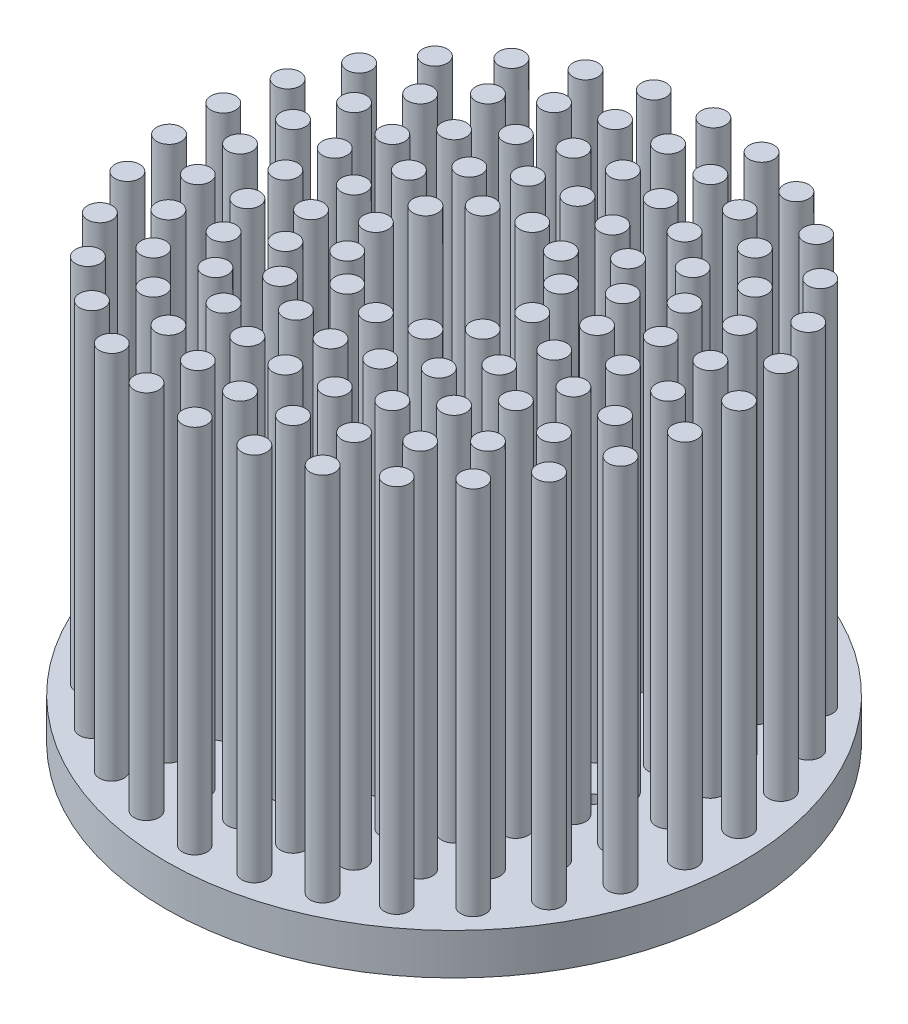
ISO-10303-21;
HEADER;
FILE_DESCRIPTION(('STEP AP214'),'2;1');
FILE_NAME('part.step','',(''),(''),'','','');
FILE_SCHEMA(('AUTOMOTIVE_DESIGN { 1 0 10303 214 1 1 1 1 }'));
ENDSEC;
DATA;
#1=APPLICATION_CONTEXT('core data for automotive mechanical design processes');
#2=APPLICATION_PROTOCOL_DEFINITION('international standard','automotive_design',2000,#1);
#3=PRODUCT_CONTEXT('',#1,'mechanical');
#4=PRODUCT('Part','Part','',(#3));
#5=PRODUCT_RELATED_PRODUCT_CATEGORY('part','',(#4));
#6=PRODUCT_DEFINITION_FORMATION('','',#4);
#7=PRODUCT_DEFINITION_CONTEXT('part definition',#1,'design');
#8=PRODUCT_DEFINITION('design','',#6,#7);
#9=PRODUCT_DEFINITION_SHAPE('','',#8);
#10=(LENGTH_UNIT() NAMED_UNIT(*) SI_UNIT(.MILLI.,.METRE.));
#11=(NAMED_UNIT(*) PLANE_ANGLE_UNIT() SI_UNIT($,.RADIAN.));
#12=(NAMED_UNIT(*) SI_UNIT($,.STERADIAN.) SOLID_ANGLE_UNIT());
#13=UNCERTAINTY_MEASURE_WITH_UNIT(LENGTH_MEASURE(1.E-05),#10,'distance_accuracy_value','');
#14=(GEOMETRIC_REPRESENTATION_CONTEXT(3) GLOBAL_UNCERTAINTY_ASSIGNED_CONTEXT((#13)) GLOBAL_UNIT_ASSIGNED_CONTEXT((#10,
#11,#12)) REPRESENTATION_CONTEXT('',''));
#15=CARTESIAN_POINT('',(0.,0.,0.));
#16=DIRECTION('',(0.,0.,1.));
#17=DIRECTION('',(1.,0.,0.));
#18=AXIS2_PLACEMENT_3D('',#15,#16,#17);
#19=CARTESIAN_POINT('',(-12.8122042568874,34.2426406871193,-28.7766819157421));
#20=DIRECTION('',(0.,-1.,0.));
#21=DIRECTION('',(0.,0.,-1.));
#22=AXIS2_PLACEMENT_3D('',#19,#20,#21);
#23=CYLINDRICAL_SURFACE('',#22,1.5);
#24=CARTESIAN_POINT('',(-12.8122042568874,5.,-28.7766819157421));
#25=DIRECTION('',(0.,1.,0.));
#26=DIRECTION('',(0.,0.,1.));
#27=AXIS2_PLACEMENT_3D('',#24,#25,#26);
#28=CIRCLE('',#27,1.5);
#29=CARTESIAN_POINT('',(-12.8122042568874,5.,-27.2766819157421));
#30=VERTEX_POINT('',#29);
#31=EDGE_CURVE('E55',#30,#30,#28,.T.);
#32=ORIENTED_EDGE('',*,*,#31,.T.);
#33=EDGE_LOOP('',(#32));
#34=FACE_BOUND('',#33,.T.);
#35=CARTESIAN_POINT('',(-12.8122042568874,50.,-28.7766819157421));
#36=DIRECTION('',(0.,1.,0.));
#37=DIRECTION('',(0.,0.,1.));
#38=AXIS2_PLACEMENT_3D('',#35,#36,#37);
#39=CIRCLE('',#38,1.5);
#40=CARTESIAN_POINT('',(-12.8122042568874,50.,-27.2766819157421));
#41=VERTEX_POINT('',#40);
#42=EDGE_CURVE('E812',#41,#41,#39,.T.);
#43=ORIENTED_EDGE('',*,*,#42,.F.);
#44=EDGE_LOOP('',(#43));
#45=FACE_BOUND('',#44,.T.);
#46=ADVANCED_FACE('F35',(#34,#45),#23,.T.);
#47=CARTESIAN_POINT('',(-18.5152354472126,34.2426406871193,-25.4840353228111));
#48=DIRECTION('',(0.,-1.,0.));
#49=DIRECTION('',(0.,0.,-1.));
#50=AXIS2_PLACEMENT_3D('',#47,#48,#49);
#51=CYLINDRICAL_SURFACE('',#50,1.5);
#52=CARTESIAN_POINT('',(-18.5152354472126,5.,-25.4840353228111));
#53=DIRECTION('',(0.,1.,0.));
#54=DIRECTION('',(0.,0.,1.));
#55=AXIS2_PLACEMENT_3D('',#52,#53,#54);
#56=CIRCLE('',#55,1.5);
#57=CARTESIAN_POINT('',(-18.5152354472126,5.,-23.9840353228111));
#58=VERTEX_POINT('',#57);
#59=EDGE_CURVE('E86',#58,#58,#56,.T.);
#60=ORIENTED_EDGE('',*,*,#59,.T.);
#61=EDGE_LOOP('',(#60));
#62=FACE_BOUND('',#61,.T.);
#63=CARTESIAN_POINT('',(-18.5152354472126,50.,-25.4840353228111));
#64=DIRECTION('',(0.,1.,0.));
#65=DIRECTION('',(0.,0.,1.));
#66=AXIS2_PLACEMENT_3D('',#63,#64,#65);
#67=CIRCLE('',#66,1.5);
#68=CARTESIAN_POINT('',(-18.5152354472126,50.,-23.9840353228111));
#69=VERTEX_POINT('',#68);
#70=EDGE_CURVE('E809',#69,#69,#67,.T.);
#71=ORIENTED_EDGE('',*,*,#70,.F.);
#72=EDGE_LOOP('',(#71));
#73=FACE_BOUND('',#72,.T.);
#74=ADVANCED_FACE('F959',(#62,#73),#51,.T.);
#75=CARTESIAN_POINT('',(-23.4090620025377,34.2426406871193,-21.0776141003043));
#76=DIRECTION('',(0.,-1.,0.));
#77=DIRECTION('',(0.,0.,-1.));
#78=AXIS2_PLACEMENT_3D('',#75,#76,#77);
#79=CYLINDRICAL_SURFACE('',#78,1.5);
#80=CARTESIAN_POINT('',(-23.4090620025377,5.,-21.0776141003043));
#81=DIRECTION('',(0.,1.,0.));
#82=DIRECTION('',(0.,0.,1.));
#83=AXIS2_PLACEMENT_3D('',#80,#81,#82);
#84=CIRCLE('',#83,1.5);
#85=CARTESIAN_POINT('',(-23.4090620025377,5.,-19.5776141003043));
#86=VERTEX_POINT('',#85);
#87=EDGE_CURVE('E89',#86,#86,#84,.T.);
#88=ORIENTED_EDGE('',*,*,#87,.T.);
#89=EDGE_LOOP('',(#88));
#90=FACE_BOUND('',#89,.T.);
#91=CARTESIAN_POINT('',(-23.4090620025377,50.,-21.0776141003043));
#92=DIRECTION('',(0.,1.,0.));
#93=DIRECTION('',(0.,0.,1.));
#94=AXIS2_PLACEMENT_3D('',#91,#92,#93);
#95=CIRCLE('',#94,1.5);
#96=CARTESIAN_POINT('',(-23.4090620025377,50.,-19.5776141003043));
#97=VERTEX_POINT('',#96);
#98=EDGE_CURVE('E797',#97,#97,#95,.T.);
#99=ORIENTED_EDGE('',*,*,#98,.F.);
#100=EDGE_LOOP('',(#99));
#101=FACE_BOUND('',#100,.T.);
#102=ADVANCED_FACE('F965',(#90,#101),#79,.T.);
#103=CARTESIAN_POINT('',(-27.2798002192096,34.2426406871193,-15.7500000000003));
#104=DIRECTION('',(0.,-1.,0.));
#105=DIRECTION('',(0.,0.,-1.));
#106=AXIS2_PLACEMENT_3D('',#103,#104,#105);
#107=CYLINDRICAL_SURFACE('',#106,1.5);
#108=CARTESIAN_POINT('',(-27.2798002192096,5.,-15.7500000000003));
#109=DIRECTION('',(0.,1.,0.));
#110=DIRECTION('',(0.,0.,1.));
#111=AXIS2_PLACEMENT_3D('',#108,#109,#110);
#112=CIRCLE('',#111,1.5);
#113=CARTESIAN_POINT('',(-27.2798002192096,5.,-14.2500000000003));
#114=VERTEX_POINT('',#113);
#115=EDGE_CURVE('E92',#114,#114,#112,.T.);
#116=ORIENTED_EDGE('',*,*,#115,.T.);
#117=EDGE_LOOP('',(#116));
#118=FACE_BOUND('',#117,.T.);
#119=CARTESIAN_POINT('',(-27.2798002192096,50.,-15.7500000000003));
#120=DIRECTION('',(0.,1.,0.));
#121=DIRECTION('',(0.,0.,1.));
#122=AXIS2_PLACEMENT_3D('',#119,#120,#121);
#123=CIRCLE('',#122,1.5);
#124=CARTESIAN_POINT('',(-27.2798002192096,50.,-14.2500000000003));
#125=VERTEX_POINT('',#124);
#126=EDGE_CURVE('E794',#125,#125,#123,.T.);
#127=ORIENTED_EDGE('',*,*,#126,.F.);
#128=EDGE_LOOP('',(#127));
#129=FACE_BOUND('',#128,.T.);
#130=ADVANCED_FACE('F973',(#118,#129),#107,.T.);
#131=CARTESIAN_POINT('',(-29.9582802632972,34.2426406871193,-9.73403532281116));
#132=DIRECTION('',(0.,-1.,0.));
#133=DIRECTION('',(0.,0.,-1.));
#134=AXIS2_PLACEMENT_3D('',#131,#132,#133);
#135=CYLINDRICAL_SURFACE('',#134,1.5);
#136=CARTESIAN_POINT('',(-29.9582802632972,5.,-9.73403532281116));
#137=DIRECTION('',(0.,1.,0.));
#138=DIRECTION('',(0.,0.,1.));
#139=AXIS2_PLACEMENT_3D('',#136,#137,#138);
#140=CIRCLE('',#139,1.5);
#141=CARTESIAN_POINT('',(-29.9582802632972,5.,-8.23403532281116));
#142=VERTEX_POINT('',#141);
#143=EDGE_CURVE('E95',#142,#142,#140,.T.);
#144=ORIENTED_EDGE('',*,*,#143,.T.);
#145=EDGE_LOOP('',(#144));
#146=FACE_BOUND('',#145,.T.);
#147=CARTESIAN_POINT('',(-29.9582802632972,50.,-9.73403532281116));
#148=DIRECTION('',(0.,1.,0.));
#149=DIRECTION('',(0.,0.,1.));
#150=AXIS2_PLACEMENT_3D('',#147,#148,#149);
#151=CIRCLE('',#150,1.5);
#152=CARTESIAN_POINT('',(-29.9582802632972,50.,-8.23403532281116));
#153=VERTEX_POINT('',#152);
#154=EDGE_CURVE('E776',#153,#153,#151,.T.);
#155=ORIENTED_EDGE('',*,*,#154,.F.);
#156=EDGE_LOOP('',(#155));
#157=FACE_BOUND('',#156,.T.);
#158=ADVANCED_FACE('F977',(#146,#157),#135,.T.);
#159=CARTESIAN_POINT('',(-31.3274397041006,34.2426406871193,-3.2926465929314));
#160=DIRECTION('',(0.,-1.,0.));
#161=DIRECTION('',(0.,0.,-1.));
#162=AXIS2_PLACEMENT_3D('',#159,#160,#161);
#163=CYLINDRICAL_SURFACE('',#162,1.5);
#164=CARTESIAN_POINT('',(-31.3274397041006,5.,-3.2926465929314));
#165=DIRECTION('',(0.,1.,0.));
#166=DIRECTION('',(0.,0.,1.));
#167=AXIS2_PLACEMENT_3D('',#164,#165,#166);
#168=CIRCLE('',#167,1.5);
#169=CARTESIAN_POINT('',(-31.3274397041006,5.,-1.7926465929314));
#170=VERTEX_POINT('',#169);
#171=EDGE_CURVE('E98',#170,#170,#168,.T.);
#172=ORIENTED_EDGE('',*,*,#171,.T.);
#173=EDGE_LOOP('',(#172));
#174=FACE_BOUND('',#173,.T.);
#175=CARTESIAN_POINT('',(-31.3274397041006,50.,-3.2926465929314));
#176=DIRECTION('',(0.,1.,0.));
#177=DIRECTION('',(0.,0.,1.));
#178=AXIS2_PLACEMENT_3D('',#175,#176,#177);
#179=CIRCLE('',#178,1.5);
#180=CARTESIAN_POINT('',(-31.3274397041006,50.,-1.7926465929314));
#181=VERTEX_POINT('',#180);
#182=EDGE_CURVE('E773',#181,#181,#179,.T.);
#183=ORIENTED_EDGE('',*,*,#182,.F.);
#184=EDGE_LOOP('',(#183));
#185=FACE_BOUND('',#184,.T.);
#186=ADVANCED_FACE('F981',(#174,#185),#163,.T.);
#187=CARTESIAN_POINT('',(-31.3274397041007,34.2426406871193,3.29264659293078));
#188=DIRECTION('',(0.,-1.,0.));
#189=DIRECTION('',(0.,0.,-1.));
#190=AXIS2_PLACEMENT_3D('',#187,#188,#189);
#191=CYLINDRICAL_SURFACE('',#190,1.5);
#192=CARTESIAN_POINT('',(-31.3274397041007,5.,3.29264659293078));
#193=DIRECTION('',(0.,1.,0.));
#194=DIRECTION('',(0.,0.,1.));
#195=AXIS2_PLACEMENT_3D('',#192,#193,#194);
#196=CIRCLE('',#195,1.5);
#197=CARTESIAN_POINT('',(-31.3274397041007,5.,4.79264659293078));
#198=VERTEX_POINT('',#197);
#199=EDGE_CURVE('E101',#198,#198,#196,.T.);
#200=ORIENTED_EDGE('',*,*,#199,.T.);
#201=EDGE_LOOP('',(#200));
#202=FACE_BOUND('',#201,.T.);
#203=CARTESIAN_POINT('',(-31.3274397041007,50.,3.29264659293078));
#204=DIRECTION('',(0.,1.,0.));
#205=DIRECTION('',(0.,0.,1.));
#206=AXIS2_PLACEMENT_3D('',#203,#204,#205);
#207=CIRCLE('',#206,1.5);
#208=CARTESIAN_POINT('',(-31.3274397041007,50.,4.79264659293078));
#209=VERTEX_POINT('',#208);
#210=EDGE_CURVE('E770',#209,#209,#207,.T.);
#211=ORIENTED_EDGE('',*,*,#210,.F.);
#212=EDGE_LOOP('',(#211));
#213=FACE_BOUND('',#212,.T.);
#214=ADVANCED_FACE('F985',(#202,#213),#191,.T.);
#215=CARTESIAN_POINT('',(-29.9582802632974,34.2426406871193,9.73403532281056));
#216=DIRECTION('',(0.,-1.,0.));
#217=DIRECTION('',(0.,0.,-1.));
#218=AXIS2_PLACEMENT_3D('',#215,#216,#217);
#219=CYLINDRICAL_SURFACE('',#218,1.5);
#220=CARTESIAN_POINT('',(-29.9582802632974,5.,9.73403532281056));
#221=DIRECTION('',(0.,1.,0.));
#222=DIRECTION('',(0.,0.,1.));
#223=AXIS2_PLACEMENT_3D('',#220,#221,#222);
#224=CIRCLE('',#223,1.5);
#225=CARTESIAN_POINT('',(-29.9582802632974,5.,11.2340353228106));
#226=VERTEX_POINT('',#225);
#227=EDGE_CURVE('E104',#226,#226,#224,.T.);
#228=ORIENTED_EDGE('',*,*,#227,.T.);
#229=EDGE_LOOP('',(#228));
#230=FACE_BOUND('',#229,.T.);
#231=CARTESIAN_POINT('',(-29.9582802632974,50.,9.73403532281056));
#232=DIRECTION('',(0.,1.,0.));
#233=DIRECTION('',(0.,0.,1.));
#234=AXIS2_PLACEMENT_3D('',#231,#232,#233);
#235=CIRCLE('',#234,1.5);
#236=CARTESIAN_POINT('',(-29.9582802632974,50.,11.2340353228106));
#237=VERTEX_POINT('',#236);
#238=EDGE_CURVE('E767',#237,#237,#235,.T.);
#239=ORIENTED_EDGE('',*,*,#238,.F.);
#240=EDGE_LOOP('',(#239));
#241=FACE_BOUND('',#240,.T.);
#242=ADVANCED_FACE('F989',(#230,#241),#219,.T.);
#243=CARTESIAN_POINT('',(-27.27980021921,34.2426406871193,15.7499999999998));
#244=DIRECTION('',(0.,-1.,0.));
#245=DIRECTION('',(0.,0.,-1.));
#246=AXIS2_PLACEMENT_3D('',#243,#244,#245);
#247=CYLINDRICAL_SURFACE('',#246,1.5);
#248=CARTESIAN_POINT('',(-27.27980021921,5.,15.7499999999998));
#249=DIRECTION('',(0.,1.,0.));
#250=DIRECTION('',(0.,0.,1.));
#251=AXIS2_PLACEMENT_3D('',#248,#249,#250);
#252=CIRCLE('',#251,1.5);
#253=CARTESIAN_POINT('',(-27.27980021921,5.,17.2499999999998));
#254=VERTEX_POINT('',#253);
#255=EDGE_CURVE('E107',#254,#254,#252,.T.);
#256=ORIENTED_EDGE('',*,*,#255,.T.);
#257=EDGE_LOOP('',(#256));
#258=FACE_BOUND('',#257,.T.);
#259=CARTESIAN_POINT('',(-27.27980021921,50.,15.7499999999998));
#260=DIRECTION('',(0.,1.,0.));
#261=DIRECTION('',(0.,0.,1.));
#262=AXIS2_PLACEMENT_3D('',#259,#260,#261);
#263=CIRCLE('',#262,1.5);
#264=CARTESIAN_POINT('',(-27.27980021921,50.,17.2499999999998));
#265=VERTEX_POINT('',#264);
#266=EDGE_CURVE('E3383',#265,#265,#263,.T.);
#267=ORIENTED_EDGE('',*,*,#266,.F.);
#268=EDGE_LOOP('',(#267));
#269=FACE_BOUND('',#268,.T.);
#270=ADVANCED_FACE('F993',(#258,#269),#247,.T.);
#271=CARTESIAN_POINT('',(-23.4090620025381,34.2426406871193,21.0776141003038));
#272=DIRECTION('',(0.,-1.,0.));
#273=DIRECTION('',(0.,0.,-1.));
#274=AXIS2_PLACEMENT_3D('',#271,#272,#273);
#275=CYLINDRICAL_SURFACE('',#274,1.5);
#276=CARTESIAN_POINT('',(-23.4090620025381,5.,21.0776141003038));
#277=DIRECTION('',(0.,1.,0.));
#278=DIRECTION('',(0.,0.,1.));
#279=AXIS2_PLACEMENT_3D('',#276,#277,#278);
#280=CIRCLE('',#279,1.5);
#281=CARTESIAN_POINT('',(-23.4090620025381,5.,22.5776141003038));
#282=VERTEX_POINT('',#281);
#283=EDGE_CURVE('E110',#282,#282,#280,.T.);
#284=ORIENTED_EDGE('',*,*,#283,.T.);
#285=EDGE_LOOP('',(#284));
#286=FACE_BOUND('',#285,.T.);
#287=CARTESIAN_POINT('',(-23.4090620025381,50.,21.0776141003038));
#288=DIRECTION('',(0.,1.,0.));
#289=DIRECTION('',(0.,0.,1.));
#290=AXIS2_PLACEMENT_3D('',#287,#288,#289);
#291=CIRCLE('',#290,1.5);
#292=CARTESIAN_POINT('',(-23.4090620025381,50.,22.5776141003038));
#293=VERTEX_POINT('',#292);
#294=EDGE_CURVE('E752',#293,#293,#291,.T.);
#295=ORIENTED_EDGE('',*,*,#294,.F.);
#296=EDGE_LOOP('',(#295));
#297=FACE_BOUND('',#296,.T.);
#298=ADVANCED_FACE('F997',(#286,#297),#275,.T.);
#299=CARTESIAN_POINT('',(-18.5152354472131,34.2426406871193,25.4840353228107));
#300=DIRECTION('',(0.,-1.,0.));
#301=DIRECTION('',(0.,0.,-1.));
#302=AXIS2_PLACEMENT_3D('',#299,#300,#301);
#303=CYLINDRICAL_SURFACE('',#302,1.5);
#304=CARTESIAN_POINT('',(-18.5152354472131,5.,25.4840353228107));
#305=DIRECTION('',(0.,1.,0.));
#306=DIRECTION('',(0.,0.,1.));
#307=AXIS2_PLACEMENT_3D('',#304,#305,#306);
#308=CIRCLE('',#307,1.5);
#309=CARTESIAN_POINT('',(-18.5152354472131,5.,26.9840353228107));
#310=VERTEX_POINT('',#309);
#311=EDGE_CURVE('E113',#310,#310,#308,.T.);
#312=ORIENTED_EDGE('',*,*,#311,.T.);
#313=EDGE_LOOP('',(#312));
#314=FACE_BOUND('',#313,.T.);
#315=CARTESIAN_POINT('',(-18.5152354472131,50.,25.4840353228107));
#316=DIRECTION('',(0.,1.,0.));
#317=DIRECTION('',(0.,0.,1.));
#318=AXIS2_PLACEMENT_3D('',#315,#316,#317);
#319=CIRCLE('',#318,1.5);
#320=CARTESIAN_POINT('',(-18.5152354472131,50.,26.9840353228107));
#321=VERTEX_POINT('',#320);
#322=EDGE_CURVE('E749',#321,#321,#319,.T.);
#323=ORIENTED_EDGE('',*,*,#322,.F.);
#324=EDGE_LOOP('',(#323));
#325=FACE_BOUND('',#324,.T.);
#326=ADVANCED_FACE('F1001',(#314,#325),#303,.T.);
#327=CARTESIAN_POINT('',(-12.8122042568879,34.2426406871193,28.7766819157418));
#328=DIRECTION('',(0.,-1.,0.));
#329=DIRECTION('',(0.,0.,-1.));
#330=AXIS2_PLACEMENT_3D('',#327,#328,#329);
#331=CYLINDRICAL_SURFACE('',#330,1.5);
#332=CARTESIAN_POINT('',(-12.8122042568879,5.,28.7766819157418));
#333=DIRECTION('',(0.,1.,0.));
#334=DIRECTION('',(0.,0.,1.));
#335=AXIS2_PLACEMENT_3D('',#332,#333,#334);
#336=CIRCLE('',#335,1.5);
#337=CARTESIAN_POINT('',(-12.8122042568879,5.,30.2766819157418));
#338=VERTEX_POINT('',#337);
#339=EDGE_CURVE('E116',#338,#338,#336,.T.);
#340=ORIENTED_EDGE('',*,*,#339,.T.);
#341=EDGE_LOOP('',(#340));
#342=FACE_BOUND('',#341,.T.);
#343=CARTESIAN_POINT('',(-12.8122042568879,50.,28.7766819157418));
#344=DIRECTION('',(0.,1.,0.));
#345=DIRECTION('',(0.,0.,1.));
#346=AXIS2_PLACEMENT_3D('',#343,#344,#345);
#347=CIRCLE('',#346,1.5);
#348=CARTESIAN_POINT('',(-12.8122042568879,50.,30.2766819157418));
#349=VERTEX_POINT('',#348);
#350=EDGE_CURVE('E689',#349,#349,#347,.T.);
#351=ORIENTED_EDGE('',*,*,#350,.F.);
#352=EDGE_LOOP('',(#351));
#353=FACE_BOUND('',#352,.T.);
#354=ADVANCED_FACE('F1005',(#342,#353),#331,.T.);
#355=CARTESIAN_POINT('',(-6.54921826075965,34.2426406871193,30.8116494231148));
#356=DIRECTION('',(0.,-1.,0.));
#357=DIRECTION('',(0.,0.,-1.));
#358=AXIS2_PLACEMENT_3D('',#355,#356,#357);
#359=CYLINDRICAL_SURFACE('',#358,1.5);
#360=CARTESIAN_POINT('',(-6.54921826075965,5.,30.8116494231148));
#361=DIRECTION('',(0.,1.,0.));
#362=DIRECTION('',(0.,0.,1.));
#363=AXIS2_PLACEMENT_3D('',#360,#361,#362);
#364=CIRCLE('',#363,1.5);
#365=CARTESIAN_POINT('',(-6.54921826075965,5.,32.3116494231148));
#366=VERTEX_POINT('',#365);
#367=EDGE_CURVE('E119',#366,#366,#364,.T.);
#368=ORIENTED_EDGE('',*,*,#367,.T.);
#369=EDGE_LOOP('',(#368));
#370=FACE_BOUND('',#369,.T.);
#371=CARTESIAN_POINT('',(-6.54921826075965,50.,30.8116494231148));
#372=DIRECTION('',(0.,1.,0.));
#373=DIRECTION('',(0.,0.,1.));
#374=AXIS2_PLACEMENT_3D('',#371,#372,#373);
#375=CIRCLE('',#374,1.5);
#376=CARTESIAN_POINT('',(-6.54921826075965,50.,32.3116494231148));
#377=VERTEX_POINT('',#376);
#378=EDGE_CURVE('E683',#377,#377,#375,.T.);
#379=ORIENTED_EDGE('',*,*,#378,.F.);
#380=EDGE_LOOP('',(#379));
#381=FACE_BOUND('',#380,.T.);
#382=ADVANCED_FACE('F1009',(#370,#381),#359,.T.);
#383=CARTESIAN_POINT('',(0.,34.2426406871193,31.5));
#384=DIRECTION('',(0.,-1.,0.));
#385=DIRECTION('',(0.,0.,-1.));
#386=AXIS2_PLACEMENT_3D('',#383,#384,#385);
#387=CYLINDRICAL_SURFACE('',#386,1.5);
#388=CARTESIAN_POINT('',(0.,5.,31.5));
#389=DIRECTION('',(0.,1.,0.));
#390=DIRECTION('',(0.,0.,1.));
#391=AXIS2_PLACEMENT_3D('',#388,#389,#390);
#392=CIRCLE('',#391,1.5);
#393=CARTESIAN_POINT('',(0.,5.,33.));
#394=VERTEX_POINT('',#393);
#395=EDGE_CURVE('E122',#394,#394,#392,.T.);
#396=ORIENTED_EDGE('',*,*,#395,.T.);
#397=EDGE_LOOP('',(#396));
#398=FACE_BOUND('',#397,.T.);
#399=CARTESIAN_POINT('',(0.,50.,31.5));
#400=DIRECTION('',(0.,1.,0.));
#401=DIRECTION('',(0.,0.,1.));
#402=AXIS2_PLACEMENT_3D('',#399,#400,#401);
#403=CIRCLE('',#402,1.5);
#404=CARTESIAN_POINT('',(0.,50.,33.));
#405=VERTEX_POINT('',#404);
#406=EDGE_CURVE('E680',#405,#405,#403,.T.);
#407=ORIENTED_EDGE('',*,*,#406,.F.);
#408=EDGE_LOOP('',(#407));
#409=FACE_BOUND('',#408,.T.);
#410=ADVANCED_FACE('F1013',(#398,#409),#387,.T.);
#411=CARTESIAN_POINT('',(6.54921826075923,34.2426406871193,30.8116494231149));
#412=DIRECTION('',(0.,-1.,0.));
#413=DIRECTION('',(0.,0.,-1.));
#414=AXIS2_PLACEMENT_3D('',#411,#412,#413);
#415=CYLINDRICAL_SURFACE('',#414,1.5);
#416=CARTESIAN_POINT('',(6.54921826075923,5.,30.8116494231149));
#417=DIRECTION('',(0.,1.,0.));
#418=DIRECTION('',(0.,0.,1.));
#419=AXIS2_PLACEMENT_3D('',#416,#417,#418);
#420=CIRCLE('',#419,1.5);
#421=CARTESIAN_POINT('',(6.54921826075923,5.,32.3116494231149));
#422=VERTEX_POINT('',#421);
#423=EDGE_CURVE('E125',#422,#422,#420,.T.);
#424=ORIENTED_EDGE('',*,*,#423,.T.);
#425=EDGE_LOOP('',(#424));
#426=FACE_BOUND('',#425,.T.);
#427=CARTESIAN_POINT('',(6.54921826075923,50.,30.8116494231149));
#428=DIRECTION('',(0.,1.,0.));
#429=DIRECTION('',(0.,0.,1.));
#430=AXIS2_PLACEMENT_3D('',#427,#428,#429);
#431=CIRCLE('',#430,1.5);
#432=CARTESIAN_POINT('',(6.54921826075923,50.,32.3116494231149));
#433=VERTEX_POINT('',#432);
#434=EDGE_CURVE('E671',#433,#433,#431,.T.);
#435=ORIENTED_EDGE('',*,*,#434,.F.);
#436=EDGE_LOOP('',(#435));
#437=FACE_BOUND('',#436,.T.);
#438=ADVANCED_FACE('F1017',(#426,#437),#415,.T.);
#439=CARTESIAN_POINT('',(12.8122042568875,34.2426406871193,28.776681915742));
#440=DIRECTION('',(0.,-1.,0.));
#441=DIRECTION('',(0.,0.,-1.));
#442=AXIS2_PLACEMENT_3D('',#439,#440,#441);
#443=CYLINDRICAL_SURFACE('',#442,1.5);
#444=CARTESIAN_POINT('',(12.8122042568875,5.,28.776681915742));
#445=DIRECTION('',(0.,1.,0.));
#446=DIRECTION('',(0.,0.,1.));
#447=AXIS2_PLACEMENT_3D('',#444,#445,#446);
#448=CIRCLE('',#447,1.5);
#449=CARTESIAN_POINT('',(12.8122042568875,5.,30.276681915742));
#450=VERTEX_POINT('',#449);
#451=EDGE_CURVE('E128',#450,#450,#448,.T.);
#452=ORIENTED_EDGE('',*,*,#451,.T.);
#453=EDGE_LOOP('',(#452));
#454=FACE_BOUND('',#453,.T.);
#455=CARTESIAN_POINT('',(12.8122042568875,50.,28.776681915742));
#456=DIRECTION('',(0.,1.,0.));
#457=DIRECTION('',(0.,0.,1.));
#458=AXIS2_PLACEMENT_3D('',#455,#456,#457);
#459=CIRCLE('',#458,1.5);
#460=CARTESIAN_POINT('',(12.8122042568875,50.,30.276681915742));
#461=VERTEX_POINT('',#460);
#462=EDGE_CURVE('E3370',#461,#461,#459,.T.);
#463=ORIENTED_EDGE('',*,*,#462,.F.);
#464=EDGE_LOOP('',(#463));
#465=FACE_BOUND('',#464,.T.);
#466=ADVANCED_FACE('F1021',(#454,#465),#443,.T.);
#467=CARTESIAN_POINT('',(18.5152354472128,34.2426406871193,25.4840353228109));
#468=DIRECTION('',(0.,-1.,0.));
#469=DIRECTION('',(0.,0.,-1.));
#470=AXIS2_PLACEMENT_3D('',#467,#468,#469);
#471=CYLINDRICAL_SURFACE('',#470,1.5);
#472=CARTESIAN_POINT('',(18.5152354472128,5.,25.4840353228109));
#473=DIRECTION('',(0.,1.,0.));
#474=DIRECTION('',(0.,0.,1.));
#475=AXIS2_PLACEMENT_3D('',#472,#473,#474);
#476=CIRCLE('',#475,1.5);
#477=CARTESIAN_POINT('',(18.5152354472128,5.,26.9840353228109));
#478=VERTEX_POINT('',#477);
#479=EDGE_CURVE('E131',#478,#478,#476,.T.);
#480=ORIENTED_EDGE('',*,*,#479,.T.);
#481=EDGE_LOOP('',(#480));
#482=FACE_BOUND('',#481,.T.);
#483=CARTESIAN_POINT('',(18.5152354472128,50.,25.4840353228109));
#484=DIRECTION('',(0.,1.,0.));
#485=DIRECTION('',(0.,0.,1.));
#486=AXIS2_PLACEMENT_3D('',#483,#484,#485);
#487=CIRCLE('',#486,1.5);
#488=CARTESIAN_POINT('',(18.5152354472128,50.,26.9840353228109));
#489=VERTEX_POINT('',#488);
#490=EDGE_CURVE('E655',#489,#489,#487,.T.);
#491=ORIENTED_EDGE('',*,*,#490,.F.);
#492=EDGE_LOOP('',(#491));
#493=FACE_BOUND('',#492,.T.);
#494=ADVANCED_FACE('F1025',(#482,#493),#471,.T.);
#495=CARTESIAN_POINT('',(23.4090620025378,34.2426406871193,21.0776141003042));
#496=DIRECTION('',(0.,-1.,0.));
#497=DIRECTION('',(0.,0.,-1.));
#498=AXIS2_PLACEMENT_3D('',#495,#496,#497);
#499=CYLINDRICAL_SURFACE('',#498,1.5);
#500=CARTESIAN_POINT('',(23.4090620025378,5.,21.0776141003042));
#501=DIRECTION('',(0.,1.,0.));
#502=DIRECTION('',(0.,0.,1.));
#503=AXIS2_PLACEMENT_3D('',#500,#501,#502);
#504=CIRCLE('',#503,1.5);
#505=CARTESIAN_POINT('',(23.4090620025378,5.,22.5776141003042));
#506=VERTEX_POINT('',#505);
#507=EDGE_CURVE('E134',#506,#506,#504,.T.);
#508=ORIENTED_EDGE('',*,*,#507,.T.);
#509=EDGE_LOOP('',(#508));
#510=FACE_BOUND('',#509,.T.);
#511=CARTESIAN_POINT('',(23.4090620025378,50.,21.0776141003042));
#512=DIRECTION('',(0.,1.,0.));
#513=DIRECTION('',(0.,0.,1.));
#514=AXIS2_PLACEMENT_3D('',#511,#512,#513);
#515=CIRCLE('',#514,1.5);
#516=CARTESIAN_POINT('',(23.4090620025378,50.,22.5776141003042));
#517=VERTEX_POINT('',#516);
#518=EDGE_CURVE('E713',#517,#517,#515,.T.);
#519=ORIENTED_EDGE('',*,*,#518,.F.);
#520=EDGE_LOOP('',(#519));
#521=FACE_BOUND('',#520,.T.);
#522=ADVANCED_FACE('F1029',(#510,#521),#499,.T.);
#523=CARTESIAN_POINT('',(27.2798002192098,34.2426406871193,15.7500000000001));
#524=DIRECTION('',(0.,-1.,0.));
#525=DIRECTION('',(0.,0.,-1.));
#526=AXIS2_PLACEMENT_3D('',#523,#524,#525);
#527=CYLINDRICAL_SURFACE('',#526,1.5);
#528=CARTESIAN_POINT('',(27.2798002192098,5.,15.7500000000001));
#529=DIRECTION('',(0.,1.,0.));
#530=DIRECTION('',(0.,0.,1.));
#531=AXIS2_PLACEMENT_3D('',#528,#529,#530);
#532=CIRCLE('',#531,1.5);
#533=CARTESIAN_POINT('',(27.2798002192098,5.,17.2500000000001));
#534=VERTEX_POINT('',#533);
#535=EDGE_CURVE('E137',#534,#534,#532,.T.);
#536=ORIENTED_EDGE('',*,*,#535,.T.);
#537=EDGE_LOOP('',(#536));
#538=FACE_BOUND('',#537,.T.);
#539=CARTESIAN_POINT('',(27.2798002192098,50.,15.7500000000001));
#540=DIRECTION('',(0.,1.,0.));
#541=DIRECTION('',(0.,0.,1.));
#542=AXIS2_PLACEMENT_3D('',#539,#540,#541);
#543=CIRCLE('',#542,1.5);
#544=CARTESIAN_POINT('',(27.2798002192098,50.,17.2500000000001));
#545=VERTEX_POINT('',#544);
#546=EDGE_CURVE('E3372',#545,#545,#543,.T.);
#547=ORIENTED_EDGE('',*,*,#546,.F.);
#548=EDGE_LOOP('',(#547));
#549=FACE_BOUND('',#548,.T.);
#550=ADVANCED_FACE('F1033',(#538,#549),#527,.T.);
#551=CARTESIAN_POINT('',(29.9582802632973,34.2426406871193,9.73403532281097));
#552=DIRECTION('',(0.,-1.,0.));
#553=DIRECTION('',(0.,0.,-1.));
#554=AXIS2_PLACEMENT_3D('',#551,#552,#553);
#555=CYLINDRICAL_SURFACE('',#554,1.5);
#556=CARTESIAN_POINT('',(29.9582802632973,5.,9.73403532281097));
#557=DIRECTION('',(0.,1.,0.));
#558=DIRECTION('',(0.,0.,1.));
#559=AXIS2_PLACEMENT_3D('',#556,#557,#558);
#560=CIRCLE('',#559,1.5);
#561=CARTESIAN_POINT('',(29.9582802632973,5.,11.234035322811));
#562=VERTEX_POINT('',#561);
#563=EDGE_CURVE('E140',#562,#562,#560,.T.);
#564=ORIENTED_EDGE('',*,*,#563,.T.);
#565=EDGE_LOOP('',(#564));
#566=FACE_BOUND('',#565,.T.);
#567=CARTESIAN_POINT('',(29.9582802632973,50.,9.73403532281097));
#568=DIRECTION('',(0.,1.,0.));
#569=DIRECTION('',(0.,0.,1.));
#570=AXIS2_PLACEMENT_3D('',#567,#568,#569);
#571=CIRCLE('',#570,1.5);
#572=CARTESIAN_POINT('',(29.9582802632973,50.,11.234035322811));
#573=VERTEX_POINT('',#572);
#574=EDGE_CURVE('E716',#573,#573,#571,.T.);
#575=ORIENTED_EDGE('',*,*,#574,.F.);
#576=EDGE_LOOP('',(#575));
#577=FACE_BOUND('',#576,.T.);
#578=ADVANCED_FACE('F1037',(#566,#577),#555,.T.);
#579=CARTESIAN_POINT('',(31.3274397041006,34.2426406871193,3.2926465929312));
#580=DIRECTION('',(0.,-1.,0.));
#581=DIRECTION('',(0.,0.,-1.));
#582=AXIS2_PLACEMENT_3D('',#579,#580,#581);
#583=CYLINDRICAL_SURFACE('',#582,1.5);
#584=CARTESIAN_POINT('',(31.3274397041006,5.,3.2926465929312));
#585=DIRECTION('',(0.,1.,0.));
#586=DIRECTION('',(0.,0.,1.));
#587=AXIS2_PLACEMENT_3D('',#584,#585,#586);
#588=CIRCLE('',#587,1.5);
#589=CARTESIAN_POINT('',(31.3274397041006,5.,4.7926465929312));
#590=VERTEX_POINT('',#589);
#591=EDGE_CURVE('E143',#590,#590,#588,.T.);
#592=ORIENTED_EDGE('',*,*,#591,.T.);
#593=EDGE_LOOP('',(#592));
#594=FACE_BOUND('',#593,.T.);
#595=CARTESIAN_POINT('',(31.3274397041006,50.,3.2926465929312));
#596=DIRECTION('',(0.,1.,0.));
#597=DIRECTION('',(0.,0.,1.));
#598=AXIS2_PLACEMENT_3D('',#595,#596,#597);
#599=CIRCLE('',#598,1.5);
#600=CARTESIAN_POINT('',(31.3274397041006,50.,4.7926465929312));
#601=VERTEX_POINT('',#600);
#602=EDGE_CURVE('E719',#601,#601,#599,.T.);
#603=ORIENTED_EDGE('',*,*,#602,.F.);
#604=EDGE_LOOP('',(#603));
#605=FACE_BOUND('',#604,.T.);
#606=ADVANCED_FACE('F1041',(#594,#605),#583,.T.);
#607=CARTESIAN_POINT('',(31.3274397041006,34.2426406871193,-3.29264659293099));
#608=DIRECTION('',(0.,-1.,0.));
#609=DIRECTION('',(0.,0.,-1.));
#610=AXIS2_PLACEMENT_3D('',#607,#608,#609);
#611=CYLINDRICAL_SURFACE('',#610,1.5);
#612=CARTESIAN_POINT('',(31.3274397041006,5.,-3.29264659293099));
#613=DIRECTION('',(0.,1.,0.));
#614=DIRECTION('',(0.,0.,1.));
#615=AXIS2_PLACEMENT_3D('',#612,#613,#614);
#616=CIRCLE('',#615,1.5);
#617=CARTESIAN_POINT('',(31.3274397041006,5.,-1.79264659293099));
#618=VERTEX_POINT('',#617);
#619=EDGE_CURVE('E146',#618,#618,#616,.T.);
#620=ORIENTED_EDGE('',*,*,#619,.T.);
#621=EDGE_LOOP('',(#620));
#622=FACE_BOUND('',#621,.T.);
#623=CARTESIAN_POINT('',(31.3274397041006,50.,-3.29264659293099));
#624=DIRECTION('',(0.,1.,0.));
#625=DIRECTION('',(0.,0.,1.));
#626=AXIS2_PLACEMENT_3D('',#623,#624,#625);
#627=CIRCLE('',#626,1.5);
#628=CARTESIAN_POINT('',(31.3274397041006,50.,-1.79264659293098));
#629=VERTEX_POINT('',#628);
#630=EDGE_CURVE('E722',#629,#629,#627,.T.);
#631=ORIENTED_EDGE('',*,*,#630,.F.);
#632=EDGE_LOOP('',(#631));
#633=FACE_BOUND('',#632,.T.);
#634=ADVANCED_FACE('F1045',(#622,#633),#611,.T.);
#635=CARTESIAN_POINT('',(29.9582802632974,34.2426406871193,-9.73403532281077));
#636=DIRECTION('',(0.,-1.,0.));
#637=DIRECTION('',(0.,0.,-1.));
#638=AXIS2_PLACEMENT_3D('',#635,#636,#637);
#639=CYLINDRICAL_SURFACE('',#638,1.5);
#640=CARTESIAN_POINT('',(29.9582802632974,5.,-9.73403532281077));
#641=DIRECTION('',(0.,1.,0.));
#642=DIRECTION('',(0.,0.,1.));
#643=AXIS2_PLACEMENT_3D('',#640,#641,#642);
#644=CIRCLE('',#643,1.5);
#645=CARTESIAN_POINT('',(29.9582802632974,5.,-8.23403532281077));
#646=VERTEX_POINT('',#645);
#647=EDGE_CURVE('E149',#646,#646,#644,.T.);
#648=ORIENTED_EDGE('',*,*,#647,.T.);
#649=EDGE_LOOP('',(#648));
#650=FACE_BOUND('',#649,.T.);
#651=CARTESIAN_POINT('',(29.9582802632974,50.,-9.73403532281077));
#652=DIRECTION('',(0.,1.,0.));
#653=DIRECTION('',(0.,0.,1.));
#654=AXIS2_PLACEMENT_3D('',#651,#652,#653);
#655=CIRCLE('',#654,1.5);
#656=CARTESIAN_POINT('',(29.9582802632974,50.,-8.23403532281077));
#657=VERTEX_POINT('',#656);
#658=EDGE_CURVE('E725',#657,#657,#655,.T.);
#659=ORIENTED_EDGE('',*,*,#658,.F.);
#660=EDGE_LOOP('',(#659));
#661=FACE_BOUND('',#660,.T.);
#662=ADVANCED_FACE('F1049',(#650,#661),#639,.T.);
#663=CARTESIAN_POINT('',(27.2798002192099,34.2426406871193,-15.7499999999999));
#664=DIRECTION('',(0.,-1.,0.));
#665=DIRECTION('',(0.,0.,-1.));
#666=AXIS2_PLACEMENT_3D('',#663,#664,#665);
#667=CYLINDRICAL_SURFACE('',#666,1.5);
#668=CARTESIAN_POINT('',(27.2798002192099,5.,-15.7499999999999));
#669=DIRECTION('',(0.,1.,0.));
#670=DIRECTION('',(0.,0.,1.));
#671=AXIS2_PLACEMENT_3D('',#668,#669,#670);
#672=CIRCLE('',#671,1.5);
#673=CARTESIAN_POINT('',(27.2798002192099,5.,-14.2499999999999));
#674=VERTEX_POINT('',#673);
#675=EDGE_CURVE('E152',#674,#674,#672,.T.);
#676=ORIENTED_EDGE('',*,*,#675,.T.);
#677=EDGE_LOOP('',(#676));
#678=FACE_BOUND('',#677,.T.);
#679=CARTESIAN_POINT('',(27.2798002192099,50.,-15.7499999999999));
#680=DIRECTION('',(0.,1.,0.));
#681=DIRECTION('',(0.,0.,1.));
#682=AXIS2_PLACEMENT_3D('',#679,#680,#681);
#683=CIRCLE('',#682,1.5);
#684=CARTESIAN_POINT('',(27.2798002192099,50.,-14.2499999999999));
#685=VERTEX_POINT('',#684);
#686=EDGE_CURVE('E854',#685,#685,#683,.T.);
#687=ORIENTED_EDGE('',*,*,#686,.F.);
#688=EDGE_LOOP('',(#687));
#689=FACE_BOUND('',#688,.T.);
#690=ADVANCED_FACE('F1053',(#678,#689),#667,.T.);
#691=CARTESIAN_POINT('',(23.409062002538,34.2426406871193,-21.077614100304));
#692=DIRECTION('',(0.,-1.,0.));
#693=DIRECTION('',(0.,0.,-1.));
#694=AXIS2_PLACEMENT_3D('',#691,#692,#693);
#695=CYLINDRICAL_SURFACE('',#694,1.5);
#696=CARTESIAN_POINT('',(23.409062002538,5.,-21.077614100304));
#697=DIRECTION('',(0.,1.,0.));
#698=DIRECTION('',(0.,0.,1.));
#699=AXIS2_PLACEMENT_3D('',#696,#697,#698);
#700=CIRCLE('',#699,1.5);
#701=CARTESIAN_POINT('',(23.409062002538,5.,-19.577614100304));
#702=VERTEX_POINT('',#701);
#703=EDGE_CURVE('E155',#702,#702,#700,.T.);
#704=ORIENTED_EDGE('',*,*,#703,.T.);
#705=EDGE_LOOP('',(#704));
#706=FACE_BOUND('',#705,.T.);
#707=CARTESIAN_POINT('',(23.409062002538,50.,-21.077614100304));
#708=DIRECTION('',(0.,1.,0.));
#709=DIRECTION('',(0.,0.,1.));
#710=AXIS2_PLACEMENT_3D('',#707,#708,#709);
#711=CIRCLE('',#710,1.5);
#712=CARTESIAN_POINT('',(23.409062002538,50.,-19.577614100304));
#713=VERTEX_POINT('',#712);
#714=EDGE_CURVE('E842',#713,#713,#711,.T.);
#715=ORIENTED_EDGE('',*,*,#714,.F.);
#716=EDGE_LOOP('',(#715));
#717=FACE_BOUND('',#716,.T.);
#718=ADVANCED_FACE('F1057',(#706,#717),#695,.T.);
#719=CARTESIAN_POINT('',(18.5152354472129,34.2426406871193,-25.4840353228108));
#720=DIRECTION('',(0.,-1.,0.));
#721=DIRECTION('',(0.,0.,-1.));
#722=AXIS2_PLACEMENT_3D('',#719,#720,#721);
#723=CYLINDRICAL_SURFACE('',#722,1.5);
#724=CARTESIAN_POINT('',(18.5152354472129,5.,-25.4840353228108));
#725=DIRECTION('',(0.,1.,0.));
#726=DIRECTION('',(0.,0.,1.));
#727=AXIS2_PLACEMENT_3D('',#724,#725,#726);
#728=CIRCLE('',#727,1.5);
#729=CARTESIAN_POINT('',(18.5152354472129,5.,-23.9840353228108));
#730=VERTEX_POINT('',#729);
#731=EDGE_CURVE('E158',#730,#730,#728,.T.);
#732=ORIENTED_EDGE('',*,*,#731,.T.);
#733=EDGE_LOOP('',(#732));
#734=FACE_BOUND('',#733,.T.);
#735=CARTESIAN_POINT('',(18.5152354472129,50.,-25.4840353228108));
#736=DIRECTION('',(0.,1.,0.));
#737=DIRECTION('',(0.,0.,1.));
#738=AXIS2_PLACEMENT_3D('',#735,#736,#737);
#739=CIRCLE('',#738,1.5);
#740=CARTESIAN_POINT('',(18.5152354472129,50.,-23.9840353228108));
#741=VERTEX_POINT('',#740);
#742=EDGE_CURVE('E3410',#741,#741,#739,.T.);
#743=ORIENTED_EDGE('',*,*,#742,.F.);
#744=EDGE_LOOP('',(#743));
#745=FACE_BOUND('',#744,.T.);
#746=ADVANCED_FACE('F1061',(#734,#745),#723,.T.);
#747=CARTESIAN_POINT('',(12.8122042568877,34.2426406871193,-28.7766819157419));
#748=DIRECTION('',(0.,-1.,0.));
#749=DIRECTION('',(0.,0.,-1.));
#750=AXIS2_PLACEMENT_3D('',#747,#748,#749);
#751=CYLINDRICAL_SURFACE('',#750,1.5);
#752=CARTESIAN_POINT('',(12.8122042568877,5.,-28.7766819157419));
#753=DIRECTION('',(0.,1.,0.));
#754=DIRECTION('',(0.,0.,1.));
#755=AXIS2_PLACEMENT_3D('',#752,#753,#754);
#756=CIRCLE('',#755,1.5);
#757=CARTESIAN_POINT('',(12.8122042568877,5.,-27.2766819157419));
#758=VERTEX_POINT('',#757);
#759=EDGE_CURVE('E161',#758,#758,#756,.T.);
#760=ORIENTED_EDGE('',*,*,#759,.T.);
#761=EDGE_LOOP('',(#760));
#762=FACE_BOUND('',#761,.T.);
#763=CARTESIAN_POINT('',(12.8122042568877,50.,-28.7766819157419));
#764=DIRECTION('',(0.,1.,0.));
#765=DIRECTION('',(0.,0.,1.));
#766=AXIS2_PLACEMENT_3D('',#763,#764,#765);
#767=CIRCLE('',#766,1.5);
#768=CARTESIAN_POINT('',(12.8122042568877,50.,-27.2766819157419));
#769=VERTEX_POINT('',#768);
#770=EDGE_CURVE('E839',#769,#769,#767,.T.);
#771=ORIENTED_EDGE('',*,*,#770,.F.);
#772=EDGE_LOOP('',(#771));
#773=FACE_BOUND('',#772,.T.);
#774=ADVANCED_FACE('F1065',(#762,#773),#751,.T.);
#775=CARTESIAN_POINT('',(6.54921826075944,34.2426406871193,-30.8116494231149));
#776=DIRECTION('',(0.,-1.,0.));
#777=DIRECTION('',(0.,0.,-1.));
#778=AXIS2_PLACEMENT_3D('',#775,#776,#777);
#779=CYLINDRICAL_SURFACE('',#778,1.5);
#780=CARTESIAN_POINT('',(6.54921826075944,5.,-30.8116494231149));
#781=DIRECTION('',(0.,1.,0.));
#782=DIRECTION('',(0.,0.,1.));
#783=AXIS2_PLACEMENT_3D('',#780,#781,#782);
#784=CIRCLE('',#783,1.5);
#785=CARTESIAN_POINT('',(6.54921826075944,5.,-29.3116494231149));
#786=VERTEX_POINT('',#785);
#787=EDGE_CURVE('E164',#786,#786,#784,.T.);
#788=ORIENTED_EDGE('',*,*,#787,.T.);
#789=EDGE_LOOP('',(#788));
#790=FACE_BOUND('',#789,.T.);
#791=CARTESIAN_POINT('',(6.54921826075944,50.,-30.8116494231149));
#792=DIRECTION('',(0.,1.,0.));
#793=DIRECTION('',(0.,0.,1.));
#794=AXIS2_PLACEMENT_3D('',#791,#792,#793);
#795=CIRCLE('',#794,1.5);
#796=CARTESIAN_POINT('',(6.54921826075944,50.,-29.3116494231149));
#797=VERTEX_POINT('',#796);
#798=EDGE_CURVE('E836',#797,#797,#795,.T.);
#799=ORIENTED_EDGE('',*,*,#798,.F.);
#800=EDGE_LOOP('',(#799));
#801=FACE_BOUND('',#800,.T.);
#802=ADVANCED_FACE('F1069',(#790,#801),#779,.T.);
#803=CARTESIAN_POINT('',(0.,34.2426406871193,-31.5));
#804=DIRECTION('',(0.,-1.,0.));
#805=DIRECTION('',(0.,0.,-1.));
#806=AXIS2_PLACEMENT_3D('',#803,#804,#805);
#807=CYLINDRICAL_SURFACE('',#806,1.5);
#808=CARTESIAN_POINT('',(0.,5.,-31.5));
#809=DIRECTION('',(0.,1.,0.));
#810=DIRECTION('',(0.,0.,1.));
#811=AXIS2_PLACEMENT_3D('',#808,#809,#810);
#812=CIRCLE('',#811,1.5);
#813=CARTESIAN_POINT('',(0.,5.,-30.));
#814=VERTEX_POINT('',#813);
#815=EDGE_CURVE('E167',#814,#814,#812,.T.);
#816=ORIENTED_EDGE('',*,*,#815,.T.);
#817=EDGE_LOOP('',(#816));
#818=FACE_BOUND('',#817,.T.);
#819=CARTESIAN_POINT('',(0.,50.,-31.5));
#820=DIRECTION('',(0.,1.,0.));
#821=DIRECTION('',(0.,0.,1.));
#822=AXIS2_PLACEMENT_3D('',#819,#820,#821);
#823=CIRCLE('',#822,1.5);
#824=CARTESIAN_POINT('',(0.,50.,-30.));
#825=VERTEX_POINT('',#824);
#826=EDGE_CURVE('E827',#825,#825,#823,.T.);
#827=ORIENTED_EDGE('',*,*,#826,.F.);
#828=EDGE_LOOP('',(#827));
#829=FACE_BOUND('',#828,.T.);
#830=ADVANCED_FACE('F1073',(#818,#829),#807,.T.);
#831=CARTESIAN_POINT('',(-5.78554428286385,34.2426406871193,-25.3481257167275));
#832=DIRECTION('',(0.,-1.,0.));
#833=DIRECTION('',(0.,0.,-1.));
#834=AXIS2_PLACEMENT_3D('',#831,#832,#833);
#835=CYLINDRICAL_SURFACE('',#834,1.5);
#836=CARTESIAN_POINT('',(-5.78554428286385,5.,-25.3481257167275));
#837=DIRECTION('',(0.,1.,0.));
#838=DIRECTION('',(0.,0.,1.));
#839=AXIS2_PLACEMENT_3D('',#836,#837,#838);
#840=CIRCLE('',#839,1.5);
#841=CARTESIAN_POINT('',(-5.78554428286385,5.,-23.8481257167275));
#842=VERTEX_POINT('',#841);
#843=EDGE_CURVE('E170',#842,#842,#840,.T.);
#844=ORIENTED_EDGE('',*,*,#843,.T.);
#845=EDGE_LOOP('',(#844));
#846=FACE_BOUND('',#845,.T.);
#847=CARTESIAN_POINT('',(-5.78554428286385,50.,-25.3481257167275));
#848=DIRECTION('',(0.,1.,0.));
#849=DIRECTION('',(0.,0.,1.));
#850=AXIS2_PLACEMENT_3D('',#847,#848,#849);
#851=CIRCLE('',#850,1.5);
#852=CARTESIAN_POINT('',(-5.78554428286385,50.,-23.8481257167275));
#853=VERTEX_POINT('',#852);
#854=EDGE_CURVE('E3398',#853,#853,#851,.T.);
#855=ORIENTED_EDGE('',*,*,#854,.F.);
#856=EDGE_LOOP('',(#855));
#857=FACE_BOUND('',#856,.T.);
#858=ADVANCED_FACE('F1077',(#846,#857),#835,.T.);
#859=CARTESIAN_POINT('',(-11.2809772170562,34.2426406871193,-23.4251905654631));
#860=DIRECTION('',(0.,-1.,0.));
#861=DIRECTION('',(0.,0.,-1.));
#862=AXIS2_PLACEMENT_3D('',#859,#860,#861);
#863=CYLINDRICAL_SURFACE('',#862,1.5);
#864=CARTESIAN_POINT('',(-11.2809772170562,5.,-23.4251905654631));
#865=DIRECTION('',(0.,1.,0.));
#866=DIRECTION('',(0.,0.,1.));
#867=AXIS2_PLACEMENT_3D('',#864,#865,#866);
#868=CIRCLE('',#867,1.5);
#869=CARTESIAN_POINT('',(-11.2809772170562,5.,-21.9251905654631));
#870=VERTEX_POINT('',#869);
#871=EDGE_CURVE('E173',#870,#870,#868,.T.);
#872=ORIENTED_EDGE('',*,*,#871,.T.);
#873=EDGE_LOOP('',(#872));
#874=FACE_BOUND('',#873,.T.);
#875=CARTESIAN_POINT('',(-11.2809772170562,50.,-23.4251905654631));
#876=DIRECTION('',(0.,1.,0.));
#877=DIRECTION('',(0.,0.,1.));
#878=AXIS2_PLACEMENT_3D('',#875,#876,#877);
#879=CIRCLE('',#878,1.5);
#880=CARTESIAN_POINT('',(-11.2809772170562,50.,-21.9251905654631));
#881=VERTEX_POINT('',#880);
#882=EDGE_CURVE('E815',#881,#881,#879,.T.);
#883=ORIENTED_EDGE('',*,*,#882,.F.);
#884=EDGE_LOOP('',(#883));
#885=FACE_BOUND('',#884,.T.);
#886=ADVANCED_FACE('F1081',(#874,#885),#863,.T.);
#887=CARTESIAN_POINT('',(-16.2107348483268,34.2426406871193,-20.327618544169));
#888=DIRECTION('',(0.,-1.,0.));
#889=DIRECTION('',(0.,0.,-1.));
#890=AXIS2_PLACEMENT_3D('',#887,#888,#889);
#891=CYLINDRICAL_SURFACE('',#890,1.5);
#892=CARTESIAN_POINT('',(-16.2107348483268,5.,-20.327618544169));
#893=DIRECTION('',(0.,1.,0.));
#894=DIRECTION('',(0.,0.,1.));
#895=AXIS2_PLACEMENT_3D('',#892,#893,#894);
#896=CIRCLE('',#895,1.5);
#897=CARTESIAN_POINT('',(-16.2107348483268,5.,-18.827618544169));
#898=VERTEX_POINT('',#897);
#899=EDGE_CURVE('E176',#898,#898,#896,.T.);
#900=ORIENTED_EDGE('',*,*,#899,.T.);
#901=EDGE_LOOP('',(#900));
#902=FACE_BOUND('',#901,.T.);
#903=CARTESIAN_POINT('',(-16.2107348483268,50.,-20.327618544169));
#904=DIRECTION('',(0.,1.,0.));
#905=DIRECTION('',(0.,0.,1.));
#906=AXIS2_PLACEMENT_3D('',#903,#904,#905);
#907=CIRCLE('',#906,1.5);
#908=CARTESIAN_POINT('',(-16.2107348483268,50.,-18.827618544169));
#909=VERTEX_POINT('',#908);
#910=EDGE_CURVE('E806',#909,#909,#907,.T.);
#911=ORIENTED_EDGE('',*,*,#910,.F.);
#912=EDGE_LOOP('',(#911));
#913=FACE_BOUND('',#912,.T.);
#914=ADVANCED_FACE('F1085',(#902,#913),#891,.T.);
#915=CARTESIAN_POINT('',(-20.3276185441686,34.2426406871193,-16.2107348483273));
#916=DIRECTION('',(0.,-1.,0.));
#917=DIRECTION('',(0.,0.,-1.));
#918=AXIS2_PLACEMENT_3D('',#915,#916,#917);
#919=CYLINDRICAL_SURFACE('',#918,1.5);
#920=CARTESIAN_POINT('',(-20.3276185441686,5.,-16.2107348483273));
#921=DIRECTION('',(0.,1.,0.));
#922=DIRECTION('',(0.,0.,1.));
#923=AXIS2_PLACEMENT_3D('',#920,#921,#922);
#924=CIRCLE('',#923,1.5);
#925=CARTESIAN_POINT('',(-20.3276185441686,5.,-14.7107348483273));
#926=VERTEX_POINT('',#925);
#927=EDGE_CURVE('E179',#926,#926,#924,.T.);
#928=ORIENTED_EDGE('',*,*,#927,.T.);
#929=EDGE_LOOP('',(#928));
#930=FACE_BOUND('',#929,.T.);
#931=CARTESIAN_POINT('',(-20.3276185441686,50.,-16.2107348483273));
#932=DIRECTION('',(0.,1.,0.));
#933=DIRECTION('',(0.,0.,1.));
#934=AXIS2_PLACEMENT_3D('',#931,#932,#933);
#935=CIRCLE('',#934,1.5);
#936=CARTESIAN_POINT('',(-20.3276185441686,50.,-14.7107348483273));
#937=VERTEX_POINT('',#936);
#938=EDGE_CURVE('E800',#937,#937,#935,.T.);
#939=ORIENTED_EDGE('',*,*,#938,.F.);
#940=EDGE_LOOP('',(#939));
#941=FACE_BOUND('',#940,.T.);
#942=ADVANCED_FACE('F1089',(#930,#941),#919,.T.);
#943=CARTESIAN_POINT('',(-23.4251905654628,34.2426406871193,-11.2809772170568));
#944=DIRECTION('',(0.,-1.,0.));
#945=DIRECTION('',(0.,0.,-1.));
#946=AXIS2_PLACEMENT_3D('',#943,#944,#945);
#947=CYLINDRICAL_SURFACE('',#946,1.5);
#948=CARTESIAN_POINT('',(-23.4251905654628,5.,-11.2809772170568));
#949=DIRECTION('',(0.,1.,0.));
#950=DIRECTION('',(0.,0.,1.));
#951=AXIS2_PLACEMENT_3D('',#948,#949,#950);
#952=CIRCLE('',#951,1.5);
#953=CARTESIAN_POINT('',(-23.4251905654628,5.,-9.78097721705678));
#954=VERTEX_POINT('',#953);
#955=EDGE_CURVE('E182',#954,#954,#952,.T.);
#956=ORIENTED_EDGE('',*,*,#955,.T.);
#957=EDGE_LOOP('',(#956));
#958=FACE_BOUND('',#957,.T.);
#959=CARTESIAN_POINT('',(-23.4251905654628,50.,-11.2809772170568));
#960=DIRECTION('',(0.,1.,0.));
#961=DIRECTION('',(0.,0.,1.));
#962=AXIS2_PLACEMENT_3D('',#959,#960,#961);
#963=CIRCLE('',#962,1.5);
#964=CARTESIAN_POINT('',(-23.4251905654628,50.,-9.78097721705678));
#965=VERTEX_POINT('',#964);
#966=EDGE_CURVE('E791',#965,#965,#963,.T.);
#967=ORIENTED_EDGE('',*,*,#966,.F.);
#968=EDGE_LOOP('',(#967));
#969=FACE_BOUND('',#968,.T.);
#970=ADVANCED_FACE('F1093',(#958,#969),#947,.T.);
#971=CARTESIAN_POINT('',(-25.3481257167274,34.2426406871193,-5.78554428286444));
#972=DIRECTION('',(0.,-1.,0.));
#973=DIRECTION('',(0.,0.,-1.));
#974=AXIS2_PLACEMENT_3D('',#971,#972,#973);
#975=CYLINDRICAL_SURFACE('',#974,1.5);
#976=CARTESIAN_POINT('',(-25.3481257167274,5.,-5.78554428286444));
#977=DIRECTION('',(0.,1.,0.));
#978=DIRECTION('',(0.,0.,1.));
#979=AXIS2_PLACEMENT_3D('',#976,#977,#978);
#980=CIRCLE('',#979,1.5);
#981=CARTESIAN_POINT('',(-25.3481257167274,5.,-4.28554428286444));
#982=VERTEX_POINT('',#981);
#983=EDGE_CURVE('E185',#982,#982,#980,.T.);
#984=ORIENTED_EDGE('',*,*,#983,.T.);
#985=EDGE_LOOP('',(#984));
#986=FACE_BOUND('',#985,.T.);
#987=CARTESIAN_POINT('',(-25.3481257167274,50.,-5.78554428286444));
#988=DIRECTION('',(0.,1.,0.));
#989=DIRECTION('',(0.,0.,1.));
#990=AXIS2_PLACEMENT_3D('',#987,#988,#989);
#991=CIRCLE('',#990,1.5);
#992=CARTESIAN_POINT('',(-25.3481257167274,50.,-4.28554428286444));
#993=VERTEX_POINT('',#992);
#994=EDGE_CURVE('E782',#993,#993,#991,.T.);
#995=ORIENTED_EDGE('',*,*,#994,.F.);
#996=EDGE_LOOP('',(#995));
#997=FACE_BOUND('',#996,.T.);
#998=ADVANCED_FACE('F1097',(#986,#997),#975,.T.);
#999=CARTESIAN_POINT('',(-26.,34.2426406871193,-2.72335702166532E-13));
#1000=DIRECTION('',(0.,-1.,0.));
#1001=DIRECTION('',(0.,0.,-1.));
#1002=AXIS2_PLACEMENT_3D('',#999,#1000,#1001);
#1003=CYLINDRICAL_SURFACE('',#1002,1.5);
#1004=CARTESIAN_POINT('',(-26.,5.,-2.72335702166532E-13));
#1005=DIRECTION('',(0.,1.,0.));
#1006=DIRECTION('',(0.,0.,1.));
#1007=AXIS2_PLACEMENT_3D('',#1004,#1005,#1006);
#1008=CIRCLE('',#1007,1.5);
#1009=CARTESIAN_POINT('',(-26.,5.,1.49999999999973));
#1010=VERTEX_POINT('',#1009);
#1011=EDGE_CURVE('E188',#1010,#1010,#1008,.T.);
#1012=ORIENTED_EDGE('',*,*,#1011,.T.);
#1013=EDGE_LOOP('',(#1012));
#1014=FACE_BOUND('',#1013,.T.);
#1015=CARTESIAN_POINT('',(-26.,50.,-2.72335702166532E-13));
#1016=DIRECTION('',(0.,1.,0.));
#1017=DIRECTION('',(0.,0.,1.));
#1018=AXIS2_PLACEMENT_3D('',#1015,#1016,#1017);
#1019=CIRCLE('',#1018,1.5);
#1020=CARTESIAN_POINT('',(-26.,50.,1.49999999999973));
#1021=VERTEX_POINT('',#1020);
#1022=EDGE_CURVE('E3395',#1021,#1021,#1019,.T.);
#1023=ORIENTED_EDGE('',*,*,#1022,.F.);
#1024=EDGE_LOOP('',(#1023));
#1025=FACE_BOUND('',#1024,.T.);
#1026=ADVANCED_FACE('F1101',(#1014,#1025),#1003,.T.);
#1027=CARTESIAN_POINT('',(-25.3481257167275,34.2426406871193,5.78554428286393));
#1028=DIRECTION('',(0.,-1.,0.));
#1029=DIRECTION('',(0.,0.,-1.));
#1030=AXIS2_PLACEMENT_3D('',#1027,#1028,#1029);
#1031=CYLINDRICAL_SURFACE('',#1030,1.5);
#1032=CARTESIAN_POINT('',(-25.3481257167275,5.,5.78554428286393));
#1033=DIRECTION('',(0.,1.,0.));
#1034=DIRECTION('',(0.,0.,1.));
#1035=AXIS2_PLACEMENT_3D('',#1032,#1033,#1034);
#1036=CIRCLE('',#1035,1.5);
#1037=CARTESIAN_POINT('',(-25.3481257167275,5.,7.28554428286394));
#1038=VERTEX_POINT('',#1037);
#1039=EDGE_CURVE('E191',#1038,#1038,#1036,.T.);
#1040=ORIENTED_EDGE('',*,*,#1039,.T.);
#1041=EDGE_LOOP('',(#1040));
#1042=FACE_BOUND('',#1041,.T.);
#1043=CARTESIAN_POINT('',(-25.3481257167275,50.,5.78554428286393));
#1044=DIRECTION('',(0.,1.,0.));
#1045=DIRECTION('',(0.,0.,1.));
#1046=AXIS2_PLACEMENT_3D('',#1043,#1044,#1045);
#1047=CIRCLE('',#1046,1.5);
#1048=CARTESIAN_POINT('',(-25.3481257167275,50.,7.28554428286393));
#1049=VERTEX_POINT('',#1048);
#1050=EDGE_CURVE('E3392',#1049,#1049,#1047,.T.);
#1051=ORIENTED_EDGE('',*,*,#1050,.F.);
#1052=EDGE_LOOP('',(#1051));
#1053=FACE_BOUND('',#1052,.T.);
#1054=ADVANCED_FACE('F1105',(#1042,#1053),#1031,.T.);
#1055=CARTESIAN_POINT('',(-23.425190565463,34.2426406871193,11.2809772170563));
#1056=DIRECTION('',(0.,-1.,0.));
#1057=DIRECTION('',(0.,0.,-1.));
#1058=AXIS2_PLACEMENT_3D('',#1055,#1056,#1057);
#1059=CYLINDRICAL_SURFACE('',#1058,1.5);
#1060=CARTESIAN_POINT('',(-23.425190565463,5.,11.2809772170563));
#1061=DIRECTION('',(0.,1.,0.));
#1062=DIRECTION('',(0.,0.,1.));
#1063=AXIS2_PLACEMENT_3D('',#1060,#1061,#1062);
#1064=CIRCLE('',#1063,1.5);
#1065=CARTESIAN_POINT('',(-23.425190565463,5.,12.7809772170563));
#1066=VERTEX_POINT('',#1065);
#1067=EDGE_CURVE('E194',#1066,#1066,#1064,.T.);
#1068=ORIENTED_EDGE('',*,*,#1067,.T.);
#1069=EDGE_LOOP('',(#1068));
#1070=FACE_BOUND('',#1069,.T.);
#1071=CARTESIAN_POINT('',(-23.425190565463,50.,11.2809772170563));
#1072=DIRECTION('',(0.,1.,0.));
#1073=DIRECTION('',(0.,0.,1.));
#1074=AXIS2_PLACEMENT_3D('',#1071,#1072,#1073);
#1075=CIRCLE('',#1074,1.5);
#1076=CARTESIAN_POINT('',(-23.425190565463,50.,12.7809772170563));
#1077=VERTEX_POINT('',#1076);
#1078=EDGE_CURVE('E3386',#1077,#1077,#1075,.T.);
#1079=ORIENTED_EDGE('',*,*,#1078,.F.);
#1080=EDGE_LOOP('',(#1079));
#1081=FACE_BOUND('',#1080,.T.);
#1082=ADVANCED_FACE('F1109',(#1070,#1081),#1059,.T.);
#1083=CARTESIAN_POINT('',(-20.3276185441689,34.2426406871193,16.2107348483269));
#1084=DIRECTION('',(0.,-1.,0.));
#1085=DIRECTION('',(0.,0.,-1.));
#1086=AXIS2_PLACEMENT_3D('',#1083,#1084,#1085);
#1087=CYLINDRICAL_SURFACE('',#1086,1.5);
#1088=CARTESIAN_POINT('',(-20.3276185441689,5.,16.2107348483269));
#1089=DIRECTION('',(0.,1.,0.));
#1090=DIRECTION('',(0.,0.,1.));
#1091=AXIS2_PLACEMENT_3D('',#1088,#1089,#1090);
#1092=CIRCLE('',#1091,1.5);
#1093=CARTESIAN_POINT('',(-20.3276185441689,5.,17.7107348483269));
#1094=VERTEX_POINT('',#1093);
#1095=EDGE_CURVE('E197',#1094,#1094,#1092,.T.);
#1096=ORIENTED_EDGE('',*,*,#1095,.T.);
#1097=EDGE_LOOP('',(#1096));
#1098=FACE_BOUND('',#1097,.T.);
#1099=CARTESIAN_POINT('',(-20.3276185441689,50.,16.2107348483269));
#1100=DIRECTION('',(0.,1.,0.));
#1101=DIRECTION('',(0.,0.,1.));
#1102=AXIS2_PLACEMENT_3D('',#1099,#1100,#1101);
#1103=CIRCLE('',#1102,1.5);
#1104=CARTESIAN_POINT('',(-20.3276185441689,50.,17.7107348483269));
#1105=VERTEX_POINT('',#1104);
#1106=EDGE_CURVE('E761',#1105,#1105,#1103,.T.);
#1107=ORIENTED_EDGE('',*,*,#1106,.F.);
#1108=EDGE_LOOP('',(#1107));
#1109=FACE_BOUND('',#1108,.T.);
#1110=ADVANCED_FACE('F1113',(#1098,#1109),#1087,.T.);
#1111=CARTESIAN_POINT('',(-16.2107348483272,34.2426406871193,20.3276185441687));
#1112=DIRECTION('',(0.,-1.,0.));
#1113=DIRECTION('',(0.,0.,-1.));
#1114=AXIS2_PLACEMENT_3D('',#1111,#1112,#1113);
#1115=CYLINDRICAL_SURFACE('',#1114,1.5);
#1116=CARTESIAN_POINT('',(-16.2107348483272,5.,20.3276185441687));
#1117=DIRECTION('',(0.,1.,0.));
#1118=DIRECTION('',(0.,0.,1.));
#1119=AXIS2_PLACEMENT_3D('',#1116,#1117,#1118);
#1120=CIRCLE('',#1119,1.5);
#1121=CARTESIAN_POINT('',(-16.2107348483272,5.,21.8276185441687));
#1122=VERTEX_POINT('',#1121);
#1123=EDGE_CURVE('E200',#1122,#1122,#1120,.T.);
#1124=ORIENTED_EDGE('',*,*,#1123,.T.);
#1125=EDGE_LOOP('',(#1124));
#1126=FACE_BOUND('',#1125,.T.);
#1127=CARTESIAN_POINT('',(-16.2107348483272,50.,20.3276185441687));
#1128=DIRECTION('',(0.,1.,0.));
#1129=DIRECTION('',(0.,0.,1.));
#1130=AXIS2_PLACEMENT_3D('',#1127,#1128,#1129);
#1131=CIRCLE('',#1130,1.5);
#1132=CARTESIAN_POINT('',(-16.2107348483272,50.,21.8276185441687));
#1133=VERTEX_POINT('',#1132);
#1134=EDGE_CURVE('E755',#1133,#1133,#1131,.T.);
#1135=ORIENTED_EDGE('',*,*,#1134,.F.);
#1136=EDGE_LOOP('',(#1135));
#1137=FACE_BOUND('',#1136,.T.);
#1138=ADVANCED_FACE('F1117',(#1126,#1137),#1115,.T.);
#1139=CARTESIAN_POINT('',(-11.2809772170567,34.2426406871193,23.4251905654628));
#1140=DIRECTION('',(0.,-1.,0.));
#1141=DIRECTION('',(0.,0.,-1.));
#1142=AXIS2_PLACEMENT_3D('',#1139,#1140,#1141);
#1143=CYLINDRICAL_SURFACE('',#1142,1.5);
#1144=CARTESIAN_POINT('',(-11.2809772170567,5.,23.4251905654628));
#1145=DIRECTION('',(0.,1.,0.));
#1146=DIRECTION('',(0.,0.,1.));
#1147=AXIS2_PLACEMENT_3D('',#1144,#1145,#1146);
#1148=CIRCLE('',#1147,1.5);
#1149=CARTESIAN_POINT('',(-11.2809772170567,5.,24.9251905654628));
#1150=VERTEX_POINT('',#1149);
#1151=EDGE_CURVE('E203',#1150,#1150,#1148,.T.);
#1152=ORIENTED_EDGE('',*,*,#1151,.T.);
#1153=EDGE_LOOP('',(#1152));
#1154=FACE_BOUND('',#1153,.T.);
#1155=CARTESIAN_POINT('',(-11.2809772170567,50.,23.4251905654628));
#1156=DIRECTION('',(0.,1.,0.));
#1157=DIRECTION('',(0.,0.,1.));
#1158=AXIS2_PLACEMENT_3D('',#1155,#1156,#1157);
#1159=CIRCLE('',#1158,1.5);
#1160=CARTESIAN_POINT('',(-11.2809772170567,50.,24.9251905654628));
#1161=VERTEX_POINT('',#1160);
#1162=EDGE_CURVE('E746',#1161,#1161,#1159,.T.);
#1163=ORIENTED_EDGE('',*,*,#1162,.F.);
#1164=EDGE_LOOP('',(#1163));
#1165=FACE_BOUND('',#1164,.T.);
#1166=ADVANCED_FACE('F1121',(#1154,#1165),#1143,.T.);
#1167=CARTESIAN_POINT('',(-5.78554428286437,34.2426406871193,25.3481257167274));
#1168=DIRECTION('',(0.,-1.,0.));
#1169=DIRECTION('',(0.,0.,-1.));
#1170=AXIS2_PLACEMENT_3D('',#1167,#1168,#1169);
#1171=CYLINDRICAL_SURFACE('',#1170,1.5);
#1172=CARTESIAN_POINT('',(-5.78554428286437,5.,25.3481257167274));
#1173=DIRECTION('',(0.,1.,0.));
#1174=DIRECTION('',(0.,0.,1.));
#1175=AXIS2_PLACEMENT_3D('',#1172,#1173,#1174);
#1176=CIRCLE('',#1175,1.5);
#1177=CARTESIAN_POINT('',(-5.78554428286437,5.,26.8481257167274));
#1178=VERTEX_POINT('',#1177);
#1179=EDGE_CURVE('E206',#1178,#1178,#1176,.T.);
#1180=ORIENTED_EDGE('',*,*,#1179,.T.);
#1181=EDGE_LOOP('',(#1180));
#1182=FACE_BOUND('',#1181,.T.);
#1183=CARTESIAN_POINT('',(-5.78554428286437,50.,25.3481257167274));
#1184=DIRECTION('',(0.,1.,0.));
#1185=DIRECTION('',(0.,0.,1.));
#1186=AXIS2_PLACEMENT_3D('',#1183,#1184,#1185);
#1187=CIRCLE('',#1186,1.5);
#1188=CARTESIAN_POINT('',(-5.78554428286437,50.,26.8481257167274));
#1189=VERTEX_POINT('',#1188);
#1190=EDGE_CURVE('E686',#1189,#1189,#1187,.T.);
#1191=ORIENTED_EDGE('',*,*,#1190,.F.);
#1192=EDGE_LOOP('',(#1191));
#1193=FACE_BOUND('',#1192,.T.);
#1194=ADVANCED_FACE('F1125',(#1182,#1193),#1171,.T.);
#1195=CARTESIAN_POINT('',(0.,34.2426406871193,26.));
#1196=DIRECTION('',(0.,-1.,0.));
#1197=DIRECTION('',(0.,0.,-1.));
#1198=AXIS2_PLACEMENT_3D('',#1195,#1196,#1197);
#1199=CYLINDRICAL_SURFACE('',#1198,1.5);
#1200=CARTESIAN_POINT('',(0.,5.,26.));
#1201=DIRECTION('',(0.,1.,0.));
#1202=DIRECTION('',(0.,0.,1.));
#1203=AXIS2_PLACEMENT_3D('',#1200,#1201,#1202);
#1204=CIRCLE('',#1203,1.5);
#1205=CARTESIAN_POINT('',(0.,5.,27.5));
#1206=VERTEX_POINT('',#1205);
#1207=EDGE_CURVE('E209',#1206,#1206,#1204,.T.);
#1208=ORIENTED_EDGE('',*,*,#1207,.T.);
#1209=EDGE_LOOP('',(#1208));
#1210=FACE_BOUND('',#1209,.T.);
#1211=CARTESIAN_POINT('',(0.,50.,26.));
#1212=DIRECTION('',(0.,1.,0.));
#1213=DIRECTION('',(0.,0.,1.));
#1214=AXIS2_PLACEMENT_3D('',#1211,#1212,#1213);
#1215=CIRCLE('',#1214,1.5);
#1216=CARTESIAN_POINT('',(0.,50.,27.5));
#1217=VERTEX_POINT('',#1216);
#1218=EDGE_CURVE('E677',#1217,#1217,#1215,.T.);
#1219=ORIENTED_EDGE('',*,*,#1218,.F.);
#1220=EDGE_LOOP('',(#1219));
#1221=FACE_BOUND('',#1220,.T.);
#1222=ADVANCED_FACE('F1129',(#1210,#1221),#1199,.T.);
#1223=CARTESIAN_POINT('',(5.78554428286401,34.2426406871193,25.3481257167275));
#1224=DIRECTION('',(0.,-1.,0.));
#1225=DIRECTION('',(0.,0.,-1.));
#1226=AXIS2_PLACEMENT_3D('',#1223,#1224,#1225);
#1227=CYLINDRICAL_SURFACE('',#1226,1.5);
#1228=CARTESIAN_POINT('',(5.78554428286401,5.,25.3481257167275));
#1229=DIRECTION('',(0.,1.,0.));
#1230=DIRECTION('',(0.,0.,1.));
#1231=AXIS2_PLACEMENT_3D('',#1228,#1229,#1230);
#1232=CIRCLE('',#1231,1.5);
#1233=CARTESIAN_POINT('',(5.78554428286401,5.,26.8481257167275));
#1234=VERTEX_POINT('',#1233);
#1235=EDGE_CURVE('E212',#1234,#1234,#1232,.T.);
#1236=ORIENTED_EDGE('',*,*,#1235,.T.);
#1237=EDGE_LOOP('',(#1236));
#1238=FACE_BOUND('',#1237,.T.);
#1239=CARTESIAN_POINT('',(5.78554428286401,50.,25.3481257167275));
#1240=DIRECTION('',(0.,1.,0.));
#1241=DIRECTION('',(0.,0.,1.));
#1242=AXIS2_PLACEMENT_3D('',#1239,#1240,#1241);
#1243=CIRCLE('',#1242,1.5);
#1244=CARTESIAN_POINT('',(5.78554428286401,50.,26.8481257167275));
#1245=VERTEX_POINT('',#1244);
#1246=EDGE_CURVE('E674',#1245,#1245,#1243,.T.);
#1247=ORIENTED_EDGE('',*,*,#1246,.F.);
#1248=EDGE_LOOP('',(#1247));
#1249=FACE_BOUND('',#1248,.T.);
#1250=ADVANCED_FACE('F1133',(#1238,#1249),#1227,.T.);
#1251=CARTESIAN_POINT('',(11.2809772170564,34.2426406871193,23.425190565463));
#1252=DIRECTION('',(0.,-1.,0.));
#1253=DIRECTION('',(0.,0.,-1.));
#1254=AXIS2_PLACEMENT_3D('',#1251,#1252,#1253);
#1255=CYLINDRICAL_SURFACE('',#1254,1.5);
#1256=CARTESIAN_POINT('',(11.2809772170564,5.,23.425190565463));
#1257=DIRECTION('',(0.,1.,0.));
#1258=DIRECTION('',(0.,0.,1.));
#1259=AXIS2_PLACEMENT_3D('',#1256,#1257,#1258);
#1260=CIRCLE('',#1259,1.5);
#1261=CARTESIAN_POINT('',(11.2809772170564,5.,24.925190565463));
#1262=VERTEX_POINT('',#1261);
#1263=EDGE_CURVE('E215',#1262,#1262,#1260,.T.);
#1264=ORIENTED_EDGE('',*,*,#1263,.T.);
#1265=EDGE_LOOP('',(#1264));
#1266=FACE_BOUND('',#1265,.T.);
#1267=CARTESIAN_POINT('',(11.2809772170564,50.,23.425190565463));
#1268=DIRECTION('',(0.,1.,0.));
#1269=DIRECTION('',(0.,0.,1.));
#1270=AXIS2_PLACEMENT_3D('',#1267,#1268,#1269);
#1271=CIRCLE('',#1270,1.5);
#1272=CARTESIAN_POINT('',(11.2809772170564,50.,24.925190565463));
#1273=VERTEX_POINT('',#1272);
#1274=EDGE_CURVE('E668',#1273,#1273,#1271,.T.);
#1275=ORIENTED_EDGE('',*,*,#1274,.F.);
#1276=EDGE_LOOP('',(#1275));
#1277=FACE_BOUND('',#1276,.T.);
#1278=ADVANCED_FACE('F1137',(#1266,#1277),#1255,.T.);
#1279=CARTESIAN_POINT('',(16.210734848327,34.2426406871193,20.3276185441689));
#1280=DIRECTION('',(0.,-1.,0.));
#1281=DIRECTION('',(0.,0.,-1.));
#1282=AXIS2_PLACEMENT_3D('',#1279,#1280,#1281);
#1283=CYLINDRICAL_SURFACE('',#1282,1.5);
#1284=CARTESIAN_POINT('',(16.210734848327,5.,20.3276185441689));
#1285=DIRECTION('',(0.,1.,0.));
#1286=DIRECTION('',(0.,0.,1.));
#1287=AXIS2_PLACEMENT_3D('',#1284,#1285,#1286);
#1288=CIRCLE('',#1287,1.5);
#1289=CARTESIAN_POINT('',(16.210734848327,5.,21.8276185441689));
#1290=VERTEX_POINT('',#1289);
#1291=EDGE_CURVE('E218',#1290,#1290,#1288,.T.);
#1292=ORIENTED_EDGE('',*,*,#1291,.T.);
#1293=EDGE_LOOP('',(#1292));
#1294=FACE_BOUND('',#1293,.T.);
#1295=CARTESIAN_POINT('',(16.210734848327,50.,20.3276185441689));
#1296=DIRECTION('',(0.,1.,0.));
#1297=DIRECTION('',(0.,0.,1.));
#1298=AXIS2_PLACEMENT_3D('',#1295,#1296,#1297);
#1299=CIRCLE('',#1298,1.5);
#1300=CARTESIAN_POINT('',(16.210734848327,50.,21.8276185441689));
#1301=VERTEX_POINT('',#1300);
#1302=EDGE_CURVE('E659',#1301,#1301,#1299,.T.);
#1303=ORIENTED_EDGE('',*,*,#1302,.F.);
#1304=EDGE_LOOP('',(#1303));
#1305=FACE_BOUND('',#1304,.T.);
#1306=ADVANCED_FACE('F1141',(#1294,#1305),#1283,.T.);
#1307=CARTESIAN_POINT('',(20.3276185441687,34.2426406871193,16.2107348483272));
#1308=DIRECTION('',(0.,-1.,0.));
#1309=DIRECTION('',(0.,0.,-1.));
#1310=AXIS2_PLACEMENT_3D('',#1307,#1308,#1309);
#1311=CYLINDRICAL_SURFACE('',#1310,1.5);
#1312=CARTESIAN_POINT('',(20.3276185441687,5.,16.2107348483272));
#1313=DIRECTION('',(0.,1.,0.));
#1314=DIRECTION('',(0.,0.,1.));
#1315=AXIS2_PLACEMENT_3D('',#1312,#1313,#1314);
#1316=CIRCLE('',#1315,1.5);
#1317=CARTESIAN_POINT('',(20.3276185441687,5.,17.7107348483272));
#1318=VERTEX_POINT('',#1317);
#1319=EDGE_CURVE('E221',#1318,#1318,#1316,.T.);
#1320=ORIENTED_EDGE('',*,*,#1319,.T.);
#1321=EDGE_LOOP('',(#1320));
#1322=FACE_BOUND('',#1321,.T.);
#1323=CARTESIAN_POINT('',(20.3276185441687,50.,16.2107348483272));
#1324=DIRECTION('',(0.,1.,0.));
#1325=DIRECTION('',(0.,0.,1.));
#1326=AXIS2_PLACEMENT_3D('',#1323,#1324,#1325);
#1327=CIRCLE('',#1326,1.5);
#1328=CARTESIAN_POINT('',(20.3276185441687,50.,17.7107348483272));
#1329=VERTEX_POINT('',#1328);
#1330=EDGE_CURVE('E710',#1329,#1329,#1327,.T.);
#1331=ORIENTED_EDGE('',*,*,#1330,.F.);
#1332=EDGE_LOOP('',(#1331));
#1333=FACE_BOUND('',#1332,.T.);
#1334=ADVANCED_FACE('F1145',(#1322,#1333),#1311,.T.);
#1335=CARTESIAN_POINT('',(23.4251905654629,34.2426406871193,11.2809772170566));
#1336=DIRECTION('',(0.,-1.,0.));
#1337=DIRECTION('',(0.,0.,-1.));
#1338=AXIS2_PLACEMENT_3D('',#1335,#1336,#1337);
#1339=CYLINDRICAL_SURFACE('',#1338,1.5);
#1340=CARTESIAN_POINT('',(23.4251905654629,5.,11.2809772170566));
#1341=DIRECTION('',(0.,1.,0.));
#1342=DIRECTION('',(0.,0.,1.));
#1343=AXIS2_PLACEMENT_3D('',#1340,#1341,#1342);
#1344=CIRCLE('',#1343,1.5);
#1345=CARTESIAN_POINT('',(23.4251905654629,5.,12.7809772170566));
#1346=VERTEX_POINT('',#1345);
#1347=EDGE_CURVE('E224',#1346,#1346,#1344,.T.);
#1348=ORIENTED_EDGE('',*,*,#1347,.T.);
#1349=EDGE_LOOP('',(#1348));
#1350=FACE_BOUND('',#1349,.T.);
#1351=CARTESIAN_POINT('',(23.4251905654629,50.,11.2809772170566));
#1352=DIRECTION('',(0.,1.,0.));
#1353=DIRECTION('',(0.,0.,1.));
#1354=AXIS2_PLACEMENT_3D('',#1351,#1352,#1353);
#1355=CIRCLE('',#1354,1.5);
#1356=CARTESIAN_POINT('',(23.4251905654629,50.,12.7809772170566));
#1357=VERTEX_POINT('',#1356);
#1358=EDGE_CURVE('E707',#1357,#1357,#1355,.T.);
#1359=ORIENTED_EDGE('',*,*,#1358,.F.);
#1360=EDGE_LOOP('',(#1359));
#1361=FACE_BOUND('',#1360,.T.);
#1362=ADVANCED_FACE('F1149',(#1350,#1361),#1339,.T.);
#1363=CARTESIAN_POINT('',(25.3481257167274,34.2426406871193,5.78554428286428));
#1364=DIRECTION('',(0.,-1.,0.));
#1365=DIRECTION('',(0.,0.,-1.));
#1366=AXIS2_PLACEMENT_3D('',#1363,#1364,#1365);
#1367=CYLINDRICAL_SURFACE('',#1366,1.5);
#1368=CARTESIAN_POINT('',(25.3481257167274,5.,5.78554428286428));
#1369=DIRECTION('',(0.,1.,0.));
#1370=DIRECTION('',(0.,0.,1.));
#1371=AXIS2_PLACEMENT_3D('',#1368,#1369,#1370);
#1372=CIRCLE('',#1371,1.5);
#1373=CARTESIAN_POINT('',(25.3481257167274,5.,7.28554428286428));
#1374=VERTEX_POINT('',#1373);
#1375=EDGE_CURVE('E227',#1374,#1374,#1372,.T.);
#1376=ORIENTED_EDGE('',*,*,#1375,.T.);
#1377=EDGE_LOOP('',(#1376));
#1378=FACE_BOUND('',#1377,.T.);
#1379=CARTESIAN_POINT('',(25.3481257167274,50.,5.78554428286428));
#1380=DIRECTION('',(0.,1.,0.));
#1381=DIRECTION('',(0.,0.,1.));
#1382=AXIS2_PLACEMENT_3D('',#1379,#1380,#1381);
#1383=CIRCLE('',#1382,1.5);
#1384=CARTESIAN_POINT('',(25.3481257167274,50.,7.28554428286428));
#1385=VERTEX_POINT('',#1384);
#1386=EDGE_CURVE('E692',#1385,#1385,#1383,.T.);
#1387=ORIENTED_EDGE('',*,*,#1386,.F.);
#1388=EDGE_LOOP('',(#1387));
#1389=FACE_BOUND('',#1388,.T.);
#1390=ADVANCED_FACE('F1153',(#1378,#1389),#1367,.T.);
#1391=CARTESIAN_POINT('',(26.,34.2426406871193,0.));
#1392=DIRECTION('',(0.,-1.,0.));
#1393=DIRECTION('',(0.,0.,-1.));
#1394=AXIS2_PLACEMENT_3D('',#1391,#1392,#1393);
#1395=CYLINDRICAL_SURFACE('',#1394,1.5);
#1396=CARTESIAN_POINT('',(26.,5.,0.));
#1397=DIRECTION('',(0.,1.,0.));
#1398=DIRECTION('',(0.,0.,1.));
#1399=AXIS2_PLACEMENT_3D('',#1396,#1397,#1398);
#1400=CIRCLE('',#1399,1.5);
#1401=CARTESIAN_POINT('',(26.,5.,1.50000000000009));
#1402=VERTEX_POINT('',#1401);
#1403=EDGE_CURVE('E230',#1402,#1402,#1400,.T.);
#1404=ORIENTED_EDGE('',*,*,#1403,.T.);
#1405=EDGE_LOOP('',(#1404));
#1406=FACE_BOUND('',#1405,.T.);
#1407=CARTESIAN_POINT('',(26.,50.,0.));
#1408=DIRECTION('',(0.,1.,0.));
#1409=DIRECTION('',(0.,0.,1.));
#1410=AXIS2_PLACEMENT_3D('',#1407,#1408,#1409);
#1411=CIRCLE('',#1410,1.5);
#1412=CARTESIAN_POINT('',(26.,50.,1.50000000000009));
#1413=VERTEX_POINT('',#1412);
#1414=EDGE_CURVE('E695',#1413,#1413,#1411,.T.);
#1415=ORIENTED_EDGE('',*,*,#1414,.F.);
#1416=EDGE_LOOP('',(#1415));
#1417=FACE_BOUND('',#1416,.T.);
#1418=ADVANCED_FACE('F1157',(#1406,#1417),#1395,.T.);
#1419=CARTESIAN_POINT('',(25.3481257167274,34.2426406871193,-5.7855442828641));
#1420=DIRECTION('',(0.,-1.,0.));
#1421=DIRECTION('',(0.,0.,-1.));
#1422=AXIS2_PLACEMENT_3D('',#1419,#1420,#1421);
#1423=CYLINDRICAL_SURFACE('',#1422,1.5);
#1424=CARTESIAN_POINT('',(25.3481257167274,5.,-5.7855442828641));
#1425=DIRECTION('',(0.,1.,0.));
#1426=DIRECTION('',(0.,0.,1.));
#1427=AXIS2_PLACEMENT_3D('',#1424,#1425,#1426);
#1428=CIRCLE('',#1427,1.5);
#1429=CARTESIAN_POINT('',(25.3481257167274,5.,-4.2855442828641));
#1430=VERTEX_POINT('',#1429);
#1431=EDGE_CURVE('E233',#1430,#1430,#1428,.T.);
#1432=ORIENTED_EDGE('',*,*,#1431,.T.);
#1433=EDGE_LOOP('',(#1432));
#1434=FACE_BOUND('',#1433,.T.);
#1435=CARTESIAN_POINT('',(25.3481257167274,50.,-5.7855442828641));
#1436=DIRECTION('',(0.,1.,0.));
#1437=DIRECTION('',(0.,0.,1.));
#1438=AXIS2_PLACEMENT_3D('',#1435,#1436,#1437);
#1439=CIRCLE('',#1438,1.5);
#1440=CARTESIAN_POINT('',(25.3481257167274,50.,-4.2855442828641));
#1441=VERTEX_POINT('',#1440);
#1442=EDGE_CURVE('E728',#1441,#1441,#1439,.T.);
#1443=ORIENTED_EDGE('',*,*,#1442,.F.);
#1444=EDGE_LOOP('',(#1443));
#1445=FACE_BOUND('',#1444,.T.);
#1446=ADVANCED_FACE('F1161',(#1434,#1445),#1423,.T.);
#1447=CARTESIAN_POINT('',(23.4251905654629,34.2426406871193,-11.2809772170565));
#1448=DIRECTION('',(0.,-1.,0.));
#1449=DIRECTION('',(0.,0.,-1.));
#1450=AXIS2_PLACEMENT_3D('',#1447,#1448,#1449);
#1451=CYLINDRICAL_SURFACE('',#1450,1.5);
#1452=CARTESIAN_POINT('',(23.4251905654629,5.,-11.2809772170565));
#1453=DIRECTION('',(0.,1.,0.));
#1454=DIRECTION('',(0.,0.,1.));
#1455=AXIS2_PLACEMENT_3D('',#1452,#1453,#1454);
#1456=CIRCLE('',#1455,1.5);
#1457=CARTESIAN_POINT('',(23.4251905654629,5.,-9.78097721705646));
#1458=VERTEX_POINT('',#1457);
#1459=EDGE_CURVE('E236',#1458,#1458,#1456,.T.);
#1460=ORIENTED_EDGE('',*,*,#1459,.T.);
#1461=EDGE_LOOP('',(#1460));
#1462=FACE_BOUND('',#1461,.T.);
#1463=CARTESIAN_POINT('',(23.4251905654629,50.,-11.2809772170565));
#1464=DIRECTION('',(0.,1.,0.));
#1465=DIRECTION('',(0.,0.,1.));
#1466=AXIS2_PLACEMENT_3D('',#1463,#1464,#1465);
#1467=CIRCLE('',#1466,1.5);
#1468=CARTESIAN_POINT('',(23.4251905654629,50.,-9.78097721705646));
#1469=VERTEX_POINT('',#1468);
#1470=EDGE_CURVE('E857',#1469,#1469,#1467,.T.);
#1471=ORIENTED_EDGE('',*,*,#1470,.F.);
#1472=EDGE_LOOP('',(#1471));
#1473=FACE_BOUND('',#1472,.T.);
#1474=ADVANCED_FACE('F1165',(#1462,#1473),#1451,.T.);
#1475=CARTESIAN_POINT('',(20.3276185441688,34.2426406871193,-16.210734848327));
#1476=DIRECTION('',(0.,-1.,0.));
#1477=DIRECTION('',(0.,0.,-1.));
#1478=AXIS2_PLACEMENT_3D('',#1475,#1476,#1477);
#1479=CYLINDRICAL_SURFACE('',#1478,1.5);
#1480=CARTESIAN_POINT('',(20.3276185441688,5.,-16.210734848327));
#1481=DIRECTION('',(0.,1.,0.));
#1482=DIRECTION('',(0.,0.,1.));
#1483=AXIS2_PLACEMENT_3D('',#1480,#1481,#1482);
#1484=CIRCLE('',#1483,1.5);
#1485=CARTESIAN_POINT('',(20.3276185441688,5.,-14.710734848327));
#1486=VERTEX_POINT('',#1485);
#1487=EDGE_CURVE('E239',#1486,#1486,#1484,.T.);
#1488=ORIENTED_EDGE('',*,*,#1487,.T.);
#1489=EDGE_LOOP('',(#1488));
#1490=FACE_BOUND('',#1489,.T.);
#1491=CARTESIAN_POINT('',(20.3276185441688,50.,-16.210734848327));
#1492=DIRECTION('',(0.,1.,0.));
#1493=DIRECTION('',(0.,0.,1.));
#1494=AXIS2_PLACEMENT_3D('',#1491,#1492,#1493);
#1495=CIRCLE('',#1494,1.5);
#1496=CARTESIAN_POINT('',(20.3276185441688,50.,-14.710734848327));
#1497=VERTEX_POINT('',#1496);
#1498=EDGE_CURVE('E845',#1497,#1497,#1495,.T.);
#1499=ORIENTED_EDGE('',*,*,#1498,.F.);
#1500=EDGE_LOOP('',(#1499));
#1501=FACE_BOUND('',#1500,.T.);
#1502=ADVANCED_FACE('F1169',(#1490,#1501),#1479,.T.);
#1503=CARTESIAN_POINT('',(16.2107348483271,34.2426406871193,-20.3276185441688));
#1504=DIRECTION('',(0.,-1.,0.));
#1505=DIRECTION('',(0.,0.,-1.));
#1506=AXIS2_PLACEMENT_3D('',#1503,#1504,#1505);
#1507=CYLINDRICAL_SURFACE('',#1506,1.5);
#1508=CARTESIAN_POINT('',(16.2107348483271,5.,-20.3276185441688));
#1509=DIRECTION('',(0.,1.,0.));
#1510=DIRECTION('',(0.,0.,1.));
#1511=AXIS2_PLACEMENT_3D('',#1508,#1509,#1510);
#1512=CIRCLE('',#1511,1.5);
#1513=CARTESIAN_POINT('',(16.2107348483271,5.,-18.8276185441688));
#1514=VERTEX_POINT('',#1513);
#1515=EDGE_CURVE('E242',#1514,#1514,#1512,.T.);
#1516=ORIENTED_EDGE('',*,*,#1515,.T.);
#1517=EDGE_LOOP('',(#1516));
#1518=FACE_BOUND('',#1517,.T.);
#1519=CARTESIAN_POINT('',(16.2107348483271,50.,-20.3276185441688));
#1520=DIRECTION('',(0.,1.,0.));
#1521=DIRECTION('',(0.,0.,1.));
#1522=AXIS2_PLACEMENT_3D('',#1519,#1520,#1521);
#1523=CIRCLE('',#1522,1.5);
#1524=CARTESIAN_POINT('',(16.2107348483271,50.,-18.8276185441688));
#1525=VERTEX_POINT('',#1524);
#1526=EDGE_CURVE('E3413',#1525,#1525,#1523,.T.);
#1527=ORIENTED_EDGE('',*,*,#1526,.F.);
#1528=EDGE_LOOP('',(#1527));
#1529=FACE_BOUND('',#1528,.T.);
#1530=ADVANCED_FACE('F1173',(#1518,#1529),#1507,.T.);
#1531=CARTESIAN_POINT('',(11.2809772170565,34.2426406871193,-23.4251905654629));
#1532=DIRECTION('',(0.,-1.,0.));
#1533=DIRECTION('',(0.,0.,-1.));
#1534=AXIS2_PLACEMENT_3D('',#1531,#1532,#1533);
#1535=CYLINDRICAL_SURFACE('',#1534,1.5);
#1536=CARTESIAN_POINT('',(11.2809772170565,5.,-23.4251905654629));
#1537=DIRECTION('',(0.,1.,0.));
#1538=DIRECTION('',(0.,0.,1.));
#1539=AXIS2_PLACEMENT_3D('',#1536,#1537,#1538);
#1540=CIRCLE('',#1539,1.5);
#1541=CARTESIAN_POINT('',(11.2809772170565,5.,-21.9251905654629));
#1542=VERTEX_POINT('',#1541);
#1543=EDGE_CURVE('E245',#1542,#1542,#1540,.T.);
#1544=ORIENTED_EDGE('',*,*,#1543,.T.);
#1545=EDGE_LOOP('',(#1544));
#1546=FACE_BOUND('',#1545,.T.);
#1547=CARTESIAN_POINT('',(11.2809772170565,50.,-23.4251905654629));
#1548=DIRECTION('',(0.,1.,0.));
#1549=DIRECTION('',(0.,0.,1.));
#1550=AXIS2_PLACEMENT_3D('',#1547,#1548,#1549);
#1551=CIRCLE('',#1550,1.5);
#1552=CARTESIAN_POINT('',(11.2809772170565,50.,-21.9251905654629));
#1553=VERTEX_POINT('',#1552);
#1554=EDGE_CURVE('E3407',#1553,#1553,#1551,.T.);
#1555=ORIENTED_EDGE('',*,*,#1554,.F.);
#1556=EDGE_LOOP('',(#1555));
#1557=FACE_BOUND('',#1556,.T.);
#1558=ADVANCED_FACE('F1177',(#1546,#1557),#1535,.T.);
#1559=CARTESIAN_POINT('',(5.78554428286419,34.2426406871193,-25.3481257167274));
#1560=DIRECTION('',(0.,-1.,0.));
#1561=DIRECTION('',(0.,0.,-1.));
#1562=AXIS2_PLACEMENT_3D('',#1559,#1560,#1561);
#1563=CYLINDRICAL_SURFACE('',#1562,1.5);
#1564=CARTESIAN_POINT('',(5.78554428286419,5.,-25.3481257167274));
#1565=DIRECTION('',(0.,1.,0.));
#1566=DIRECTION('',(0.,0.,1.));
#1567=AXIS2_PLACEMENT_3D('',#1564,#1565,#1566);
#1568=CIRCLE('',#1567,1.5);
#1569=CARTESIAN_POINT('',(5.78554428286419,5.,-23.8481257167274));
#1570=VERTEX_POINT('',#1569);
#1571=EDGE_CURVE('E248',#1570,#1570,#1568,.T.);
#1572=ORIENTED_EDGE('',*,*,#1571,.T.);
#1573=EDGE_LOOP('',(#1572));
#1574=FACE_BOUND('',#1573,.T.);
#1575=CARTESIAN_POINT('',(5.78554428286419,50.,-25.3481257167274));
#1576=DIRECTION('',(0.,1.,0.));
#1577=DIRECTION('',(0.,0.,1.));
#1578=AXIS2_PLACEMENT_3D('',#1575,#1576,#1577);
#1579=CIRCLE('',#1578,1.5);
#1580=CARTESIAN_POINT('',(5.78554428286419,50.,-23.8481257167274));
#1581=VERTEX_POINT('',#1580);
#1582=EDGE_CURVE('E3404',#1581,#1581,#1579,.T.);
#1583=ORIENTED_EDGE('',*,*,#1582,.F.);
#1584=EDGE_LOOP('',(#1583));
#1585=FACE_BOUND('',#1584,.T.);
#1586=ADVANCED_FACE('F1181',(#1574,#1585),#1563,.T.);
#1587=CARTESIAN_POINT('',(0.,34.2426406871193,-26.));
#1588=DIRECTION('',(0.,-1.,0.));
#1589=DIRECTION('',(0.,0.,-1.));
#1590=AXIS2_PLACEMENT_3D('',#1587,#1588,#1589);
#1591=CYLINDRICAL_SURFACE('',#1590,1.5);
#1592=CARTESIAN_POINT('',(0.,5.,-26.));
#1593=DIRECTION('',(0.,1.,0.));
#1594=DIRECTION('',(0.,0.,1.));
#1595=AXIS2_PLACEMENT_3D('',#1592,#1593,#1594);
#1596=CIRCLE('',#1595,1.5);
#1597=CARTESIAN_POINT('',(0.,5.,-24.5));
#1598=VERTEX_POINT('',#1597);
#1599=EDGE_CURVE('E251',#1598,#1598,#1596,.T.);
#1600=ORIENTED_EDGE('',*,*,#1599,.T.);
#1601=EDGE_LOOP('',(#1600));
#1602=FACE_BOUND('',#1601,.T.);
#1603=CARTESIAN_POINT('',(0.,50.,-26.));
#1604=DIRECTION('',(0.,1.,0.));
#1605=DIRECTION('',(0.,0.,1.));
#1606=AXIS2_PLACEMENT_3D('',#1603,#1604,#1605);
#1607=CIRCLE('',#1606,1.5);
#1608=CARTESIAN_POINT('',(0.,50.,-24.5));
#1609=VERTEX_POINT('',#1608);
#1610=EDGE_CURVE('E3401',#1609,#1609,#1607,.T.);
#1611=ORIENTED_EDGE('',*,*,#1610,.F.);
#1612=EDGE_LOOP('',(#1611));
#1613=FACE_BOUND('',#1612,.T.);
#1614=ADVANCED_FACE('F1185',(#1602,#1613),#1591,.T.);
#1615=CARTESIAN_POINT('',(-5.30579042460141,34.2426406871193,-19.801479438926));
#1616=DIRECTION('',(0.,-1.,0.));
#1617=DIRECTION('',(0.,0.,-1.));
#1618=AXIS2_PLACEMENT_3D('',#1615,#1616,#1617);
#1619=CYLINDRICAL_SURFACE('',#1618,1.5);
#1620=CARTESIAN_POINT('',(-5.30579042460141,5.,-19.801479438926));
#1621=DIRECTION('',(0.,1.,0.));
#1622=DIRECTION('',(0.,0.,1.));
#1623=AXIS2_PLACEMENT_3D('',#1620,#1621,#1622);
#1624=CIRCLE('',#1623,1.5);
#1625=CARTESIAN_POINT('',(-5.30579042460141,5.,-18.301479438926));
#1626=VERTEX_POINT('',#1625);
#1627=EDGE_CURVE('E254',#1626,#1626,#1624,.T.);
#1628=ORIENTED_EDGE('',*,*,#1627,.T.);
#1629=EDGE_LOOP('',(#1628));
#1630=FACE_BOUND('',#1629,.T.);
#1631=CARTESIAN_POINT('',(-5.30579042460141,50.,-19.801479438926));
#1632=DIRECTION('',(0.,1.,0.));
#1633=DIRECTION('',(0.,0.,1.));
#1634=AXIS2_PLACEMENT_3D('',#1631,#1632,#1633);
#1635=CIRCLE('',#1634,1.5);
#1636=CARTESIAN_POINT('',(-5.30579042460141,50.,-18.301479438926));
#1637=VERTEX_POINT('',#1636);
#1638=EDGE_CURVE('E821',#1637,#1637,#1635,.T.);
#1639=ORIENTED_EDGE('',*,*,#1638,.F.);
#1640=EDGE_LOOP('',(#1639));
#1641=FACE_BOUND('',#1640,.T.);
#1642=ADVANCED_FACE('F1189',(#1630,#1641),#1619,.T.);
#1643=CARTESIAN_POINT('',(-10.2499999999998,34.2426406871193,-17.7535207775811));
#1644=DIRECTION('',(0.,-1.,0.));
#1645=DIRECTION('',(0.,0.,-1.));
#1646=AXIS2_PLACEMENT_3D('',#1643,#1644,#1645);
#1647=CYLINDRICAL_SURFACE('',#1646,1.5);
#1648=CARTESIAN_POINT('',(-10.2499999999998,5.,-17.7535207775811));
#1649=DIRECTION('',(0.,1.,0.));
#1650=DIRECTION('',(0.,0.,1.));
#1651=AXIS2_PLACEMENT_3D('',#1648,#1649,#1650);
#1652=CIRCLE('',#1651,1.5);
#1653=CARTESIAN_POINT('',(-10.2499999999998,5.,-16.2535207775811));
#1654=VERTEX_POINT('',#1653);
#1655=EDGE_CURVE('E257',#1654,#1654,#1652,.T.);
#1656=ORIENTED_EDGE('',*,*,#1655,.T.);
#1657=EDGE_LOOP('',(#1656));
#1658=FACE_BOUND('',#1657,.T.);
#1659=CARTESIAN_POINT('',(-10.2499999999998,50.,-17.7535207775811));
#1660=DIRECTION('',(0.,1.,0.));
#1661=DIRECTION('',(0.,0.,1.));
#1662=AXIS2_PLACEMENT_3D('',#1659,#1660,#1661);
#1663=CIRCLE('',#1662,1.5);
#1664=CARTESIAN_POINT('',(-10.2499999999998,50.,-16.2535207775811));
#1665=VERTEX_POINT('',#1664);
#1666=EDGE_CURVE('E818',#1665,#1665,#1663,.T.);
#1667=ORIENTED_EDGE('',*,*,#1666,.F.);
#1668=EDGE_LOOP('',(#1667));
#1669=FACE_BOUND('',#1668,.T.);
#1670=ADVANCED_FACE('F1193',(#1658,#1669),#1647,.T.);
#1671=CARTESIAN_POINT('',(-14.4956890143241,34.2426406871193,-14.4956890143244));
#1672=DIRECTION('',(0.,-1.,0.));
#1673=DIRECTION('',(0.,0.,-1.));
#1674=AXIS2_PLACEMENT_3D('',#1671,#1672,#1673);
#1675=CYLINDRICAL_SURFACE('',#1674,1.5);
#1676=CARTESIAN_POINT('',(-14.4956890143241,5.,-14.4956890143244));
#1677=DIRECTION('',(0.,1.,0.));
#1678=DIRECTION('',(0.,0.,1.));
#1679=AXIS2_PLACEMENT_3D('',#1676,#1677,#1678);
#1680=CIRCLE('',#1679,1.5);
#1681=CARTESIAN_POINT('',(-14.4956890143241,5.,-12.9956890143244));
#1682=VERTEX_POINT('',#1681);
#1683=EDGE_CURVE('E260',#1682,#1682,#1680,.T.);
#1684=ORIENTED_EDGE('',*,*,#1683,.T.);
#1685=EDGE_LOOP('',(#1684));
#1686=FACE_BOUND('',#1685,.T.);
#1687=CARTESIAN_POINT('',(-14.4956890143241,50.,-14.4956890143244));
#1688=DIRECTION('',(0.,1.,0.));
#1689=DIRECTION('',(0.,0.,1.));
#1690=AXIS2_PLACEMENT_3D('',#1687,#1688,#1689);
#1691=CIRCLE('',#1690,1.5);
#1692=CARTESIAN_POINT('',(-14.4956890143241,50.,-12.9956890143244));
#1693=VERTEX_POINT('',#1692);
#1694=EDGE_CURVE('E803',#1693,#1693,#1691,.T.);
#1695=ORIENTED_EDGE('',*,*,#1694,.F.);
#1696=EDGE_LOOP('',(#1695));
#1697=FACE_BOUND('',#1696,.T.);
#1698=ADVANCED_FACE('F1197',(#1686,#1697),#1675,.T.);
#1699=CARTESIAN_POINT('',(-17.7535207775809,34.2426406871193,-10.2500000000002));
#1700=DIRECTION('',(0.,-1.,0.));
#1701=DIRECTION('',(0.,0.,-1.));
#1702=AXIS2_PLACEMENT_3D('',#1699,#1700,#1701);
#1703=CYLINDRICAL_SURFACE('',#1702,1.5);
#1704=CARTESIAN_POINT('',(-17.7535207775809,5.,-10.2500000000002));
#1705=DIRECTION('',(0.,1.,0.));
#1706=DIRECTION('',(0.,0.,1.));
#1707=AXIS2_PLACEMENT_3D('',#1704,#1705,#1706);
#1708=CIRCLE('',#1707,1.5);
#1709=CARTESIAN_POINT('',(-17.7535207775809,5.,-8.75000000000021));
#1710=VERTEX_POINT('',#1709);
#1711=EDGE_CURVE('E263',#1710,#1710,#1708,.T.);
#1712=ORIENTED_EDGE('',*,*,#1711,.T.);
#1713=EDGE_LOOP('',(#1712));
#1714=FACE_BOUND('',#1713,.T.);
#1715=CARTESIAN_POINT('',(-17.7535207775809,50.,-10.2500000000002));
#1716=DIRECTION('',(0.,1.,0.));
#1717=DIRECTION('',(0.,0.,1.));
#1718=AXIS2_PLACEMENT_3D('',#1715,#1716,#1717);
#1719=CIRCLE('',#1718,1.5);
#1720=CARTESIAN_POINT('',(-17.7535207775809,50.,-8.75000000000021));
#1721=VERTEX_POINT('',#1720);
#1722=EDGE_CURVE('E788',#1721,#1721,#1719,.T.);
#1723=ORIENTED_EDGE('',*,*,#1722,.F.);
#1724=EDGE_LOOP('',(#1723));
#1725=FACE_BOUND('',#1724,.T.);
#1726=ADVANCED_FACE('F1201',(#1714,#1725),#1703,.T.);
#1727=CARTESIAN_POINT('',(-19.8014794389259,34.2426406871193,-5.3057904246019));
#1728=DIRECTION('',(0.,-1.,0.));
#1729=DIRECTION('',(0.,0.,-1.));
#1730=AXIS2_PLACEMENT_3D('',#1727,#1728,#1729);
#1731=CYLINDRICAL_SURFACE('',#1730,1.5);
#1732=CARTESIAN_POINT('',(-19.8014794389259,5.,-5.3057904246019));
#1733=DIRECTION('',(0.,1.,0.));
#1734=DIRECTION('',(0.,0.,1.));
#1735=AXIS2_PLACEMENT_3D('',#1732,#1733,#1734);
#1736=CIRCLE('',#1735,1.5);
#1737=CARTESIAN_POINT('',(-19.8014794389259,5.,-3.80579042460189));
#1738=VERTEX_POINT('',#1737);
#1739=EDGE_CURVE('E266',#1738,#1738,#1736,.T.);
#1740=ORIENTED_EDGE('',*,*,#1739,.T.);
#1741=EDGE_LOOP('',(#1740));
#1742=FACE_BOUND('',#1741,.T.);
#1743=CARTESIAN_POINT('',(-19.8014794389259,50.,-5.3057904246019));
#1744=DIRECTION('',(0.,1.,0.));
#1745=DIRECTION('',(0.,0.,1.));
#1746=AXIS2_PLACEMENT_3D('',#1743,#1744,#1745);
#1747=CIRCLE('',#1746,1.5);
#1748=CARTESIAN_POINT('',(-19.8014794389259,50.,-3.80579042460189));
#1749=VERTEX_POINT('',#1748);
#1750=EDGE_CURVE('E785',#1749,#1749,#1747,.T.);
#1751=ORIENTED_EDGE('',*,*,#1750,.F.);
#1752=EDGE_LOOP('',(#1751));
#1753=FACE_BOUND('',#1752,.T.);
#1754=ADVANCED_FACE('F1205',(#1742,#1753),#1731,.T.);
#1755=CARTESIAN_POINT('',(-20.5,34.2426406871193,-2.14726226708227E-13));
#1756=DIRECTION('',(0.,-1.,0.));
#1757=DIRECTION('',(0.,0.,-1.));
#1758=AXIS2_PLACEMENT_3D('',#1755,#1756,#1757);
#1759=CYLINDRICAL_SURFACE('',#1758,1.5);
#1760=CARTESIAN_POINT('',(-20.5,5.,-2.14726226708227E-13));
#1761=DIRECTION('',(0.,1.,0.));
#1762=DIRECTION('',(0.,0.,1.));
#1763=AXIS2_PLACEMENT_3D('',#1760,#1761,#1762);
#1764=CIRCLE('',#1763,1.5);
#1765=CARTESIAN_POINT('',(-20.5,5.,1.49999999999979));
#1766=VERTEX_POINT('',#1765);
#1767=EDGE_CURVE('E269',#1766,#1766,#1764,.T.);
#1768=ORIENTED_EDGE('',*,*,#1767,.T.);
#1769=EDGE_LOOP('',(#1768));
#1770=FACE_BOUND('',#1769,.T.);
#1771=CARTESIAN_POINT('',(-20.5,50.,-2.14726226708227E-13));
#1772=DIRECTION('',(0.,1.,0.));
#1773=DIRECTION('',(0.,0.,1.));
#1774=AXIS2_PLACEMENT_3D('',#1771,#1772,#1773);
#1775=CIRCLE('',#1774,1.5);
#1776=CARTESIAN_POINT('',(-20.5,50.,1.49999999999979));
#1777=VERTEX_POINT('',#1776);
#1778=EDGE_CURVE('E779',#1777,#1777,#1775,.T.);
#1779=ORIENTED_EDGE('',*,*,#1778,.F.);
#1780=EDGE_LOOP('',(#1779));
#1781=FACE_BOUND('',#1780,.T.);
#1782=ADVANCED_FACE('F1209',(#1770,#1781),#1759,.T.);
#1783=CARTESIAN_POINT('',(-19.801479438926,34.2426406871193,5.30579042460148));
#1784=DIRECTION('',(0.,-1.,0.));
#1785=DIRECTION('',(0.,0.,-1.));
#1786=AXIS2_PLACEMENT_3D('',#1783,#1784,#1785);
#1787=CYLINDRICAL_SURFACE('',#1786,1.5);
#1788=CARTESIAN_POINT('',(-19.801479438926,5.,5.30579042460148));
#1789=DIRECTION('',(0.,1.,0.));
#1790=DIRECTION('',(0.,0.,1.));
#1791=AXIS2_PLACEMENT_3D('',#1788,#1789,#1790);
#1792=CIRCLE('',#1791,1.5);
#1793=CARTESIAN_POINT('',(-19.801479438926,5.,6.80579042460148));
#1794=VERTEX_POINT('',#1793);
#1795=EDGE_CURVE('E272',#1794,#1794,#1792,.T.);
#1796=ORIENTED_EDGE('',*,*,#1795,.T.);
#1797=EDGE_LOOP('',(#1796));
#1798=FACE_BOUND('',#1797,.T.);
#1799=CARTESIAN_POINT('',(-19.801479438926,50.,5.30579042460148));
#1800=DIRECTION('',(0.,1.,0.));
#1801=DIRECTION('',(0.,0.,1.));
#1802=AXIS2_PLACEMENT_3D('',#1799,#1800,#1801);
#1803=CIRCLE('',#1802,1.5);
#1804=CARTESIAN_POINT('',(-19.801479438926,50.,6.80579042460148));
#1805=VERTEX_POINT('',#1804);
#1806=EDGE_CURVE('E3389',#1805,#1805,#1803,.T.);
#1807=ORIENTED_EDGE('',*,*,#1806,.F.);
#1808=EDGE_LOOP('',(#1807));
#1809=FACE_BOUND('',#1808,.T.);
#1810=ADVANCED_FACE('F1213',(#1798,#1809),#1787,.T.);
#1811=CARTESIAN_POINT('',(-17.7535207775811,34.2426406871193,10.2499999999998));
#1812=DIRECTION('',(0.,-1.,0.));
#1813=DIRECTION('',(0.,0.,-1.));
#1814=AXIS2_PLACEMENT_3D('',#1811,#1812,#1813);
#1815=CYLINDRICAL_SURFACE('',#1814,1.5);
#1816=CARTESIAN_POINT('',(-17.7535207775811,5.,10.2499999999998));
#1817=DIRECTION('',(0.,1.,0.));
#1818=DIRECTION('',(0.,0.,1.));
#1819=AXIS2_PLACEMENT_3D('',#1816,#1817,#1818);
#1820=CIRCLE('',#1819,1.5);
#1821=CARTESIAN_POINT('',(-17.7535207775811,5.,11.7499999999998));
#1822=VERTEX_POINT('',#1821);
#1823=EDGE_CURVE('E275',#1822,#1822,#1820,.T.);
#1824=ORIENTED_EDGE('',*,*,#1823,.T.);
#1825=EDGE_LOOP('',(#1824));
#1826=FACE_BOUND('',#1825,.T.);
#1827=CARTESIAN_POINT('',(-17.7535207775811,50.,10.2499999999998));
#1828=DIRECTION('',(0.,1.,0.));
#1829=DIRECTION('',(0.,0.,1.));
#1830=AXIS2_PLACEMENT_3D('',#1827,#1828,#1829);
#1831=CIRCLE('',#1830,1.5);
#1832=CARTESIAN_POINT('',(-17.7535207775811,50.,11.7499999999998));
#1833=VERTEX_POINT('',#1832);
#1834=EDGE_CURVE('E764',#1833,#1833,#1831,.T.);
#1835=ORIENTED_EDGE('',*,*,#1834,.F.);
#1836=EDGE_LOOP('',(#1835));
#1837=FACE_BOUND('',#1836,.T.);
#1838=ADVANCED_FACE('F1217',(#1826,#1837),#1815,.T.);
#1839=CARTESIAN_POINT('',(-14.4956890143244,34.2426406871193,14.4956890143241));
#1840=DIRECTION('',(0.,-1.,0.));
#1841=DIRECTION('',(0.,0.,-1.));
#1842=AXIS2_PLACEMENT_3D('',#1839,#1840,#1841);
#1843=CYLINDRICAL_SURFACE('',#1842,1.5);
#1844=CARTESIAN_POINT('',(-14.4956890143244,5.,14.4956890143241));
#1845=DIRECTION('',(0.,1.,0.));
#1846=DIRECTION('',(0.,0.,1.));
#1847=AXIS2_PLACEMENT_3D('',#1844,#1845,#1846);
#1848=CIRCLE('',#1847,1.5);
#1849=CARTESIAN_POINT('',(-14.4956890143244,5.,15.9956890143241));
#1850=VERTEX_POINT('',#1849);
#1851=EDGE_CURVE('E278',#1850,#1850,#1848,.T.);
#1852=ORIENTED_EDGE('',*,*,#1851,.T.);
#1853=EDGE_LOOP('',(#1852));
#1854=FACE_BOUND('',#1853,.T.);
#1855=CARTESIAN_POINT('',(-14.4956890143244,50.,14.4956890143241));
#1856=DIRECTION('',(0.,1.,0.));
#1857=DIRECTION('',(0.,0.,1.));
#1858=AXIS2_PLACEMENT_3D('',#1855,#1856,#1857);
#1859=CIRCLE('',#1858,1.5);
#1860=CARTESIAN_POINT('',(-14.4956890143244,50.,15.9956890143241));
#1861=VERTEX_POINT('',#1860);
#1862=EDGE_CURVE('E758',#1861,#1861,#1859,.T.);
#1863=ORIENTED_EDGE('',*,*,#1862,.F.);
#1864=EDGE_LOOP('',(#1863));
#1865=FACE_BOUND('',#1864,.T.);
#1866=ADVANCED_FACE('F1221',(#1854,#1865),#1843,.T.);
#1867=CARTESIAN_POINT('',(-10.2500000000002,34.2426406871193,17.7535207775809));
#1868=DIRECTION('',(0.,-1.,0.));
#1869=DIRECTION('',(0.,0.,-1.));
#1870=AXIS2_PLACEMENT_3D('',#1867,#1868,#1869);
#1871=CYLINDRICAL_SURFACE('',#1870,1.5);
#1872=CARTESIAN_POINT('',(-10.2500000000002,5.,17.7535207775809));
#1873=DIRECTION('',(0.,1.,0.));
#1874=DIRECTION('',(0.,0.,1.));
#1875=AXIS2_PLACEMENT_3D('',#1872,#1873,#1874);
#1876=CIRCLE('',#1875,1.5);
#1877=CARTESIAN_POINT('',(-10.2500000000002,5.,19.2535207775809));
#1878=VERTEX_POINT('',#1877);
#1879=EDGE_CURVE('E281',#1878,#1878,#1876,.T.);
#1880=ORIENTED_EDGE('',*,*,#1879,.T.);
#1881=EDGE_LOOP('',(#1880));
#1882=FACE_BOUND('',#1881,.T.);
#1883=CARTESIAN_POINT('',(-10.2500000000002,50.,17.7535207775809));
#1884=DIRECTION('',(0.,1.,0.));
#1885=DIRECTION('',(0.,0.,1.));
#1886=AXIS2_PLACEMENT_3D('',#1883,#1884,#1885);
#1887=CIRCLE('',#1886,1.5);
#1888=CARTESIAN_POINT('',(-10.2500000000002,50.,19.2535207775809));
#1889=VERTEX_POINT('',#1888);
#1890=EDGE_CURVE('E743',#1889,#1889,#1887,.T.);
#1891=ORIENTED_EDGE('',*,*,#1890,.F.);
#1892=EDGE_LOOP('',(#1891));
#1893=FACE_BOUND('',#1892,.T.);
#1894=ADVANCED_FACE('F1225',(#1882,#1893),#1871,.T.);
#1895=CARTESIAN_POINT('',(-5.30579042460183,34.2426406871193,19.8014794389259));
#1896=DIRECTION('',(0.,-1.,0.));
#1897=DIRECTION('',(0.,0.,-1.));
#1898=AXIS2_PLACEMENT_3D('',#1895,#1896,#1897);
#1899=CYLINDRICAL_SURFACE('',#1898,1.5);
#1900=CARTESIAN_POINT('',(-5.30579042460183,5.,19.8014794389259));
#1901=DIRECTION('',(0.,1.,0.));
#1902=DIRECTION('',(0.,0.,1.));
#1903=AXIS2_PLACEMENT_3D('',#1900,#1901,#1902);
#1904=CIRCLE('',#1903,1.5);
#1905=CARTESIAN_POINT('',(-5.30579042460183,5.,21.3014794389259));
#1906=VERTEX_POINT('',#1905);
#1907=EDGE_CURVE('E284',#1906,#1906,#1904,.T.);
#1908=ORIENTED_EDGE('',*,*,#1907,.T.);
#1909=EDGE_LOOP('',(#1908));
#1910=FACE_BOUND('',#1909,.T.);
#1911=CARTESIAN_POINT('',(-5.30579042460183,50.,19.8014794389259));
#1912=DIRECTION('',(0.,1.,0.));
#1913=DIRECTION('',(0.,0.,1.));
#1914=AXIS2_PLACEMENT_3D('',#1911,#1912,#1913);
#1915=CIRCLE('',#1914,1.5);
#1916=CARTESIAN_POINT('',(-5.30579042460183,50.,21.3014794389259));
#1917=VERTEX_POINT('',#1916);
#1918=EDGE_CURVE('E740',#1917,#1917,#1915,.T.);
#1919=ORIENTED_EDGE('',*,*,#1918,.F.);
#1920=EDGE_LOOP('',(#1919));
#1921=FACE_BOUND('',#1920,.T.);
#1922=ADVANCED_FACE('F1229',(#1910,#1921),#1899,.T.);
#1923=CARTESIAN_POINT('',(0.,34.2426406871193,20.5));
#1924=DIRECTION('',(0.,-1.,0.));
#1925=DIRECTION('',(0.,0.,-1.));
#1926=AXIS2_PLACEMENT_3D('',#1923,#1924,#1925);
#1927=CYLINDRICAL_SURFACE('',#1926,1.5);
#1928=CARTESIAN_POINT('',(0.,5.,20.5));
#1929=DIRECTION('',(0.,1.,0.));
#1930=DIRECTION('',(0.,0.,1.));
#1931=AXIS2_PLACEMENT_3D('',#1928,#1929,#1930);
#1932=CIRCLE('',#1931,1.5);
#1933=CARTESIAN_POINT('',(0.,5.,22.));
#1934=VERTEX_POINT('',#1933);
#1935=EDGE_CURVE('E287',#1934,#1934,#1932,.T.);
#1936=ORIENTED_EDGE('',*,*,#1935,.T.);
#1937=EDGE_LOOP('',(#1936));
#1938=FACE_BOUND('',#1937,.T.);
#1939=CARTESIAN_POINT('',(0.,50.,20.5));
#1940=DIRECTION('',(0.,1.,0.));
#1941=DIRECTION('',(0.,0.,1.));
#1942=AXIS2_PLACEMENT_3D('',#1939,#1940,#1941);
#1943=CIRCLE('',#1942,1.5);
#1944=CARTESIAN_POINT('',(0.,50.,22.));
#1945=VERTEX_POINT('',#1944);
#1946=EDGE_CURVE('E3380',#1945,#1945,#1943,.T.);
#1947=ORIENTED_EDGE('',*,*,#1946,.F.);
#1948=EDGE_LOOP('',(#1947));
#1949=FACE_BOUND('',#1948,.T.);
#1950=ADVANCED_FACE('F1233',(#1938,#1949),#1927,.T.);
#1951=CARTESIAN_POINT('',(5.30579042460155,34.2426406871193,19.8014794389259));
#1952=DIRECTION('',(0.,-1.,0.));
#1953=DIRECTION('',(0.,0.,-1.));
#1954=AXIS2_PLACEMENT_3D('',#1951,#1952,#1953);
#1955=CYLINDRICAL_SURFACE('',#1954,1.5);
#1956=CARTESIAN_POINT('',(5.30579042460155,5.,19.8014794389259));
#1957=DIRECTION('',(0.,1.,0.));
#1958=DIRECTION('',(0.,0.,1.));
#1959=AXIS2_PLACEMENT_3D('',#1956,#1957,#1958);
#1960=CIRCLE('',#1959,1.5);
#1961=CARTESIAN_POINT('',(5.30579042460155,5.,21.3014794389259));
#1962=VERTEX_POINT('',#1961);
#1963=EDGE_CURVE('E290',#1962,#1962,#1960,.T.);
#1964=ORIENTED_EDGE('',*,*,#1963,.T.);
#1965=EDGE_LOOP('',(#1964));
#1966=FACE_BOUND('',#1965,.T.);
#1967=CARTESIAN_POINT('',(5.30579042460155,50.,19.8014794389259));
#1968=DIRECTION('',(0.,1.,0.));
#1969=DIRECTION('',(0.,0.,1.));
#1970=AXIS2_PLACEMENT_3D('',#1967,#1968,#1969);
#1971=CIRCLE('',#1970,1.5);
#1972=CARTESIAN_POINT('',(5.30579042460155,50.,21.3014794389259));
#1973=VERTEX_POINT('',#1972);
#1974=EDGE_CURVE('E737',#1973,#1973,#1971,.T.);
#1975=ORIENTED_EDGE('',*,*,#1974,.F.);
#1976=EDGE_LOOP('',(#1975));
#1977=FACE_BOUND('',#1976,.T.);
#1978=ADVANCED_FACE('F1237',(#1966,#1977),#1955,.T.);
#1979=CARTESIAN_POINT('',(10.2499999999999,34.2426406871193,17.7535207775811));
#1980=DIRECTION('',(0.,-1.,0.));
#1981=DIRECTION('',(0.,0.,-1.));
#1982=AXIS2_PLACEMENT_3D('',#1979,#1980,#1981);
#1983=CYLINDRICAL_SURFACE('',#1982,1.5);
#1984=CARTESIAN_POINT('',(10.2499999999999,5.,17.7535207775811));
#1985=DIRECTION('',(0.,1.,0.));
#1986=DIRECTION('',(0.,0.,1.));
#1987=AXIS2_PLACEMENT_3D('',#1984,#1985,#1986);
#1988=CIRCLE('',#1987,1.5);
#1989=CARTESIAN_POINT('',(10.2499999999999,5.,19.2535207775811));
#1990=VERTEX_POINT('',#1989);
#1991=EDGE_CURVE('E293',#1990,#1990,#1988,.T.);
#1992=ORIENTED_EDGE('',*,*,#1991,.T.);
#1993=EDGE_LOOP('',(#1992));
#1994=FACE_BOUND('',#1993,.T.);
#1995=CARTESIAN_POINT('',(10.2499999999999,50.,17.7535207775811));
#1996=DIRECTION('',(0.,1.,0.));
#1997=DIRECTION('',(0.,0.,1.));
#1998=AXIS2_PLACEMENT_3D('',#1995,#1996,#1997);
#1999=CIRCLE('',#1998,1.5);
#2000=CARTESIAN_POINT('',(10.2499999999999,50.,19.2535207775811));
#2001=VERTEX_POINT('',#2000);
#2002=EDGE_CURVE('E3375',#2001,#2001,#1999,.T.);
#2003=ORIENTED_EDGE('',*,*,#2002,.F.);
#2004=EDGE_LOOP('',(#2003));
#2005=FACE_BOUND('',#2004,.T.);
#2006=ADVANCED_FACE('F1241',(#1994,#2005),#1983,.T.);
#2007=CARTESIAN_POINT('',(14.4956890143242,34.2426406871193,14.4956890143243));
#2008=DIRECTION('',(0.,-1.,0.));
#2009=DIRECTION('',(0.,0.,-1.));
#2010=AXIS2_PLACEMENT_3D('',#2007,#2008,#2009);
#2011=CYLINDRICAL_SURFACE('',#2010,1.5);
#2012=CARTESIAN_POINT('',(14.4956890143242,5.,14.4956890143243));
#2013=DIRECTION('',(0.,1.,0.));
#2014=DIRECTION('',(0.,0.,1.));
#2015=AXIS2_PLACEMENT_3D('',#2012,#2013,#2014);
#2016=CIRCLE('',#2015,1.5);
#2017=CARTESIAN_POINT('',(14.4956890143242,5.,15.9956890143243));
#2018=VERTEX_POINT('',#2017);
#2019=EDGE_CURVE('E296',#2018,#2018,#2016,.T.);
#2020=ORIENTED_EDGE('',*,*,#2019,.T.);
#2021=EDGE_LOOP('',(#2020));
#2022=FACE_BOUND('',#2021,.T.);
#2023=CARTESIAN_POINT('',(14.4956890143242,50.,14.4956890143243));
#2024=DIRECTION('',(0.,1.,0.));
#2025=DIRECTION('',(0.,0.,1.));
#2026=AXIS2_PLACEMENT_3D('',#2023,#2024,#2025);
#2027=CIRCLE('',#2026,1.5);
#2028=CARTESIAN_POINT('',(14.4956890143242,50.,15.9956890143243));
#2029=VERTEX_POINT('',#2028);
#2030=EDGE_CURVE('E734',#2029,#2029,#2027,.T.);
#2031=ORIENTED_EDGE('',*,*,#2030,.F.);
#2032=EDGE_LOOP('',(#2031));
#2033=FACE_BOUND('',#2032,.T.);
#2034=ADVANCED_FACE('F1245',(#2022,#2033),#2011,.T.);
#2035=CARTESIAN_POINT('',(17.753520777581,34.2426406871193,10.2500000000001));
#2036=DIRECTION('',(0.,-1.,0.));
#2037=DIRECTION('',(0.,0.,-1.));
#2038=AXIS2_PLACEMENT_3D('',#2035,#2036,#2037);
#2039=CYLINDRICAL_SURFACE('',#2038,1.5);
#2040=CARTESIAN_POINT('',(17.753520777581,5.,10.2500000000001));
#2041=DIRECTION('',(0.,1.,0.));
#2042=DIRECTION('',(0.,0.,1.));
#2043=AXIS2_PLACEMENT_3D('',#2040,#2041,#2042);
#2044=CIRCLE('',#2043,1.5);
#2045=CARTESIAN_POINT('',(17.753520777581,5.,11.7500000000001));
#2046=VERTEX_POINT('',#2045);
#2047=EDGE_CURVE('E299',#2046,#2046,#2044,.T.);
#2048=ORIENTED_EDGE('',*,*,#2047,.T.);
#2049=EDGE_LOOP('',(#2048));
#2050=FACE_BOUND('',#2049,.T.);
#2051=CARTESIAN_POINT('',(17.753520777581,50.,10.2500000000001));
#2052=DIRECTION('',(0.,1.,0.));
#2053=DIRECTION('',(0.,0.,1.));
#2054=AXIS2_PLACEMENT_3D('',#2051,#2052,#2053);
#2055=CIRCLE('',#2054,1.5);
#2056=CARTESIAN_POINT('',(17.753520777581,50.,11.7500000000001));
#2057=VERTEX_POINT('',#2056);
#2058=EDGE_CURVE('E704',#2057,#2057,#2055,.T.);
#2059=ORIENTED_EDGE('',*,*,#2058,.F.);
#2060=EDGE_LOOP('',(#2059));
#2061=FACE_BOUND('',#2060,.T.);
#2062=ADVANCED_FACE('F1249',(#2050,#2061),#2039,.T.);
#2063=CARTESIAN_POINT('',(19.8014794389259,34.2426406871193,5.30579042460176));
#2064=DIRECTION('',(0.,-1.,0.));
#2065=DIRECTION('',(0.,0.,-1.));
#2066=AXIS2_PLACEMENT_3D('',#2063,#2064,#2065);
#2067=CYLINDRICAL_SURFACE('',#2066,1.5);
#2068=CARTESIAN_POINT('',(19.8014794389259,5.,5.30579042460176));
#2069=DIRECTION('',(0.,1.,0.));
#2070=DIRECTION('',(0.,0.,1.));
#2071=AXIS2_PLACEMENT_3D('',#2068,#2069,#2070);
#2072=CIRCLE('',#2071,1.5);
#2073=CARTESIAN_POINT('',(19.8014794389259,5.,6.80579042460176));
#2074=VERTEX_POINT('',#2073);
#2075=EDGE_CURVE('E302',#2074,#2074,#2072,.T.);
#2076=ORIENTED_EDGE('',*,*,#2075,.T.);
#2077=EDGE_LOOP('',(#2076));
#2078=FACE_BOUND('',#2077,.T.);
#2079=CARTESIAN_POINT('',(19.8014794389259,50.,5.30579042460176));
#2080=DIRECTION('',(0.,1.,0.));
#2081=DIRECTION('',(0.,0.,1.));
#2082=AXIS2_PLACEMENT_3D('',#2079,#2080,#2081);
#2083=CIRCLE('',#2082,1.5);
#2084=CARTESIAN_POINT('',(19.8014794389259,50.,6.80579042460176));
#2085=VERTEX_POINT('',#2084);
#2086=EDGE_CURVE('E701',#2085,#2085,#2083,.T.);
#2087=ORIENTED_EDGE('',*,*,#2086,.F.);
#2088=EDGE_LOOP('',(#2087));
#2089=FACE_BOUND('',#2088,.T.);
#2090=ADVANCED_FACE('F1253',(#2078,#2089),#2067,.T.);
#2091=CARTESIAN_POINT('',(20.5,34.2426406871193,0.));
#2092=DIRECTION('',(0.,-1.,0.));
#2093=DIRECTION('',(0.,0.,-1.));
#2094=AXIS2_PLACEMENT_3D('',#2091,#2092,#2093);
#2095=CYLINDRICAL_SURFACE('',#2094,1.5);
#2096=CARTESIAN_POINT('',(20.5,5.,0.));
#2097=DIRECTION('',(0.,1.,0.));
#2098=DIRECTION('',(0.,0.,1.));
#2099=AXIS2_PLACEMENT_3D('',#2096,#2097,#2098);
#2100=CIRCLE('',#2099,1.5);
#2101=CARTESIAN_POINT('',(20.5,5.,1.50000000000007));
#2102=VERTEX_POINT('',#2101);
#2103=EDGE_CURVE('E305',#2102,#2102,#2100,.T.);
#2104=ORIENTED_EDGE('',*,*,#2103,.T.);
#2105=EDGE_LOOP('',(#2104));
#2106=FACE_BOUND('',#2105,.T.);
#2107=CARTESIAN_POINT('',(20.5,50.,0.));
#2108=DIRECTION('',(0.,1.,0.));
#2109=DIRECTION('',(0.,0.,1.));
#2110=AXIS2_PLACEMENT_3D('',#2107,#2108,#2109);
#2111=CIRCLE('',#2110,1.5);
#2112=CARTESIAN_POINT('',(20.5,50.,1.50000000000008));
#2113=VERTEX_POINT('',#2112);
#2114=EDGE_CURVE('E698',#2113,#2113,#2111,.T.);
#2115=ORIENTED_EDGE('',*,*,#2114,.F.);
#2116=EDGE_LOOP('',(#2115));
#2117=FACE_BOUND('',#2116,.T.);
#2118=ADVANCED_FACE('F1257',(#2106,#2117),#2095,.T.);
#2119=CARTESIAN_POINT('',(19.8014794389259,34.2426406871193,-5.30579042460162));
#2120=DIRECTION('',(0.,-1.,0.));
#2121=DIRECTION('',(0.,0.,-1.));
#2122=AXIS2_PLACEMENT_3D('',#2119,#2120,#2121);
#2123=CYLINDRICAL_SURFACE('',#2122,1.5);
#2124=CARTESIAN_POINT('',(19.8014794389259,5.,-5.30579042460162));
#2125=DIRECTION('',(0.,1.,0.));
#2126=DIRECTION('',(0.,0.,1.));
#2127=AXIS2_PLACEMENT_3D('',#2124,#2125,#2126);
#2128=CIRCLE('',#2127,1.5);
#2129=CARTESIAN_POINT('',(19.8014794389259,5.,-3.80579042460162));
#2130=VERTEX_POINT('',#2129);
#2131=EDGE_CURVE('E308',#2130,#2130,#2128,.T.);
#2132=ORIENTED_EDGE('',*,*,#2131,.T.);
#2133=EDGE_LOOP('',(#2132));
#2134=FACE_BOUND('',#2133,.T.);
#2135=CARTESIAN_POINT('',(19.8014794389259,50.,-5.30579042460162));
#2136=DIRECTION('',(0.,1.,0.));
#2137=DIRECTION('',(0.,0.,1.));
#2138=AXIS2_PLACEMENT_3D('',#2135,#2136,#2137);
#2139=CIRCLE('',#2138,1.5);
#2140=CARTESIAN_POINT('',(19.8014794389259,50.,-3.80579042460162));
#2141=VERTEX_POINT('',#2140);
#2142=EDGE_CURVE('E731',#2141,#2141,#2139,.T.);
#2143=ORIENTED_EDGE('',*,*,#2142,.F.);
#2144=EDGE_LOOP('',(#2143));
#2145=FACE_BOUND('',#2144,.T.);
#2146=ADVANCED_FACE('F1261',(#2134,#2145),#2123,.T.);
#2147=CARTESIAN_POINT('',(17.753520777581,34.2426406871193,-10.25));
#2148=DIRECTION('',(0.,-1.,0.));
#2149=DIRECTION('',(0.,0.,-1.));
#2150=AXIS2_PLACEMENT_3D('',#2147,#2148,#2149);
#2151=CYLINDRICAL_SURFACE('',#2150,1.5);
#2152=CARTESIAN_POINT('',(17.753520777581,5.,-10.25));
#2153=DIRECTION('',(0.,1.,0.));
#2154=DIRECTION('',(0.,0.,1.));
#2155=AXIS2_PLACEMENT_3D('',#2152,#2153,#2154);
#2156=CIRCLE('',#2155,1.5);
#2157=CARTESIAN_POINT('',(17.753520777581,5.,-8.74999999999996));
#2158=VERTEX_POINT('',#2157);
#2159=EDGE_CURVE('E311',#2158,#2158,#2156,.T.);
#2160=ORIENTED_EDGE('',*,*,#2159,.T.);
#2161=EDGE_LOOP('',(#2160));
#2162=FACE_BOUND('',#2161,.T.);
#2163=CARTESIAN_POINT('',(17.753520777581,50.,-10.25));
#2164=DIRECTION('',(0.,1.,0.));
#2165=DIRECTION('',(0.,0.,1.));
#2166=AXIS2_PLACEMENT_3D('',#2163,#2164,#2165);
#2167=CIRCLE('',#2166,1.5);
#2168=CARTESIAN_POINT('',(17.753520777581,50.,-8.74999999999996));
#2169=VERTEX_POINT('',#2168);
#2170=EDGE_CURVE('E860',#2169,#2169,#2167,.T.);
#2171=ORIENTED_EDGE('',*,*,#2170,.F.);
#2172=EDGE_LOOP('',(#2171));
#2173=FACE_BOUND('',#2172,.T.);
#2174=ADVANCED_FACE('F1265',(#2162,#2173),#2151,.T.);
#2175=CARTESIAN_POINT('',(14.4956890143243,34.2426406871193,-14.4956890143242));
#2176=DIRECTION('',(0.,-1.,0.));
#2177=DIRECTION('',(0.,0.,-1.));
#2178=AXIS2_PLACEMENT_3D('',#2175,#2176,#2177);
#2179=CYLINDRICAL_SURFACE('',#2178,1.5);
#2180=CARTESIAN_POINT('',(14.4956890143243,5.,-14.4956890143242));
#2181=DIRECTION('',(0.,1.,0.));
#2182=DIRECTION('',(0.,0.,1.));
#2183=AXIS2_PLACEMENT_3D('',#2180,#2181,#2182);
#2184=CIRCLE('',#2183,1.5);
#2185=CARTESIAN_POINT('',(14.4956890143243,5.,-12.9956890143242));
#2186=VERTEX_POINT('',#2185);
#2187=EDGE_CURVE('E314',#2186,#2186,#2184,.T.);
#2188=ORIENTED_EDGE('',*,*,#2187,.T.);
#2189=EDGE_LOOP('',(#2188));
#2190=FACE_BOUND('',#2189,.T.);
#2191=CARTESIAN_POINT('',(14.4956890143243,50.,-14.4956890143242));
#2192=DIRECTION('',(0.,1.,0.));
#2193=DIRECTION('',(0.,0.,1.));
#2194=AXIS2_PLACEMENT_3D('',#2191,#2192,#2193);
#2195=CIRCLE('',#2194,1.5);
#2196=CARTESIAN_POINT('',(14.4956890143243,50.,-12.9956890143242));
#2197=VERTEX_POINT('',#2196);
#2198=EDGE_CURVE('E848',#2197,#2197,#2195,.T.);
#2199=ORIENTED_EDGE('',*,*,#2198,.F.);
#2200=EDGE_LOOP('',(#2199));
#2201=FACE_BOUND('',#2200,.T.);
#2202=ADVANCED_FACE('F1269',(#2190,#2201),#2179,.T.);
#2203=CARTESIAN_POINT('',(10.25,34.2426406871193,-17.753520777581));
#2204=DIRECTION('',(0.,-1.,0.));
#2205=DIRECTION('',(0.,0.,-1.));
#2206=AXIS2_PLACEMENT_3D('',#2203,#2204,#2205);
#2207=CYLINDRICAL_SURFACE('',#2206,1.5);
#2208=CARTESIAN_POINT('',(10.25,5.,-17.753520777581));
#2209=DIRECTION('',(0.,1.,0.));
#2210=DIRECTION('',(0.,0.,1.));
#2211=AXIS2_PLACEMENT_3D('',#2208,#2209,#2210);
#2212=CIRCLE('',#2211,1.5);
#2213=CARTESIAN_POINT('',(10.25,5.,-16.253520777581));
#2214=VERTEX_POINT('',#2213);
#2215=EDGE_CURVE('E317',#2214,#2214,#2212,.T.);
#2216=ORIENTED_EDGE('',*,*,#2215,.T.);
#2217=EDGE_LOOP('',(#2216));
#2218=FACE_BOUND('',#2217,.T.);
#2219=CARTESIAN_POINT('',(10.25,50.,-17.753520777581));
#2220=DIRECTION('',(0.,1.,0.));
#2221=DIRECTION('',(0.,0.,1.));
#2222=AXIS2_PLACEMENT_3D('',#2219,#2220,#2221);
#2223=CIRCLE('',#2222,1.5);
#2224=CARTESIAN_POINT('',(10.25,50.,-16.253520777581));
#2225=VERTEX_POINT('',#2224);
#2226=EDGE_CURVE('E851',#2225,#2225,#2223,.T.);
#2227=ORIENTED_EDGE('',*,*,#2226,.F.);
#2228=EDGE_LOOP('',(#2227));
#2229=FACE_BOUND('',#2228,.T.);
#2230=ADVANCED_FACE('F1273',(#2218,#2229),#2207,.T.);
#2231=CARTESIAN_POINT('',(5.30579042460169,34.2426406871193,-19.8014794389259));
#2232=DIRECTION('',(0.,-1.,0.));
#2233=DIRECTION('',(0.,0.,-1.));
#2234=AXIS2_PLACEMENT_3D('',#2231,#2232,#2233);
#2235=CYLINDRICAL_SURFACE('',#2234,1.5);
#2236=CARTESIAN_POINT('',(5.30579042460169,5.,-19.8014794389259));
#2237=DIRECTION('',(0.,1.,0.));
#2238=DIRECTION('',(0.,0.,1.));
#2239=AXIS2_PLACEMENT_3D('',#2236,#2237,#2238);
#2240=CIRCLE('',#2239,1.5);
#2241=CARTESIAN_POINT('',(5.30579042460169,5.,-18.3014794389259));
#2242=VERTEX_POINT('',#2241);
#2243=EDGE_CURVE('E320',#2242,#2242,#2240,.T.);
#2244=ORIENTED_EDGE('',*,*,#2243,.T.);
#2245=EDGE_LOOP('',(#2244));
#2246=FACE_BOUND('',#2245,.T.);
#2247=CARTESIAN_POINT('',(5.30579042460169,50.,-19.8014794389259));
#2248=DIRECTION('',(0.,1.,0.));
#2249=DIRECTION('',(0.,0.,1.));
#2250=AXIS2_PLACEMENT_3D('',#2247,#2248,#2249);
#2251=CIRCLE('',#2250,1.5);
#2252=CARTESIAN_POINT('',(5.30579042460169,50.,-18.3014794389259));
#2253=VERTEX_POINT('',#2252);
#2254=EDGE_CURVE('E833',#2253,#2253,#2251,.T.);
#2255=ORIENTED_EDGE('',*,*,#2254,.F.);
#2256=EDGE_LOOP('',(#2255));
#2257=FACE_BOUND('',#2256,.T.);
#2258=ADVANCED_FACE('F1277',(#2246,#2257),#2235,.T.);
#2259=CARTESIAN_POINT('',(0.,34.2426406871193,-20.5));
#2260=DIRECTION('',(0.,-1.,0.));
#2261=DIRECTION('',(0.,0.,-1.));
#2262=AXIS2_PLACEMENT_3D('',#2259,#2260,#2261);
#2263=CYLINDRICAL_SURFACE('',#2262,1.5);
#2264=CARTESIAN_POINT('',(0.,5.,-20.5));
#2265=DIRECTION('',(0.,1.,0.));
#2266=DIRECTION('',(0.,0.,1.));
#2267=AXIS2_PLACEMENT_3D('',#2264,#2265,#2266);
#2268=CIRCLE('',#2267,1.5);
#2269=CARTESIAN_POINT('',(0.,5.,-19.));
#2270=VERTEX_POINT('',#2269);
#2271=EDGE_CURVE('E323',#2270,#2270,#2268,.T.);
#2272=ORIENTED_EDGE('',*,*,#2271,.T.);
#2273=EDGE_LOOP('',(#2272));
#2274=FACE_BOUND('',#2273,.T.);
#2275=CARTESIAN_POINT('',(0.,50.,-20.5));
#2276=DIRECTION('',(0.,1.,0.));
#2277=DIRECTION('',(0.,0.,1.));
#2278=AXIS2_PLACEMENT_3D('',#2275,#2276,#2277);
#2279=CIRCLE('',#2278,1.5);
#2280=CARTESIAN_POINT('',(0.,50.,-19.));
#2281=VERTEX_POINT('',#2280);
#2282=EDGE_CURVE('E830',#2281,#2281,#2279,.T.);
#2283=ORIENTED_EDGE('',*,*,#2282,.F.);
#2284=EDGE_LOOP('',(#2283));
#2285=FACE_BOUND('',#2284,.T.);
#2286=ADVANCED_FACE('F1281',(#2274,#2285),#2263,.T.);
#2287=CARTESIAN_POINT('',(-5.13030214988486,34.2426406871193,-14.0953893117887));
#2288=DIRECTION('',(0.,-1.,0.));
#2289=DIRECTION('',(0.,0.,-1.));
#2290=AXIS2_PLACEMENT_3D('',#2287,#2288,#2289);
#2291=CYLINDRICAL_SURFACE('',#2290,1.5);
#2292=CARTESIAN_POINT('',(-5.13030214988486,5.,-14.0953893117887));
#2293=DIRECTION('',(0.,1.,0.));
#2294=DIRECTION('',(0.,0.,1.));
#2295=AXIS2_PLACEMENT_3D('',#2292,#2293,#2294);
#2296=CIRCLE('',#2295,1.5);
#2297=CARTESIAN_POINT('',(-5.13030214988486,5.,-12.5953893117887));
#2298=VERTEX_POINT('',#2297);
#2299=EDGE_CURVE('E326',#2298,#2298,#2296,.T.);
#2300=ORIENTED_EDGE('',*,*,#2299,.T.);
#2301=EDGE_LOOP('',(#2300));
#2302=FACE_BOUND('',#2301,.T.);
#2303=CARTESIAN_POINT('',(-5.13030214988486,50.,-14.0953893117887));
#2304=DIRECTION('',(0.,1.,0.));
#2305=DIRECTION('',(0.,0.,1.));
#2306=AXIS2_PLACEMENT_3D('',#2303,#2304,#2305);
#2307=CIRCLE('',#2306,1.5);
#2308=CARTESIAN_POINT('',(-5.13030214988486,50.,-12.5953893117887));
#2309=VERTEX_POINT('',#2308);
#2310=EDGE_CURVE('E662',#2309,#2309,#2307,.T.);
#2311=ORIENTED_EDGE('',*,*,#2310,.F.);
#2312=EDGE_LOOP('',(#2311));
#2313=FACE_BOUND('',#2312,.T.);
#2314=ADVANCED_FACE('F1285',(#2302,#2313),#2291,.T.);
#2315=CARTESIAN_POINT('',(-9.64181414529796,34.2426406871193,-11.4906666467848));
#2316=DIRECTION('',(0.,-1.,0.));
#2317=DIRECTION('',(0.,0.,-1.));
#2318=AXIS2_PLACEMENT_3D('',#2315,#2316,#2317);
#2319=CYLINDRICAL_SURFACE('',#2318,1.5);
#2320=CARTESIAN_POINT('',(-9.64181414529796,5.,-11.4906666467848));
#2321=DIRECTION('',(0.,1.,0.));
#2322=DIRECTION('',(0.,0.,1.));
#2323=AXIS2_PLACEMENT_3D('',#2320,#2321,#2322);
#2324=CIRCLE('',#2323,1.5);
#2325=CARTESIAN_POINT('',(-9.64181414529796,5.,-9.99066664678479));
#2326=VERTEX_POINT('',#2325);
#2327=EDGE_CURVE('E329',#2326,#2326,#2324,.T.);
#2328=ORIENTED_EDGE('',*,*,#2327,.T.);
#2329=EDGE_LOOP('',(#2328));
#2330=FACE_BOUND('',#2329,.T.);
#2331=CARTESIAN_POINT('',(-9.64181414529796,50.,-11.4906666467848));
#2332=DIRECTION('',(0.,1.,0.));
#2333=DIRECTION('',(0.,0.,1.));
#2334=AXIS2_PLACEMENT_3D('',#2331,#2332,#2333);
#2335=CIRCLE('',#2334,1.5);
#2336=CARTESIAN_POINT('',(-9.64181414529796,50.,-9.99066664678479));
#2337=VERTEX_POINT('',#2336);
#2338=EDGE_CURVE('E866',#2337,#2337,#2335,.T.);
#2339=ORIENTED_EDGE('',*,*,#2338,.F.);
#2340=EDGE_LOOP('',(#2339));
#2341=FACE_BOUND('',#2340,.T.);
#2342=ADVANCED_FACE('F1289',(#2330,#2341),#2319,.T.);
#2343=CARTESIAN_POINT('',(-12.9903810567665,34.2426406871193,-7.50000000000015));
#2344=DIRECTION('',(0.,-1.,0.));
#2345=DIRECTION('',(0.,0.,-1.));
#2346=AXIS2_PLACEMENT_3D('',#2343,#2344,#2345);
#2347=CYLINDRICAL_SURFACE('',#2346,1.5);
#2348=CARTESIAN_POINT('',(-12.9903810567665,5.,-7.50000000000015));
#2349=DIRECTION('',(0.,1.,0.));
#2350=DIRECTION('',(0.,0.,1.));
#2351=AXIS2_PLACEMENT_3D('',#2348,#2349,#2350);
#2352=CIRCLE('',#2351,1.5);
#2353=CARTESIAN_POINT('',(-12.9903810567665,5.,-6.00000000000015));
#2354=VERTEX_POINT('',#2353);
#2355=EDGE_CURVE('E332',#2354,#2354,#2352,.T.);
#2356=ORIENTED_EDGE('',*,*,#2355,.T.);
#2357=EDGE_LOOP('',(#2356));
#2358=FACE_BOUND('',#2357,.T.);
#2359=CARTESIAN_POINT('',(-12.9903810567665,50.,-7.50000000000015));
#2360=DIRECTION('',(0.,1.,0.));
#2361=DIRECTION('',(0.,0.,1.));
#2362=AXIS2_PLACEMENT_3D('',#2359,#2360,#2361);
#2363=CIRCLE('',#2362,1.5);
#2364=CARTESIAN_POINT('',(-12.9903810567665,50.,-6.00000000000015));
#2365=VERTEX_POINT('',#2364);
#2366=EDGE_CURVE('E869',#2365,#2365,#2363,.T.);
#2367=ORIENTED_EDGE('',*,*,#2366,.F.);
#2368=EDGE_LOOP('',(#2367));
#2369=FACE_BOUND('',#2368,.T.);
#2370=ADVANCED_FACE('F1293',(#2358,#2369),#2347,.T.);
#2371=CARTESIAN_POINT('',(-14.7721162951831,34.2426406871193,-2.60472266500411));
#2372=DIRECTION('',(0.,-1.,0.));
#2373=DIRECTION('',(0.,0.,-1.));
#2374=AXIS2_PLACEMENT_3D('',#2371,#2372,#2373);
#2375=CYLINDRICAL_SURFACE('',#2374,1.5);
#2376=CARTESIAN_POINT('',(-14.7721162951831,5.,-2.60472266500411));
#2377=DIRECTION('',(0.,1.,0.));
#2378=DIRECTION('',(0.,0.,1.));
#2379=AXIS2_PLACEMENT_3D('',#2376,#2377,#2378);
#2380=CIRCLE('',#2379,1.5);
#2381=CARTESIAN_POINT('',(-14.7721162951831,5.,-1.10472266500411));
#2382=VERTEX_POINT('',#2381);
#2383=EDGE_CURVE('E335',#2382,#2382,#2380,.T.);
#2384=ORIENTED_EDGE('',*,*,#2383,.T.);
#2385=EDGE_LOOP('',(#2384));
#2386=FACE_BOUND('',#2385,.T.);
#2387=CARTESIAN_POINT('',(-14.7721162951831,50.,-2.60472266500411));
#2388=DIRECTION('',(0.,1.,0.));
#2389=DIRECTION('',(0.,0.,1.));
#2390=AXIS2_PLACEMENT_3D('',#2387,#2388,#2389);
#2391=CIRCLE('',#2390,1.5);
#2392=CARTESIAN_POINT('',(-14.7721162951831,50.,-1.10472266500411));
#2393=VERTEX_POINT('',#2392);
#2394=EDGE_CURVE('E872',#2393,#2393,#2391,.T.);
#2395=ORIENTED_EDGE('',*,*,#2394,.F.);
#2396=EDGE_LOOP('',(#2395));
#2397=FACE_BOUND('',#2396,.T.);
#2398=ADVANCED_FACE('F1297',(#2386,#2397),#2375,.T.);
#2399=CARTESIAN_POINT('',(-14.7721162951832,34.2426406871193,2.60472266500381));
#2400=DIRECTION('',(0.,-1.,0.));
#2401=DIRECTION('',(0.,0.,-1.));
#2402=AXIS2_PLACEMENT_3D('',#2399,#2400,#2401);
#2403=CYLINDRICAL_SURFACE('',#2402,1.5);
#2404=CARTESIAN_POINT('',(-14.7721162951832,5.,2.60472266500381));
#2405=DIRECTION('',(0.,1.,0.));
#2406=DIRECTION('',(0.,0.,1.));
#2407=AXIS2_PLACEMENT_3D('',#2404,#2405,#2406);
#2408=CIRCLE('',#2407,1.5);
#2409=CARTESIAN_POINT('',(-14.7721162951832,5.,4.10472266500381));
#2410=VERTEX_POINT('',#2409);
#2411=EDGE_CURVE('E338',#2410,#2410,#2408,.T.);
#2412=ORIENTED_EDGE('',*,*,#2411,.T.);
#2413=EDGE_LOOP('',(#2412));
#2414=FACE_BOUND('',#2413,.T.);
#2415=CARTESIAN_POINT('',(-14.7721162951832,50.,2.60472266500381));
#2416=DIRECTION('',(0.,1.,0.));
#2417=DIRECTION('',(0.,0.,1.));
#2418=AXIS2_PLACEMENT_3D('',#2415,#2416,#2417);
#2419=CIRCLE('',#2418,1.5);
#2420=CARTESIAN_POINT('',(-14.7721162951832,50.,4.10472266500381));
#2421=VERTEX_POINT('',#2420);
#2422=EDGE_CURVE('E875',#2421,#2421,#2419,.T.);
#2423=ORIENTED_EDGE('',*,*,#2422,.F.);
#2424=EDGE_LOOP('',(#2423));
#2425=FACE_BOUND('',#2424,.T.);
#2426=ADVANCED_FACE('F1301',(#2414,#2425),#2403,.T.);
#2427=CARTESIAN_POINT('',(-12.9903810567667,34.2426406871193,7.49999999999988));
#2428=DIRECTION('',(0.,-1.,0.));
#2429=DIRECTION('',(0.,0.,-1.));
#2430=AXIS2_PLACEMENT_3D('',#2427,#2428,#2429);
#2431=CYLINDRICAL_SURFACE('',#2430,1.5);
#2432=CARTESIAN_POINT('',(-12.9903810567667,5.,7.49999999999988));
#2433=DIRECTION('',(0.,1.,0.));
#2434=DIRECTION('',(0.,0.,1.));
#2435=AXIS2_PLACEMENT_3D('',#2432,#2433,#2434);
#2436=CIRCLE('',#2435,1.5);
#2437=CARTESIAN_POINT('',(-12.9903810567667,5.,8.99999999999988));
#2438=VERTEX_POINT('',#2437);
#2439=EDGE_CURVE('E341',#2438,#2438,#2436,.T.);
#2440=ORIENTED_EDGE('',*,*,#2439,.T.);
#2441=EDGE_LOOP('',(#2440));
#2442=FACE_BOUND('',#2441,.T.);
#2443=CARTESIAN_POINT('',(-12.9903810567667,50.,7.49999999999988));
#2444=DIRECTION('',(0.,1.,0.));
#2445=DIRECTION('',(0.,0.,1.));
#2446=AXIS2_PLACEMENT_3D('',#2443,#2444,#2445);
#2447=CIRCLE('',#2446,1.5);
#2448=CARTESIAN_POINT('',(-12.9903810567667,50.,8.99999999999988));
#2449=VERTEX_POINT('',#2448);
#2450=EDGE_CURVE('E878',#2449,#2449,#2447,.T.);
#2451=ORIENTED_EDGE('',*,*,#2450,.F.);
#2452=EDGE_LOOP('',(#2451));
#2453=FACE_BOUND('',#2452,.T.);
#2454=ADVANCED_FACE('F1305',(#2442,#2453),#2431,.T.);
#2455=CARTESIAN_POINT('',(-9.64181414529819,34.2426406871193,11.4906666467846));
#2456=DIRECTION('',(0.,-1.,0.));
#2457=DIRECTION('',(0.,0.,-1.));
#2458=AXIS2_PLACEMENT_3D('',#2455,#2456,#2457);
#2459=CYLINDRICAL_SURFACE('',#2458,1.5);
#2460=CARTESIAN_POINT('',(-9.64181414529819,5.,11.4906666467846));
#2461=DIRECTION('',(0.,1.,0.));
#2462=DIRECTION('',(0.,0.,1.));
#2463=AXIS2_PLACEMENT_3D('',#2460,#2461,#2462);
#2464=CIRCLE('',#2463,1.5);
#2465=CARTESIAN_POINT('',(-9.64181414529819,5.,12.9906666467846));
#2466=VERTEX_POINT('',#2465);
#2467=EDGE_CURVE('E344',#2466,#2466,#2464,.T.);
#2468=ORIENTED_EDGE('',*,*,#2467,.T.);
#2469=EDGE_LOOP('',(#2468));
#2470=FACE_BOUND('',#2469,.T.);
#2471=CARTESIAN_POINT('',(-9.64181414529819,50.,11.4906666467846));
#2472=DIRECTION('',(0.,1.,0.));
#2473=DIRECTION('',(0.,0.,1.));
#2474=AXIS2_PLACEMENT_3D('',#2471,#2472,#2473);
#2475=CIRCLE('',#2474,1.5);
#2476=CARTESIAN_POINT('',(-9.64181414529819,50.,12.9906666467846));
#2477=VERTEX_POINT('',#2476);
#2478=EDGE_CURVE('E881',#2477,#2477,#2475,.T.);
#2479=ORIENTED_EDGE('',*,*,#2478,.F.);
#2480=EDGE_LOOP('',(#2479));
#2481=FACE_BOUND('',#2480,.T.);
#2482=ADVANCED_FACE('F1309',(#2470,#2481),#2459,.T.);
#2483=CARTESIAN_POINT('',(-5.13030214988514,34.2426406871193,14.0953893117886));
#2484=DIRECTION('',(0.,-1.,0.));
#2485=DIRECTION('',(0.,0.,-1.));
#2486=AXIS2_PLACEMENT_3D('',#2483,#2484,#2485);
#2487=CYLINDRICAL_SURFACE('',#2486,1.5);
#2488=CARTESIAN_POINT('',(-5.13030214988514,5.,14.0953893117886));
#2489=DIRECTION('',(0.,1.,0.));
#2490=DIRECTION('',(0.,0.,1.));
#2491=AXIS2_PLACEMENT_3D('',#2488,#2489,#2490);
#2492=CIRCLE('',#2491,1.5);
#2493=CARTESIAN_POINT('',(-5.13030214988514,5.,15.5953893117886));
#2494=VERTEX_POINT('',#2493);
#2495=EDGE_CURVE('E347',#2494,#2494,#2492,.T.);
#2496=ORIENTED_EDGE('',*,*,#2495,.T.);
#2497=EDGE_LOOP('',(#2496));
#2498=FACE_BOUND('',#2497,.T.);
#2499=CARTESIAN_POINT('',(-5.13030214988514,50.,14.0953893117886));
#2500=DIRECTION('',(0.,1.,0.));
#2501=DIRECTION('',(0.,0.,1.));
#2502=AXIS2_PLACEMENT_3D('',#2499,#2500,#2501);
#2503=CIRCLE('',#2502,1.5);
#2504=CARTESIAN_POINT('',(-5.13030214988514,50.,15.5953893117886));
#2505=VERTEX_POINT('',#2504);
#2506=EDGE_CURVE('E884',#2505,#2505,#2503,.T.);
#2507=ORIENTED_EDGE('',*,*,#2506,.F.);
#2508=EDGE_LOOP('',(#2507));
#2509=FACE_BOUND('',#2508,.T.);
#2510=ADVANCED_FACE('F1313',(#2498,#2509),#2487,.T.);
#2511=CARTESIAN_POINT('',(0.,34.2426406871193,15.));
#2512=DIRECTION('',(0.,-1.,0.));
#2513=DIRECTION('',(0.,0.,-1.));
#2514=AXIS2_PLACEMENT_3D('',#2511,#2512,#2513);
#2515=CYLINDRICAL_SURFACE('',#2514,1.5);
#2516=CARTESIAN_POINT('',(0.,5.,15.));
#2517=DIRECTION('',(0.,1.,0.));
#2518=DIRECTION('',(0.,0.,1.));
#2519=AXIS2_PLACEMENT_3D('',#2516,#2517,#2518);
#2520=CIRCLE('',#2519,1.5);
#2521=CARTESIAN_POINT('',(0.,5.,16.5));
#2522=VERTEX_POINT('',#2521);
#2523=EDGE_CURVE('E350',#2522,#2522,#2520,.T.);
#2524=ORIENTED_EDGE('',*,*,#2523,.T.);
#2525=EDGE_LOOP('',(#2524));
#2526=FACE_BOUND('',#2525,.T.);
#2527=CARTESIAN_POINT('',(0.,50.,15.));
#2528=DIRECTION('',(0.,1.,0.));
#2529=DIRECTION('',(0.,0.,1.));
#2530=AXIS2_PLACEMENT_3D('',#2527,#2528,#2529);
#2531=CIRCLE('',#2530,1.5);
#2532=CARTESIAN_POINT('',(0.,50.,16.5));
#2533=VERTEX_POINT('',#2532);
#2534=EDGE_CURVE('E887',#2533,#2533,#2531,.T.);
#2535=ORIENTED_EDGE('',*,*,#2534,.F.);
#2536=EDGE_LOOP('',(#2535));
#2537=FACE_BOUND('',#2536,.T.);
#2538=ADVANCED_FACE('F1317',(#2526,#2537),#2515,.T.);
#2539=CARTESIAN_POINT('',(5.13030214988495,34.2426406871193,14.0953893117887));
#2540=DIRECTION('',(0.,-1.,0.));
#2541=DIRECTION('',(0.,0.,-1.));
#2542=AXIS2_PLACEMENT_3D('',#2539,#2540,#2541);
#2543=CYLINDRICAL_SURFACE('',#2542,1.5);
#2544=CARTESIAN_POINT('',(5.13030214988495,5.,14.0953893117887));
#2545=DIRECTION('',(0.,1.,0.));
#2546=DIRECTION('',(0.,0.,1.));
#2547=AXIS2_PLACEMENT_3D('',#2544,#2545,#2546);
#2548=CIRCLE('',#2547,1.5);
#2549=CARTESIAN_POINT('',(5.13030214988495,5.,15.5953893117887));
#2550=VERTEX_POINT('',#2549);
#2551=EDGE_CURVE('E353',#2550,#2550,#2548,.T.);
#2552=ORIENTED_EDGE('',*,*,#2551,.T.);
#2553=EDGE_LOOP('',(#2552));
#2554=FACE_BOUND('',#2553,.T.);
#2555=CARTESIAN_POINT('',(5.13030214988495,50.,14.0953893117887));
#2556=DIRECTION('',(0.,1.,0.));
#2557=DIRECTION('',(0.,0.,1.));
#2558=AXIS2_PLACEMENT_3D('',#2555,#2556,#2557);
#2559=CIRCLE('',#2558,1.5);
#2560=CARTESIAN_POINT('',(5.13030214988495,50.,15.5953893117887));
#2561=VERTEX_POINT('',#2560);
#2562=EDGE_CURVE('E656',#2561,#2561,#2559,.T.);
#2563=ORIENTED_EDGE('',*,*,#2562,.F.);
#2564=EDGE_LOOP('',(#2563));
#2565=FACE_BOUND('',#2564,.T.);
#2566=ADVANCED_FACE('F1321',(#2554,#2565),#2543,.T.);
#2567=CARTESIAN_POINT('',(9.64181414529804,34.2426406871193,11.4906666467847));
#2568=DIRECTION('',(0.,-1.,0.));
#2569=DIRECTION('',(0.,0.,-1.));
#2570=AXIS2_PLACEMENT_3D('',#2567,#2568,#2569);
#2571=CYLINDRICAL_SURFACE('',#2570,1.5);
#2572=CARTESIAN_POINT('',(9.64181414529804,5.,11.4906666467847));
#2573=DIRECTION('',(0.,1.,0.));
#2574=DIRECTION('',(0.,0.,1.));
#2575=AXIS2_PLACEMENT_3D('',#2572,#2573,#2574);
#2576=CIRCLE('',#2575,1.5);
#2577=CARTESIAN_POINT('',(9.64181414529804,5.,12.9906666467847));
#2578=VERTEX_POINT('',#2577);
#2579=EDGE_CURVE('E356',#2578,#2578,#2576,.T.);
#2580=ORIENTED_EDGE('',*,*,#2579,.T.);
#2581=EDGE_LOOP('',(#2580));
#2582=FACE_BOUND('',#2581,.T.);
#2583=CARTESIAN_POINT('',(9.64181414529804,50.,11.4906666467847));
#2584=DIRECTION('',(0.,1.,0.));
#2585=DIRECTION('',(0.,0.,1.));
#2586=AXIS2_PLACEMENT_3D('',#2583,#2584,#2585);
#2587=CIRCLE('',#2586,1.5);
#2588=CARTESIAN_POINT('',(9.64181414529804,50.,12.9906666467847));
#2589=VERTEX_POINT('',#2588);
#2590=EDGE_CURVE('E890',#2589,#2589,#2587,.T.);
#2591=ORIENTED_EDGE('',*,*,#2590,.F.);
#2592=EDGE_LOOP('',(#2591));
#2593=FACE_BOUND('',#2592,.T.);
#2594=ADVANCED_FACE('F1325',(#2582,#2593),#2571,.T.);
#2595=CARTESIAN_POINT('',(12.9903810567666,34.2426406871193,7.50000000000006));
#2596=DIRECTION('',(0.,-1.,0.));
#2597=DIRECTION('',(0.,0.,-1.));
#2598=AXIS2_PLACEMENT_3D('',#2595,#2596,#2597);
#2599=CYLINDRICAL_SURFACE('',#2598,1.5);
#2600=CARTESIAN_POINT('',(12.9903810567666,5.,7.50000000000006));
#2601=DIRECTION('',(0.,1.,0.));
#2602=DIRECTION('',(0.,0.,1.));
#2603=AXIS2_PLACEMENT_3D('',#2600,#2601,#2602);
#2604=CIRCLE('',#2603,1.5);
#2605=CARTESIAN_POINT('',(12.9903810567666,5.,9.00000000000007));
#2606=VERTEX_POINT('',#2605);
#2607=EDGE_CURVE('E359',#2606,#2606,#2604,.T.);
#2608=ORIENTED_EDGE('',*,*,#2607,.T.);
#2609=EDGE_LOOP('',(#2608));
#2610=FACE_BOUND('',#2609,.T.);
#2611=CARTESIAN_POINT('',(12.9903810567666,50.,7.50000000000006));
#2612=DIRECTION('',(0.,1.,0.));
#2613=DIRECTION('',(0.,0.,1.));
#2614=AXIS2_PLACEMENT_3D('',#2611,#2612,#2613);
#2615=CIRCLE('',#2614,1.5);
#2616=CARTESIAN_POINT('',(12.9903810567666,50.,9.00000000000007));
#2617=VERTEX_POINT('',#2616);
#2618=EDGE_CURVE('E893',#2617,#2617,#2615,.T.);
#2619=ORIENTED_EDGE('',*,*,#2618,.F.);
#2620=EDGE_LOOP('',(#2619));
#2621=FACE_BOUND('',#2620,.T.);
#2622=ADVANCED_FACE('F1329',(#2610,#2621),#2599,.T.);
#2623=CARTESIAN_POINT('',(14.7721162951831,34.2426406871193,2.60472266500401));
#2624=DIRECTION('',(0.,-1.,0.));
#2625=DIRECTION('',(0.,0.,-1.));
#2626=AXIS2_PLACEMENT_3D('',#2623,#2624,#2625);
#2627=CYLINDRICAL_SURFACE('',#2626,1.5);
#2628=CARTESIAN_POINT('',(14.7721162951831,5.,2.60472266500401));
#2629=DIRECTION('',(0.,1.,0.));
#2630=DIRECTION('',(0.,0.,1.));
#2631=AXIS2_PLACEMENT_3D('',#2628,#2629,#2630);
#2632=CIRCLE('',#2631,1.5);
#2633=CARTESIAN_POINT('',(14.7721162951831,5.,4.10472266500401));
#2634=VERTEX_POINT('',#2633);
#2635=EDGE_CURVE('E362',#2634,#2634,#2632,.T.);
#2636=ORIENTED_EDGE('',*,*,#2635,.T.);
#2637=EDGE_LOOP('',(#2636));
#2638=FACE_BOUND('',#2637,.T.);
#2639=CARTESIAN_POINT('',(14.7721162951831,50.,2.60472266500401));
#2640=DIRECTION('',(0.,1.,0.));
#2641=DIRECTION('',(0.,0.,1.));
#2642=AXIS2_PLACEMENT_3D('',#2639,#2640,#2641);
#2643=CIRCLE('',#2642,1.5);
#2644=CARTESIAN_POINT('',(14.7721162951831,50.,4.10472266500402));
#2645=VERTEX_POINT('',#2644);
#2646=EDGE_CURVE('E896',#2645,#2645,#2643,.T.);
#2647=ORIENTED_EDGE('',*,*,#2646,.F.);
#2648=EDGE_LOOP('',(#2647));
#2649=FACE_BOUND('',#2648,.T.);
#2650=ADVANCED_FACE('F1333',(#2638,#2649),#2627,.T.);
#2651=CARTESIAN_POINT('',(14.7721162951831,34.2426406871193,-2.60472266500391));
#2652=DIRECTION('',(0.,-1.,0.));
#2653=DIRECTION('',(0.,0.,-1.));
#2654=AXIS2_PLACEMENT_3D('',#2651,#2652,#2653);
#2655=CYLINDRICAL_SURFACE('',#2654,1.5);
#2656=CARTESIAN_POINT('',(14.7721162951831,5.,-2.60472266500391));
#2657=DIRECTION('',(0.,1.,0.));
#2658=DIRECTION('',(0.,0.,1.));
#2659=AXIS2_PLACEMENT_3D('',#2656,#2657,#2658);
#2660=CIRCLE('',#2659,1.5);
#2661=CARTESIAN_POINT('',(14.7721162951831,5.,-1.10472266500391));
#2662=VERTEX_POINT('',#2661);
#2663=EDGE_CURVE('E365',#2662,#2662,#2660,.T.);
#2664=ORIENTED_EDGE('',*,*,#2663,.T.);
#2665=EDGE_LOOP('',(#2664));
#2666=FACE_BOUND('',#2665,.T.);
#2667=CARTESIAN_POINT('',(14.7721162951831,50.,-2.60472266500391));
#2668=DIRECTION('',(0.,1.,0.));
#2669=DIRECTION('',(0.,0.,1.));
#2670=AXIS2_PLACEMENT_3D('',#2667,#2668,#2669);
#2671=CIRCLE('',#2670,1.5);
#2672=CARTESIAN_POINT('',(14.7721162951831,50.,-1.10472266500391));
#2673=VERTEX_POINT('',#2672);
#2674=EDGE_CURVE('E899',#2673,#2673,#2671,.T.);
#2675=ORIENTED_EDGE('',*,*,#2674,.F.);
#2676=EDGE_LOOP('',(#2675));
#2677=FACE_BOUND('',#2676,.T.);
#2678=ADVANCED_FACE('F1337',(#2666,#2677),#2655,.T.);
#2679=CARTESIAN_POINT('',(12.9903810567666,34.2426406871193,-7.49999999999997));
#2680=DIRECTION('',(0.,-1.,0.));
#2681=DIRECTION('',(0.,0.,-1.));
#2682=AXIS2_PLACEMENT_3D('',#2679,#2680,#2681);
#2683=CYLINDRICAL_SURFACE('',#2682,1.5);
#2684=CARTESIAN_POINT('',(12.9903810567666,5.,-7.49999999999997));
#2685=DIRECTION('',(0.,1.,0.));
#2686=DIRECTION('',(0.,0.,1.));
#2687=AXIS2_PLACEMENT_3D('',#2684,#2685,#2686);
#2688=CIRCLE('',#2687,1.5);
#2689=CARTESIAN_POINT('',(12.9903810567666,5.,-5.99999999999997));
#2690=VERTEX_POINT('',#2689);
#2691=EDGE_CURVE('E368',#2690,#2690,#2688,.T.);
#2692=ORIENTED_EDGE('',*,*,#2691,.T.);
#2693=EDGE_LOOP('',(#2692));
#2694=FACE_BOUND('',#2693,.T.);
#2695=CARTESIAN_POINT('',(12.9903810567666,50.,-7.49999999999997));
#2696=DIRECTION('',(0.,1.,0.));
#2697=DIRECTION('',(0.,0.,1.));
#2698=AXIS2_PLACEMENT_3D('',#2695,#2696,#2697);
#2699=CIRCLE('',#2698,1.5);
#2700=CARTESIAN_POINT('',(12.9903810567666,50.,-5.99999999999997));
#2701=VERTEX_POINT('',#2700);
#2702=EDGE_CURVE('E3416',#2701,#2701,#2699,.T.);
#2703=ORIENTED_EDGE('',*,*,#2702,.F.);
#2704=EDGE_LOOP('',(#2703));
#2705=FACE_BOUND('',#2704,.T.);
#2706=ADVANCED_FACE('F1341',(#2694,#2705),#2683,.T.);
#2707=CARTESIAN_POINT('',(9.64181414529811,34.2426406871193,-11.4906666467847));
#2708=DIRECTION('',(0.,-1.,0.));
#2709=DIRECTION('',(0.,0.,-1.));
#2710=AXIS2_PLACEMENT_3D('',#2707,#2708,#2709);
#2711=CYLINDRICAL_SURFACE('',#2710,1.5);
#2712=CARTESIAN_POINT('',(9.64181414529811,5.,-11.4906666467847));
#2713=DIRECTION('',(0.,1.,0.));
#2714=DIRECTION('',(0.,0.,1.));
#2715=AXIS2_PLACEMENT_3D('',#2712,#2713,#2714);
#2716=CIRCLE('',#2715,1.5);
#2717=CARTESIAN_POINT('',(9.64181414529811,5.,-9.99066664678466));
#2718=VERTEX_POINT('',#2717);
#2719=EDGE_CURVE('E371',#2718,#2718,#2716,.T.);
#2720=ORIENTED_EDGE('',*,*,#2719,.T.);
#2721=EDGE_LOOP('',(#2720));
#2722=FACE_BOUND('',#2721,.T.);
#2723=CARTESIAN_POINT('',(9.64181414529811,50.,-11.4906666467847));
#2724=DIRECTION('',(0.,1.,0.));
#2725=DIRECTION('',(0.,0.,1.));
#2726=AXIS2_PLACEMENT_3D('',#2723,#2724,#2725);
#2727=CIRCLE('',#2726,1.5);
#2728=CARTESIAN_POINT('',(9.64181414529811,50.,-9.99066664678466));
#2729=VERTEX_POINT('',#2728);
#2730=EDGE_CURVE('E863',#2729,#2729,#2727,.T.);
#2731=ORIENTED_EDGE('',*,*,#2730,.F.);
#2732=EDGE_LOOP('',(#2731));
#2733=FACE_BOUND('',#2732,.T.);
#2734=ADVANCED_FACE('F1345',(#2722,#2733),#2711,.T.);
#2735=CARTESIAN_POINT('',(5.13030214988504,34.2426406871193,-14.0953893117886));
#2736=DIRECTION('',(0.,-1.,0.));
#2737=DIRECTION('',(0.,0.,-1.));
#2738=AXIS2_PLACEMENT_3D('',#2735,#2736,#2737);
#2739=CYLINDRICAL_SURFACE('',#2738,1.5);
#2740=CARTESIAN_POINT('',(5.13030214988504,5.,-14.0953893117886));
#2741=DIRECTION('',(0.,1.,0.));
#2742=DIRECTION('',(0.,0.,1.));
#2743=AXIS2_PLACEMENT_3D('',#2740,#2741,#2742);
#2744=CIRCLE('',#2743,1.5);
#2745=CARTESIAN_POINT('',(5.13030214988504,5.,-12.5953893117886));
#2746=VERTEX_POINT('',#2745);
#2747=EDGE_CURVE('E374',#2746,#2746,#2744,.T.);
#2748=ORIENTED_EDGE('',*,*,#2747,.T.);
#2749=EDGE_LOOP('',(#2748));
#2750=FACE_BOUND('',#2749,.T.);
#2751=CARTESIAN_POINT('',(5.13030214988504,50.,-14.0953893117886));
#2752=DIRECTION('',(0.,1.,0.));
#2753=DIRECTION('',(0.,0.,1.));
#2754=AXIS2_PLACEMENT_3D('',#2751,#2752,#2753);
#2755=CIRCLE('',#2754,1.5);
#2756=CARTESIAN_POINT('',(5.13030214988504,50.,-12.5953893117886));
#2757=VERTEX_POINT('',#2756);
#2758=EDGE_CURVE('E3419',#2757,#2757,#2755,.T.);
#2759=ORIENTED_EDGE('',*,*,#2758,.F.);
#2760=EDGE_LOOP('',(#2759));
#2761=FACE_BOUND('',#2760,.T.);
#2762=ADVANCED_FACE('F1349',(#2750,#2761),#2739,.T.);
#2763=CARTESIAN_POINT('',(0.,34.2426406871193,-15.));
#2764=DIRECTION('',(0.,-1.,0.));
#2765=DIRECTION('',(0.,0.,-1.));
#2766=AXIS2_PLACEMENT_3D('',#2763,#2764,#2765);
#2767=CYLINDRICAL_SURFACE('',#2766,1.5);
#2768=CARTESIAN_POINT('',(0.,5.,-15.));
#2769=DIRECTION('',(0.,1.,0.));
#2770=DIRECTION('',(0.,0.,1.));
#2771=AXIS2_PLACEMENT_3D('',#2768,#2769,#2770);
#2772=CIRCLE('',#2771,1.5);
#2773=CARTESIAN_POINT('',(0.,5.,-13.5));
#2774=VERTEX_POINT('',#2773);
#2775=EDGE_CURVE('E377',#2774,#2774,#2772,.T.);
#2776=ORIENTED_EDGE('',*,*,#2775,.T.);
#2777=EDGE_LOOP('',(#2776));
#2778=FACE_BOUND('',#2777,.T.);
#2779=CARTESIAN_POINT('',(0.,50.,-15.));
#2780=DIRECTION('',(0.,1.,0.));
#2781=DIRECTION('',(0.,0.,1.));
#2782=AXIS2_PLACEMENT_3D('',#2779,#2780,#2781);
#2783=CIRCLE('',#2782,1.5);
#2784=CARTESIAN_POINT('',(0.,50.,-13.5));
#2785=VERTEX_POINT('',#2784);
#2786=EDGE_CURVE('E3422',#2785,#2785,#2783,.T.);
#2787=ORIENTED_EDGE('',*,*,#2786,.F.);
#2788=EDGE_LOOP('',(#2787));
#2789=FACE_BOUND('',#2788,.T.);
#2790=ADVANCED_FACE('F1353',(#2778,#2789),#2767,.T.);
#2791=CARTESIAN_POINT('',(-4.7499999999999,34.2426406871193,-8.22724133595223));
#2792=DIRECTION('',(0.,-1.,0.));
#2793=DIRECTION('',(0.,0.,-1.));
#2794=AXIS2_PLACEMENT_3D('',#2791,#2792,#2793);
#2795=CYLINDRICAL_SURFACE('',#2794,1.5);
#2796=CARTESIAN_POINT('',(-4.7499999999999,5.,-8.22724133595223));
#2797=DIRECTION('',(0.,1.,0.));
#2798=DIRECTION('',(0.,0.,1.));
#2799=AXIS2_PLACEMENT_3D('',#2796,#2797,#2798);
#2800=CIRCLE('',#2799,1.5);
#2801=CARTESIAN_POINT('',(-4.7499999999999,5.,-6.72724133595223));
#2802=VERTEX_POINT('',#2801);
#2803=EDGE_CURVE('E380',#2802,#2802,#2800,.T.);
#2804=ORIENTED_EDGE('',*,*,#2803,.T.);
#2805=EDGE_LOOP('',(#2804));
#2806=FACE_BOUND('',#2805,.T.);
#2807=CARTESIAN_POINT('',(-4.7499999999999,50.,-8.22724133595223));
#2808=DIRECTION('',(0.,1.,0.));
#2809=DIRECTION('',(0.,0.,1.));
#2810=AXIS2_PLACEMENT_3D('',#2807,#2808,#2809);
#2811=CIRCLE('',#2810,1.5);
#2812=CARTESIAN_POINT('',(-4.7499999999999,50.,-6.72724133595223));
#2813=VERTEX_POINT('',#2812);
#2814=EDGE_CURVE('E926',#2813,#2813,#2811,.T.);
#2815=ORIENTED_EDGE('',*,*,#2814,.F.);
#2816=EDGE_LOOP('',(#2815));
#2817=FACE_BOUND('',#2816,.T.);
#2818=ADVANCED_FACE('F1357',(#2806,#2817),#2795,.T.);
#2819=CARTESIAN_POINT('',(-8.22724133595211,34.2426406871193,-4.7500000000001));
#2820=DIRECTION('',(0.,-1.,0.));
#2821=DIRECTION('',(0.,0.,-1.));
#2822=AXIS2_PLACEMENT_3D('',#2819,#2820,#2821);
#2823=CYLINDRICAL_SURFACE('',#2822,1.5);
#2824=CARTESIAN_POINT('',(-8.22724133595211,5.,-4.7500000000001));
#2825=DIRECTION('',(0.,1.,0.));
#2826=DIRECTION('',(0.,0.,1.));
#2827=AXIS2_PLACEMENT_3D('',#2824,#2825,#2826);
#2828=CIRCLE('',#2827,1.5);
#2829=CARTESIAN_POINT('',(-8.22724133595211,5.,-3.2500000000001));
#2830=VERTEX_POINT('',#2829);
#2831=EDGE_CURVE('E383',#2830,#2830,#2828,.T.);
#2832=ORIENTED_EDGE('',*,*,#2831,.T.);
#2833=EDGE_LOOP('',(#2832));
#2834=FACE_BOUND('',#2833,.T.);
#2835=CARTESIAN_POINT('',(-8.22724133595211,50.,-4.7500000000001));
#2836=DIRECTION('',(0.,1.,0.));
#2837=DIRECTION('',(0.,0.,1.));
#2838=AXIS2_PLACEMENT_3D('',#2835,#2836,#2837);
#2839=CIRCLE('',#2838,1.5);
#2840=CARTESIAN_POINT('',(-8.22724133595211,50.,-3.2500000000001));
#2841=VERTEX_POINT('',#2840);
#2842=EDGE_CURVE('E923',#2841,#2841,#2839,.T.);
#2843=ORIENTED_EDGE('',*,*,#2842,.F.);
#2844=EDGE_LOOP('',(#2843));
#2845=FACE_BOUND('',#2844,.T.);
#2846=ADVANCED_FACE('F1361',(#2834,#2845),#2823,.T.);
#2847=CARTESIAN_POINT('',(-9.5,34.2426406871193,0.));
#2848=DIRECTION('',(0.,-1.,0.));
#2849=DIRECTION('',(0.,0.,-1.));
#2850=AXIS2_PLACEMENT_3D('',#2847,#2848,#2849);
#2851=CYLINDRICAL_SURFACE('',#2850,1.5);
#2852=CARTESIAN_POINT('',(-9.5,5.,0.));
#2853=DIRECTION('',(0.,1.,0.));
#2854=DIRECTION('',(0.,0.,1.));
#2855=AXIS2_PLACEMENT_3D('',#2852,#2853,#2854);
#2856=CIRCLE('',#2855,1.5);
#2857=CARTESIAN_POINT('',(-9.5,5.,1.4999999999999));
#2858=VERTEX_POINT('',#2857);
#2859=EDGE_CURVE('E386',#2858,#2858,#2856,.T.);
#2860=ORIENTED_EDGE('',*,*,#2859,.T.);
#2861=EDGE_LOOP('',(#2860));
#2862=FACE_BOUND('',#2861,.T.);
#2863=CARTESIAN_POINT('',(-9.5,50.,0.));
#2864=DIRECTION('',(0.,1.,0.));
#2865=DIRECTION('',(0.,0.,1.));
#2866=AXIS2_PLACEMENT_3D('',#2863,#2864,#2865);
#2867=CIRCLE('',#2866,1.5);
#2868=CARTESIAN_POINT('',(-9.5,50.,1.4999999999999));
#2869=VERTEX_POINT('',#2868);
#2870=EDGE_CURVE('E920',#2869,#2869,#2867,.T.);
#2871=ORIENTED_EDGE('',*,*,#2870,.F.);
#2872=EDGE_LOOP('',(#2871));
#2873=FACE_BOUND('',#2872,.T.);
#2874=ADVANCED_FACE('F1365',(#2862,#2873),#2851,.T.);
#2875=CARTESIAN_POINT('',(-8.22724133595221,34.2426406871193,4.74999999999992));
#2876=DIRECTION('',(0.,-1.,0.));
#2877=DIRECTION('',(0.,0.,-1.));
#2878=AXIS2_PLACEMENT_3D('',#2875,#2876,#2877);
#2879=CYLINDRICAL_SURFACE('',#2878,1.5);
#2880=CARTESIAN_POINT('',(-8.22724133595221,5.,4.74999999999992));
#2881=DIRECTION('',(0.,1.,0.));
#2882=DIRECTION('',(0.,0.,1.));
#2883=AXIS2_PLACEMENT_3D('',#2880,#2881,#2882);
#2884=CIRCLE('',#2883,1.5);
#2885=CARTESIAN_POINT('',(-8.22724133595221,5.,6.24999999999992));
#2886=VERTEX_POINT('',#2885);
#2887=EDGE_CURVE('E389',#2886,#2886,#2884,.T.);
#2888=ORIENTED_EDGE('',*,*,#2887,.T.);
#2889=EDGE_LOOP('',(#2888));
#2890=FACE_BOUND('',#2889,.T.);
#2891=CARTESIAN_POINT('',(-8.22724133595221,50.,4.74999999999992));
#2892=DIRECTION('',(0.,1.,0.));
#2893=DIRECTION('',(0.,0.,1.));
#2894=AXIS2_PLACEMENT_3D('',#2891,#2892,#2893);
#2895=CIRCLE('',#2894,1.5);
#2896=CARTESIAN_POINT('',(-8.22724133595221,50.,6.24999999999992));
#2897=VERTEX_POINT('',#2896);
#2898=EDGE_CURVE('E917',#2897,#2897,#2895,.T.);
#2899=ORIENTED_EDGE('',*,*,#2898,.F.);
#2900=EDGE_LOOP('',(#2899));
#2901=FACE_BOUND('',#2900,.T.);
#2902=ADVANCED_FACE('F1369',(#2890,#2901),#2879,.T.);
#2903=CARTESIAN_POINT('',(-4.75000000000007,34.2426406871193,8.22724133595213));
#2904=DIRECTION('',(0.,-1.,0.));
#2905=DIRECTION('',(0.,0.,-1.));
#2906=AXIS2_PLACEMENT_3D('',#2903,#2904,#2905);
#2907=CYLINDRICAL_SURFACE('',#2906,1.5);
#2908=CARTESIAN_POINT('',(-4.75000000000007,5.,8.22724133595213));
#2909=DIRECTION('',(0.,1.,0.));
#2910=DIRECTION('',(0.,0.,1.));
#2911=AXIS2_PLACEMENT_3D('',#2908,#2909,#2910);
#2912=CIRCLE('',#2911,1.5);
#2913=CARTESIAN_POINT('',(-4.75000000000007,5.,9.72724133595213));
#2914=VERTEX_POINT('',#2913);
#2915=EDGE_CURVE('E392',#2914,#2914,#2912,.T.);
#2916=ORIENTED_EDGE('',*,*,#2915,.T.);
#2917=EDGE_LOOP('',(#2916));
#2918=FACE_BOUND('',#2917,.T.);
#2919=CARTESIAN_POINT('',(-4.75000000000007,50.,8.22724133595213));
#2920=DIRECTION('',(0.,1.,0.));
#2921=DIRECTION('',(0.,0.,1.));
#2922=AXIS2_PLACEMENT_3D('',#2919,#2920,#2921);
#2923=CIRCLE('',#2922,1.5);
#2924=CARTESIAN_POINT('',(-4.75000000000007,50.,9.72724133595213));
#2925=VERTEX_POINT('',#2924);
#2926=EDGE_CURVE('E914',#2925,#2925,#2923,.T.);
#2927=ORIENTED_EDGE('',*,*,#2926,.F.);
#2928=EDGE_LOOP('',(#2927));
#2929=FACE_BOUND('',#2928,.T.);
#2930=ADVANCED_FACE('F1373',(#2918,#2929),#2907,.T.);
#2931=CARTESIAN_POINT('',(0.,34.2426406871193,9.5));
#2932=DIRECTION('',(0.,-1.,0.));
#2933=DIRECTION('',(0.,0.,-1.));
#2934=AXIS2_PLACEMENT_3D('',#2931,#2932,#2933);
#2935=CYLINDRICAL_SURFACE('',#2934,1.5);
#2936=CARTESIAN_POINT('',(0.,5.,9.5));
#2937=DIRECTION('',(0.,1.,0.));
#2938=DIRECTION('',(0.,0.,1.));
#2939=AXIS2_PLACEMENT_3D('',#2936,#2937,#2938);
#2940=CIRCLE('',#2939,1.5);
#2941=CARTESIAN_POINT('',(0.,5.,11.));
#2942=VERTEX_POINT('',#2941);
#2943=EDGE_CURVE('E395',#2942,#2942,#2940,.T.);
#2944=ORIENTED_EDGE('',*,*,#2943,.T.);
#2945=EDGE_LOOP('',(#2944));
#2946=FACE_BOUND('',#2945,.T.);
#2947=CARTESIAN_POINT('',(0.,50.,9.5));
#2948=DIRECTION('',(0.,1.,0.));
#2949=DIRECTION('',(0.,0.,1.));
#2950=AXIS2_PLACEMENT_3D('',#2947,#2948,#2949);
#2951=CIRCLE('',#2950,1.5);
#2952=CARTESIAN_POINT('',(0.,50.,11.));
#2953=VERTEX_POINT('',#2952);
#2954=EDGE_CURVE('E911',#2953,#2953,#2951,.T.);
#2955=ORIENTED_EDGE('',*,*,#2954,.F.);
#2956=EDGE_LOOP('',(#2955));
#2957=FACE_BOUND('',#2956,.T.);
#2958=ADVANCED_FACE('F1377',(#2946,#2957),#2935,.T.);
#2959=CARTESIAN_POINT('',(4.74999999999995,34.2426406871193,8.2272413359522));
#2960=DIRECTION('',(0.,-1.,0.));
#2961=DIRECTION('',(0.,0.,-1.));
#2962=AXIS2_PLACEMENT_3D('',#2959,#2960,#2961);
#2963=CYLINDRICAL_SURFACE('',#2962,1.5);
#2964=CARTESIAN_POINT('',(4.74999999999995,5.,8.2272413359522));
#2965=DIRECTION('',(0.,1.,0.));
#2966=DIRECTION('',(0.,0.,1.));
#2967=AXIS2_PLACEMENT_3D('',#2964,#2965,#2966);
#2968=CIRCLE('',#2967,1.5);
#2969=CARTESIAN_POINT('',(4.74999999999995,5.,9.7272413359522));
#2970=VERTEX_POINT('',#2969);
#2971=EDGE_CURVE('E398',#2970,#2970,#2968,.T.);
#2972=ORIENTED_EDGE('',*,*,#2971,.T.);
#2973=EDGE_LOOP('',(#2972));
#2974=FACE_BOUND('',#2973,.T.);
#2975=CARTESIAN_POINT('',(4.74999999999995,50.,8.2272413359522));
#2976=DIRECTION('',(0.,1.,0.));
#2977=DIRECTION('',(0.,0.,1.));
#2978=AXIS2_PLACEMENT_3D('',#2975,#2976,#2977);
#2979=CIRCLE('',#2978,1.5);
#2980=CARTESIAN_POINT('',(4.74999999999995,50.,9.7272413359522));
#2981=VERTEX_POINT('',#2980);
#2982=EDGE_CURVE('E908',#2981,#2981,#2979,.T.);
#2983=ORIENTED_EDGE('',*,*,#2982,.F.);
#2984=EDGE_LOOP('',(#2983));
#2985=FACE_BOUND('',#2984,.T.);
#2986=ADVANCED_FACE('F1381',(#2974,#2985),#2963,.T.);
#2987=CARTESIAN_POINT('',(8.22724133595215,34.2426406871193,4.75000000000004));
#2988=DIRECTION('',(0.,-1.,0.));
#2989=DIRECTION('',(0.,0.,-1.));
#2990=AXIS2_PLACEMENT_3D('',#2987,#2988,#2989);
#2991=CYLINDRICAL_SURFACE('',#2990,1.5);
#2992=CARTESIAN_POINT('',(8.22724133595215,5.,4.75000000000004));
#2993=DIRECTION('',(0.,1.,0.));
#2994=DIRECTION('',(0.,0.,1.));
#2995=AXIS2_PLACEMENT_3D('',#2992,#2993,#2994);
#2996=CIRCLE('',#2995,1.5);
#2997=CARTESIAN_POINT('',(8.22724133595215,5.,6.25000000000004));
#2998=VERTEX_POINT('',#2997);
#2999=EDGE_CURVE('E401',#2998,#2998,#2996,.T.);
#3000=ORIENTED_EDGE('',*,*,#2999,.T.);
#3001=EDGE_LOOP('',(#3000));
#3002=FACE_BOUND('',#3001,.T.);
#3003=CARTESIAN_POINT('',(8.22724133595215,50.,4.75000000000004));
#3004=DIRECTION('',(0.,1.,0.));
#3005=DIRECTION('',(0.,0.,1.));
#3006=AXIS2_PLACEMENT_3D('',#3003,#3004,#3005);
#3007=CIRCLE('',#3006,1.5);
#3008=CARTESIAN_POINT('',(8.22724133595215,50.,6.25000000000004));
#3009=VERTEX_POINT('',#3008);
#3010=EDGE_CURVE('E905',#3009,#3009,#3007,.T.);
#3011=ORIENTED_EDGE('',*,*,#3010,.F.);
#3012=EDGE_LOOP('',(#3011));
#3013=FACE_BOUND('',#3012,.T.);
#3014=ADVANCED_FACE('F1385',(#3002,#3013),#2991,.T.);
#3015=CARTESIAN_POINT('',(9.5,34.2426406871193,0.));
#3016=DIRECTION('',(0.,-1.,0.));
#3017=DIRECTION('',(0.,0.,-1.));
#3018=AXIS2_PLACEMENT_3D('',#3015,#3016,#3017);
#3019=CYLINDRICAL_SURFACE('',#3018,1.5);
#3020=CARTESIAN_POINT('',(9.5,5.,0.));
#3021=DIRECTION('',(0.,1.,0.));
#3022=DIRECTION('',(0.,0.,1.));
#3023=AXIS2_PLACEMENT_3D('',#3020,#3021,#3022);
#3024=CIRCLE('',#3023,1.5);
#3025=CARTESIAN_POINT('',(9.5,5.,1.50000000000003));
#3026=VERTEX_POINT('',#3025);
#3027=EDGE_CURVE('E404',#3026,#3026,#3024,.T.);
#3028=ORIENTED_EDGE('',*,*,#3027,.T.);
#3029=EDGE_LOOP('',(#3028));
#3030=FACE_BOUND('',#3029,.T.);
#3031=CARTESIAN_POINT('',(9.5,50.,0.));
#3032=DIRECTION('',(0.,1.,0.));
#3033=DIRECTION('',(0.,0.,1.));
#3034=AXIS2_PLACEMENT_3D('',#3031,#3032,#3033);
#3035=CIRCLE('',#3034,1.5);
#3036=CARTESIAN_POINT('',(9.5,50.,1.50000000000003));
#3037=VERTEX_POINT('',#3036);
#3038=EDGE_CURVE('E902',#3037,#3037,#3035,.T.);
#3039=ORIENTED_EDGE('',*,*,#3038,.F.);
#3040=EDGE_LOOP('',(#3039));
#3041=FACE_BOUND('',#3040,.T.);
#3042=ADVANCED_FACE('F1389',(#3030,#3041),#3019,.T.);
#3043=CARTESIAN_POINT('',(8.22724133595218,34.2426406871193,-4.74999999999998));
#3044=DIRECTION('',(0.,-1.,0.));
#3045=DIRECTION('',(0.,0.,-1.));
#3046=AXIS2_PLACEMENT_3D('',#3043,#3044,#3045);
#3047=CYLINDRICAL_SURFACE('',#3046,1.5);
#3048=CARTESIAN_POINT('',(8.22724133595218,5.,-4.74999999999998));
#3049=DIRECTION('',(0.,1.,0.));
#3050=DIRECTION('',(0.,0.,1.));
#3051=AXIS2_PLACEMENT_3D('',#3048,#3049,#3050);
#3052=CIRCLE('',#3051,1.5);
#3053=CARTESIAN_POINT('',(8.22724133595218,5.,-3.24999999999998));
#3054=VERTEX_POINT('',#3053);
#3055=EDGE_CURVE('E407',#3054,#3054,#3052,.T.);
#3056=ORIENTED_EDGE('',*,*,#3055,.T.);
#3057=EDGE_LOOP('',(#3056));
#3058=FACE_BOUND('',#3057,.T.);
#3059=CARTESIAN_POINT('',(8.22724133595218,50.,-4.74999999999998));
#3060=DIRECTION('',(0.,1.,0.));
#3061=DIRECTION('',(0.,0.,1.));
#3062=AXIS2_PLACEMENT_3D('',#3059,#3060,#3061);
#3063=CIRCLE('',#3062,1.5);
#3064=CARTESIAN_POINT('',(8.22724133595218,50.,-3.24999999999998));
#3065=VERTEX_POINT('',#3064);
#3066=EDGE_CURVE('E931',#3065,#3065,#3063,.T.);
#3067=ORIENTED_EDGE('',*,*,#3066,.F.);
#3068=EDGE_LOOP('',(#3067));
#3069=FACE_BOUND('',#3068,.T.);
#3070=ADVANCED_FACE('F1393',(#3058,#3069),#3047,.T.);
#3071=CARTESIAN_POINT('',(4.75000000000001,34.2426406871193,-8.22724133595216));
#3072=DIRECTION('',(0.,-1.,0.));
#3073=DIRECTION('',(0.,0.,-1.));
#3074=AXIS2_PLACEMENT_3D('',#3071,#3072,#3073);
#3075=CYLINDRICAL_SURFACE('',#3074,1.5);
#3076=CARTESIAN_POINT('',(4.75000000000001,5.,-8.22724133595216));
#3077=DIRECTION('',(0.,1.,0.));
#3078=DIRECTION('',(0.,0.,1.));
#3079=AXIS2_PLACEMENT_3D('',#3076,#3077,#3078);
#3080=CIRCLE('',#3079,1.5);
#3081=CARTESIAN_POINT('',(4.75000000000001,5.,-6.72724133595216));
#3082=VERTEX_POINT('',#3081);
#3083=EDGE_CURVE('E48',#3082,#3082,#3080,.T.);
#3084=ORIENTED_EDGE('',*,*,#3083,.T.);
#3085=EDGE_LOOP('',(#3084));
#3086=FACE_BOUND('',#3085,.T.);
#3087=CARTESIAN_POINT('',(4.75000000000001,50.,-8.22724133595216));
#3088=DIRECTION('',(0.,1.,0.));
#3089=DIRECTION('',(0.,0.,1.));
#3090=AXIS2_PLACEMENT_3D('',#3087,#3088,#3089);
#3091=CIRCLE('',#3090,1.5);
#3092=CARTESIAN_POINT('',(4.75000000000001,50.,-6.72724133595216));
#3093=VERTEX_POINT('',#3092);
#3094=EDGE_CURVE('E929',#3093,#3093,#3091,.T.);
#3095=ORIENTED_EDGE('',*,*,#3094,.F.);
#3096=EDGE_LOOP('',(#3095));
#3097=FACE_BOUND('',#3096,.T.);
#3098=ADVANCED_FACE('F412',(#3086,#3097),#3075,.T.);
#3099=CARTESIAN_POINT('',(0.,34.2426406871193,-9.5));
#3100=DIRECTION('',(0.,-1.,0.));
#3101=DIRECTION('',(0.,0.,-1.));
#3102=AXIS2_PLACEMENT_3D('',#3099,#3100,#3101);
#3103=CYLINDRICAL_SURFACE('',#3102,1.5);
#3104=CARTESIAN_POINT('',(0.,5.,-9.5));
#3105=DIRECTION('',(0.,1.,0.));
#3106=DIRECTION('',(0.,0.,1.));
#3107=AXIS2_PLACEMENT_3D('',#3104,#3105,#3106);
#3108=CIRCLE('',#3107,1.5);
#3109=CARTESIAN_POINT('',(0.,5.,-8.));
#3110=VERTEX_POINT('',#3109);
#3111=EDGE_CURVE('E43',#3110,#3110,#3108,.T.);
#3112=ORIENTED_EDGE('',*,*,#3111,.T.);
#3113=EDGE_LOOP('',(#3112));
#3114=FACE_BOUND('',#3113,.T.);
#3115=CARTESIAN_POINT('',(0.,50.,-9.5));
#3116=DIRECTION('',(0.,1.,0.));
#3117=DIRECTION('',(0.,0.,1.));
#3118=AXIS2_PLACEMENT_3D('',#3115,#3116,#3117);
#3119=CIRCLE('',#3118,1.5);
#3120=CARTESIAN_POINT('',(0.,50.,-8.));
#3121=VERTEX_POINT('',#3120);
#3122=EDGE_CURVE('E653',#3121,#3121,#3119,.T.);
#3123=ORIENTED_EDGE('',*,*,#3122,.F.);
#3124=EDGE_LOOP('',(#3123));
#3125=FACE_BOUND('',#3124,.T.);
#3126=ADVANCED_FACE('F646',(#3114,#3125),#3103,.T.);
#3127=CARTESIAN_POINT('',(-6.54921826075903,34.2426406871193,-30.811649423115));
#3128=DIRECTION('',(0.,-1.,0.));
#3129=DIRECTION('',(0.,0.,-1.));
#3130=AXIS2_PLACEMENT_3D('',#3127,#3128,#3129);
#3131=CYLINDRICAL_SURFACE('',#3130,1.5);
#3132=CARTESIAN_POINT('',(-6.54921826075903,5.,-30.811649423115));
#3133=DIRECTION('',(0.,1.,0.));
#3134=DIRECTION('',(0.,0.,1.));
#3135=AXIS2_PLACEMENT_3D('',#3132,#3133,#3134);
#3136=CIRCLE('',#3135,1.5);
#3137=CARTESIAN_POINT('',(-6.54921826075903,5.,-29.311649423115));
#3138=VERTEX_POINT('',#3137);
#3139=EDGE_CURVE('E52',#3138,#3138,#3136,.T.);
#3140=ORIENTED_EDGE('',*,*,#3139,.T.);
#3141=EDGE_LOOP('',(#3140));
#3142=FACE_BOUND('',#3141,.T.);
#3143=CARTESIAN_POINT('',(-6.54921826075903,50.,-30.811649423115));
#3144=DIRECTION('',(0.,1.,0.));
#3145=DIRECTION('',(0.,0.,1.));
#3146=AXIS2_PLACEMENT_3D('',#3143,#3144,#3145);
#3147=CIRCLE('',#3146,1.5);
#3148=CARTESIAN_POINT('',(-6.54921826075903,50.,-29.311649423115));
#3149=VERTEX_POINT('',#3148);
#3150=EDGE_CURVE('E824',#3149,#3149,#3147,.T.);
#3151=ORIENTED_EDGE('',*,*,#3150,.F.);
#3152=EDGE_LOOP('',(#3151));
#3153=FACE_BOUND('',#3152,.T.);
#3154=ADVANCED_FACE('F649',(#3142,#3153),#3131,.T.);
#3155=CARTESIAN_POINT('',(0.,3.,0.));
#3156=DIRECTION('',(0.,-1.,0.));
#3157=DIRECTION('',(0.,0.,-1.));
#3158=AXIS2_PLACEMENT_3D('',#3155,#3156,#3157);
#3159=CYLINDRICAL_SURFACE('',#3158,35.);
#3160=CARTESIAN_POINT('',(0.,0.,0.));
#3161=DIRECTION('',(0.,1.,0.));
#3162=DIRECTION('',(0.,0.,1.));
#3163=AXIS2_PLACEMENT_3D('',#3160,#3161,#3162);
#3164=CIRCLE('',#3163,35.);
#3165=CARTESIAN_POINT('',(0.,0.,35.));
#3166=VERTEX_POINT('',#3165);
#3167=EDGE_CURVE('E10',#3166,#3166,#3164,.T.);
#3168=ORIENTED_EDGE('',*,*,#3167,.T.);
#3169=EDGE_LOOP('',(#3168));
#3170=FACE_BOUND('',#3169,.T.);
#3171=CARTESIAN_POINT('',(0.,5.,0.));
#3172=DIRECTION('',(0.,1.,0.));
#3173=DIRECTION('',(0.,0.,1.));
#3174=AXIS2_PLACEMENT_3D('',#3171,#3172,#3173);
#3175=CIRCLE('',#3174,35.);
#3176=CARTESIAN_POINT('',(0.,5.,35.));
#3177=VERTEX_POINT('',#3176);
#3178=EDGE_CURVE('E56',#3177,#3177,#3175,.T.);
#3179=ORIENTED_EDGE('',*,*,#3178,.F.);
#3180=EDGE_LOOP('',(#3179));
#3181=FACE_BOUND('',#3180,.T.);
#3182=ADVANCED_FACE('F37',(#3170,#3181),#3159,.T.);
#3183=CARTESIAN_POINT('',(0.,0.,0.));
#3184=DIRECTION('',(0.,1.,0.));
#3185=DIRECTION('',(0.,0.,1.));
#3186=AXIS2_PLACEMENT_3D('',#3183,#3184,#3185);
#3187=PLANE('',#3186);
#3188=CARTESIAN_POINT('',(0.,0.,0.));
#3189=DIRECTION('',(0.,-1.,0.));
#3190=DIRECTION('',(0.,0.,-1.));
#3191=AXIS2_PLACEMENT_3D('',#3188,#3189,#3190);
#3192=CIRCLE('',#3191,5.75);
#3193=CARTESIAN_POINT('',(0.,0.,-5.75));
#3194=VERTEX_POINT('',#3193);
#3195=EDGE_CURVE('E76',#3194,#3194,#3192,.T.);
#3196=ORIENTED_EDGE('',*,*,#3195,.F.);
#3197=EDGE_LOOP('',(#3196));
#3198=FACE_BOUND('',#3197,.T.);
#3199=CARTESIAN_POINT('',(-11.8708478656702,0.,15.470390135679));
#3200=DIRECTION('',(0.,-1.,0.));
#3201=DIRECTION('',(0.,0.,-1.));
#3202=AXIS2_PLACEMENT_3D('',#3199,#3200,#3201);
#3203=CIRCLE('',#3202,0.799999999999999);
#3204=CARTESIAN_POINT('',(-11.8708478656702,0.,14.670390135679));
#3205=VERTEX_POINT('',#3204);
#3206=EDGE_CURVE('E66',#3205,#3205,#3203,.T.);
#3207=ORIENTED_EDGE('',*,*,#3206,.F.);
#3208=EDGE_LOOP('',(#3207));
#3209=FACE_BOUND('',#3208,.T.);
#3210=CARTESIAN_POINT('',(19.3331747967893,0.,2.54526074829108));
#3211=DIRECTION('',(0.,-1.,0.));
#3212=DIRECTION('',(0.,0.,-1.));
#3213=AXIS2_PLACEMENT_3D('',#3210,#3211,#3212);
#3214=CIRCLE('',#3213,0.799999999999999);
#3215=CARTESIAN_POINT('',(19.3331747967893,0.,1.74526074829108));
#3216=VERTEX_POINT('',#3215);
#3217=EDGE_CURVE('E63',#3216,#3216,#3214,.T.);
#3218=ORIENTED_EDGE('',*,*,#3217,.F.);
#3219=EDGE_LOOP('',(#3218));
#3220=FACE_BOUND('',#3219,.T.);
#3221=CARTESIAN_POINT('',(-7.46232693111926,0.,-18.0156508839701));
#3222=DIRECTION('',(0.,-1.,0.));
#3223=DIRECTION('',(0.,0.,-1.));
#3224=AXIS2_PLACEMENT_3D('',#3221,#3222,#3223);
#3225=CIRCLE('',#3224,0.799999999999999);
#3226=CARTESIAN_POINT('',(-7.46232693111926,0.,-18.8156508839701));
#3227=VERTEX_POINT('',#3226);
#3228=EDGE_CURVE('E60',#3227,#3227,#3225,.T.);
#3229=ORIENTED_EDGE('',*,*,#3228,.F.);
#3230=EDGE_LOOP('',(#3229));
#3231=FACE_BOUND('',#3230,.T.);
#3232=ORIENTED_EDGE('',*,*,#3167,.F.);
#3233=EDGE_LOOP('',(#3232));
#3234=FACE_BOUND('',#3233,.T.);
#3235=ADVANCED_FACE('F419',(#3198,#3209,#3220,#3231,#3234),#3187,.F.);
#3236=CARTESIAN_POINT('',(0.,5.,0.));
#3237=DIRECTION('',(0.,1.,0.));
#3238=DIRECTION('',(0.,0.,1.));
#3239=AXIS2_PLACEMENT_3D('',#3236,#3237,#3238);
#3240=PLANE('',#3239);
#3241=CARTESIAN_POINT('',(0.,5.,0.));
#3242=DIRECTION('',(0.,1.,0.));
#3243=DIRECTION('',(0.,0.,1.));
#3244=AXIS2_PLACEMENT_3D('',#3241,#3242,#3243);
#3245=CIRCLE('',#3244,5.75);
#3246=CARTESIAN_POINT('',(0.,5.,5.75));
#3247=VERTEX_POINT('',#3246);
#3248=EDGE_CURVE('E39',#3247,#3247,#3245,.T.);
#3249=ORIENTED_EDGE('',*,*,#3248,.F.);
#3250=EDGE_LOOP('',(#3249));
#3251=FACE_BOUND('',#3250,.T.);
#3252=CARTESIAN_POINT('',(-11.8708478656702,5.,15.470390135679));
#3253=DIRECTION('',(0.,1.,0.));
#3254=DIRECTION('',(0.,0.,1.));
#3255=AXIS2_PLACEMENT_3D('',#3252,#3253,#3254);
#3256=CIRCLE('',#3255,0.799999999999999);
#3257=CARTESIAN_POINT('',(-11.8708478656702,5.,16.270390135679));
#3258=VERTEX_POINT('',#3257);
#3259=EDGE_CURVE('E64',#3258,#3258,#3256,.T.);
#3260=ORIENTED_EDGE('',*,*,#3259,.F.);
#3261=EDGE_LOOP('',(#3260));
#3262=FACE_BOUND('',#3261,.T.);
#3263=CARTESIAN_POINT('',(19.3331747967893,5.,2.54526074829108));
#3264=DIRECTION('',(0.,1.,0.));
#3265=DIRECTION('',(0.,0.,1.));
#3266=AXIS2_PLACEMENT_3D('',#3263,#3264,#3265);
#3267=CIRCLE('',#3266,0.799999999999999);
#3268=CARTESIAN_POINT('',(19.3331747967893,5.,3.34526074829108));
#3269=VERTEX_POINT('',#3268);
#3270=EDGE_CURVE('E61',#3269,#3269,#3267,.T.);
#3271=ORIENTED_EDGE('',*,*,#3270,.F.);
#3272=EDGE_LOOP('',(#3271));
#3273=FACE_BOUND('',#3272,.T.);
#3274=CARTESIAN_POINT('',(-7.46232693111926,5.,-18.0156508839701));
#3275=DIRECTION('',(0.,1.,0.));
#3276=DIRECTION('',(0.,0.,1.));
#3277=AXIS2_PLACEMENT_3D('',#3274,#3275,#3276);
#3278=CIRCLE('',#3277,0.799999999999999);
#3279=CARTESIAN_POINT('',(-7.46232693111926,5.,-17.2156508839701));
#3280=VERTEX_POINT('',#3279);
#3281=EDGE_CURVE('E57',#3280,#3280,#3278,.T.);
#3282=ORIENTED_EDGE('',*,*,#3281,.F.);
#3283=EDGE_LOOP('',(#3282));
#3284=FACE_BOUND('',#3283,.T.);
#3285=ORIENTED_EDGE('',*,*,#3083,.F.);
#3286=EDGE_LOOP('',(#3285));
#3287=FACE_BOUND('',#3286,.T.);
#3288=ORIENTED_EDGE('',*,*,#3027,.F.);
#3289=EDGE_LOOP('',(#3288));
#3290=FACE_BOUND('',#3289,.T.);
#3291=ORIENTED_EDGE('',*,*,#2971,.F.);
#3292=EDGE_LOOP('',(#3291));
#3293=FACE_BOUND('',#3292,.T.);
#3294=ORIENTED_EDGE('',*,*,#2915,.F.);
#3295=EDGE_LOOP('',(#3294));
#3296=FACE_BOUND('',#3295,.T.);
#3297=ORIENTED_EDGE('',*,*,#2859,.F.);
#3298=EDGE_LOOP('',(#3297));
#3299=FACE_BOUND('',#3298,.T.);
#3300=ORIENTED_EDGE('',*,*,#2803,.F.);
#3301=EDGE_LOOP('',(#3300));
#3302=FACE_BOUND('',#3301,.T.);
#3303=ORIENTED_EDGE('',*,*,#2747,.F.);
#3304=EDGE_LOOP('',(#3303));
#3305=FACE_BOUND('',#3304,.T.);
#3306=ORIENTED_EDGE('',*,*,#2691,.F.);
#3307=EDGE_LOOP('',(#3306));
#3308=FACE_BOUND('',#3307,.T.);
#3309=ORIENTED_EDGE('',*,*,#2635,.F.);
#3310=EDGE_LOOP('',(#3309));
#3311=FACE_BOUND('',#3310,.T.);
#3312=ORIENTED_EDGE('',*,*,#2579,.F.);
#3313=EDGE_LOOP('',(#3312));
#3314=FACE_BOUND('',#3313,.T.);
#3315=ORIENTED_EDGE('',*,*,#2523,.F.);
#3316=EDGE_LOOP('',(#3315));
#3317=FACE_BOUND('',#3316,.T.);
#3318=ORIENTED_EDGE('',*,*,#2467,.F.);
#3319=EDGE_LOOP('',(#3318));
#3320=FACE_BOUND('',#3319,.T.);
#3321=ORIENTED_EDGE('',*,*,#2411,.F.);
#3322=EDGE_LOOP('',(#3321));
#3323=FACE_BOUND('',#3322,.T.);
#3324=ORIENTED_EDGE('',*,*,#2355,.F.);
#3325=EDGE_LOOP('',(#3324));
#3326=FACE_BOUND('',#3325,.T.);
#3327=ORIENTED_EDGE('',*,*,#2299,.F.);
#3328=EDGE_LOOP('',(#3327));
#3329=FACE_BOUND('',#3328,.T.);
#3330=ORIENTED_EDGE('',*,*,#2243,.F.);
#3331=EDGE_LOOP('',(#3330));
#3332=FACE_BOUND('',#3331,.T.);
#3333=ORIENTED_EDGE('',*,*,#2187,.F.);
#3334=EDGE_LOOP('',(#3333));
#3335=FACE_BOUND('',#3334,.T.);
#3336=ORIENTED_EDGE('',*,*,#2131,.F.);
#3337=EDGE_LOOP('',(#3336));
#3338=FACE_BOUND('',#3337,.T.);
#3339=ORIENTED_EDGE('',*,*,#2075,.F.);
#3340=EDGE_LOOP('',(#3339));
#3341=FACE_BOUND('',#3340,.T.);
#3342=ORIENTED_EDGE('',*,*,#2019,.F.);
#3343=EDGE_LOOP('',(#3342));
#3344=FACE_BOUND('',#3343,.T.);
#3345=ORIENTED_EDGE('',*,*,#1963,.F.);
#3346=EDGE_LOOP('',(#3345));
#3347=FACE_BOUND('',#3346,.T.);
#3348=ORIENTED_EDGE('',*,*,#1907,.F.);
#3349=EDGE_LOOP('',(#3348));
#3350=FACE_BOUND('',#3349,.T.);
#3351=ORIENTED_EDGE('',*,*,#1851,.F.);
#3352=EDGE_LOOP('',(#3351));
#3353=FACE_BOUND('',#3352,.T.);
#3354=ORIENTED_EDGE('',*,*,#1795,.F.);
#3355=EDGE_LOOP('',(#3354));
#3356=FACE_BOUND('',#3355,.T.);
#3357=ORIENTED_EDGE('',*,*,#1739,.F.);
#3358=EDGE_LOOP('',(#3357));
#3359=FACE_BOUND('',#3358,.T.);
#3360=ORIENTED_EDGE('',*,*,#1683,.F.);
#3361=EDGE_LOOP('',(#3360));
#3362=FACE_BOUND('',#3361,.T.);
#3363=ORIENTED_EDGE('',*,*,#1627,.F.);
#3364=EDGE_LOOP('',(#3363));
#3365=FACE_BOUND('',#3364,.T.);
#3366=ORIENTED_EDGE('',*,*,#1571,.F.);
#3367=EDGE_LOOP('',(#3366));
#3368=FACE_BOUND('',#3367,.T.);
#3369=ORIENTED_EDGE('',*,*,#1515,.F.);
#3370=EDGE_LOOP('',(#3369));
#3371=FACE_BOUND('',#3370,.T.);
#3372=ORIENTED_EDGE('',*,*,#1459,.F.);
#3373=EDGE_LOOP('',(#3372));
#3374=FACE_BOUND('',#3373,.T.);
#3375=ORIENTED_EDGE('',*,*,#1403,.F.);
#3376=EDGE_LOOP('',(#3375));
#3377=FACE_BOUND('',#3376,.T.);
#3378=ORIENTED_EDGE('',*,*,#1347,.F.);
#3379=EDGE_LOOP('',(#3378));
#3380=FACE_BOUND('',#3379,.T.);
#3381=ORIENTED_EDGE('',*,*,#1291,.F.);
#3382=EDGE_LOOP('',(#3381));
#3383=FACE_BOUND('',#3382,.T.);
#3384=ORIENTED_EDGE('',*,*,#1235,.F.);
#3385=EDGE_LOOP('',(#3384));
#3386=FACE_BOUND('',#3385,.T.);
#3387=ORIENTED_EDGE('',*,*,#1179,.F.);
#3388=EDGE_LOOP('',(#3387));
#3389=FACE_BOUND('',#3388,.T.);
#3390=ORIENTED_EDGE('',*,*,#1123,.F.);
#3391=EDGE_LOOP('',(#3390));
#3392=FACE_BOUND('',#3391,.T.);
#3393=ORIENTED_EDGE('',*,*,#1067,.F.);
#3394=EDGE_LOOP('',(#3393));
#3395=FACE_BOUND('',#3394,.T.);
#3396=ORIENTED_EDGE('',*,*,#1011,.F.);
#3397=EDGE_LOOP('',(#3396));
#3398=FACE_BOUND('',#3397,.T.);
#3399=ORIENTED_EDGE('',*,*,#955,.F.);
#3400=EDGE_LOOP('',(#3399));
#3401=FACE_BOUND('',#3400,.T.);
#3402=ORIENTED_EDGE('',*,*,#899,.F.);
#3403=EDGE_LOOP('',(#3402));
#3404=FACE_BOUND('',#3403,.T.);
#3405=ORIENTED_EDGE('',*,*,#843,.F.);
#3406=EDGE_LOOP('',(#3405));
#3407=FACE_BOUND('',#3406,.T.);
#3408=ORIENTED_EDGE('',*,*,#815,.F.);
#3409=EDGE_LOOP('',(#3408));
#3410=FACE_BOUND('',#3409,.T.);
#3411=ORIENTED_EDGE('',*,*,#759,.F.);
#3412=EDGE_LOOP('',(#3411));
#3413=FACE_BOUND('',#3412,.T.);
#3414=ORIENTED_EDGE('',*,*,#703,.F.);
#3415=EDGE_LOOP('',(#3414));
#3416=FACE_BOUND('',#3415,.T.);
#3417=ORIENTED_EDGE('',*,*,#647,.F.);
#3418=EDGE_LOOP('',(#3417));
#3419=FACE_BOUND('',#3418,.T.);
#3420=ORIENTED_EDGE('',*,*,#591,.F.);
#3421=EDGE_LOOP('',(#3420));
#3422=FACE_BOUND('',#3421,.T.);
#3423=ORIENTED_EDGE('',*,*,#535,.F.);
#3424=EDGE_LOOP('',(#3423));
#3425=FACE_BOUND('',#3424,.T.);
#3426=ORIENTED_EDGE('',*,*,#479,.F.);
#3427=EDGE_LOOP('',(#3426));
#3428=FACE_BOUND('',#3427,.T.);
#3429=ORIENTED_EDGE('',*,*,#423,.F.);
#3430=EDGE_LOOP('',(#3429));
#3431=FACE_BOUND('',#3430,.T.);
#3432=ORIENTED_EDGE('',*,*,#367,.F.);
#3433=EDGE_LOOP('',(#3432));
#3434=FACE_BOUND('',#3433,.T.);
#3435=ORIENTED_EDGE('',*,*,#311,.F.);
#3436=EDGE_LOOP('',(#3435));
#3437=FACE_BOUND('',#3436,.T.);
#3438=ORIENTED_EDGE('',*,*,#255,.F.);
#3439=EDGE_LOOP('',(#3438));
#3440=FACE_BOUND('',#3439,.T.);
#3441=ORIENTED_EDGE('',*,*,#199,.F.);
#3442=EDGE_LOOP('',(#3441));
#3443=FACE_BOUND('',#3442,.T.);
#3444=ORIENTED_EDGE('',*,*,#143,.F.);
#3445=EDGE_LOOP('',(#3444));
#3446=FACE_BOUND('',#3445,.T.);
#3447=ORIENTED_EDGE('',*,*,#87,.F.);
#3448=EDGE_LOOP('',(#3447));
#3449=FACE_BOUND('',#3448,.T.);
#3450=ORIENTED_EDGE('',*,*,#31,.F.);
#3451=EDGE_LOOP('',(#3450));
#3452=FACE_BOUND('',#3451,.T.);
#3453=ORIENTED_EDGE('',*,*,#3178,.T.);
#3454=EDGE_LOOP('',(#3453));
#3455=FACE_BOUND('',#3454,.T.);
#3456=ORIENTED_EDGE('',*,*,#3139,.F.);
#3457=EDGE_LOOP('',(#3456));
#3458=FACE_BOUND('',#3457,.T.);
#3459=ORIENTED_EDGE('',*,*,#59,.F.);
#3460=EDGE_LOOP('',(#3459));
#3461=FACE_BOUND('',#3460,.T.);
#3462=ORIENTED_EDGE('',*,*,#115,.F.);
#3463=EDGE_LOOP('',(#3462));
#3464=FACE_BOUND('',#3463,.T.);
#3465=ORIENTED_EDGE('',*,*,#171,.F.);
#3466=EDGE_LOOP('',(#3465));
#3467=FACE_BOUND('',#3466,.T.);
#3468=ORIENTED_EDGE('',*,*,#227,.F.);
#3469=EDGE_LOOP('',(#3468));
#3470=FACE_BOUND('',#3469,.T.);
#3471=ORIENTED_EDGE('',*,*,#283,.F.);
#3472=EDGE_LOOP('',(#3471));
#3473=FACE_BOUND('',#3472,.T.);
#3474=ORIENTED_EDGE('',*,*,#339,.F.);
#3475=EDGE_LOOP('',(#3474));
#3476=FACE_BOUND('',#3475,.T.);
#3477=ORIENTED_EDGE('',*,*,#395,.F.);
#3478=EDGE_LOOP('',(#3477));
#3479=FACE_BOUND('',#3478,.T.);
#3480=ORIENTED_EDGE('',*,*,#451,.F.);
#3481=EDGE_LOOP('',(#3480));
#3482=FACE_BOUND('',#3481,.T.);
#3483=ORIENTED_EDGE('',*,*,#507,.F.);
#3484=EDGE_LOOP('',(#3483));
#3485=FACE_BOUND('',#3484,.T.);
#3486=ORIENTED_EDGE('',*,*,#563,.F.);
#3487=EDGE_LOOP('',(#3486));
#3488=FACE_BOUND('',#3487,.T.);
#3489=ORIENTED_EDGE('',*,*,#619,.F.);
#3490=EDGE_LOOP('',(#3489));
#3491=FACE_BOUND('',#3490,.T.);
#3492=ORIENTED_EDGE('',*,*,#675,.F.);
#3493=EDGE_LOOP('',(#3492));
#3494=FACE_BOUND('',#3493,.T.);
#3495=ORIENTED_EDGE('',*,*,#731,.F.);
#3496=EDGE_LOOP('',(#3495));
#3497=FACE_BOUND('',#3496,.T.);
#3498=ORIENTED_EDGE('',*,*,#787,.F.);
#3499=EDGE_LOOP('',(#3498));
#3500=FACE_BOUND('',#3499,.T.);
#3501=ORIENTED_EDGE('',*,*,#871,.F.);
#3502=EDGE_LOOP('',(#3501));
#3503=FACE_BOUND('',#3502,.T.);
#3504=ORIENTED_EDGE('',*,*,#927,.F.);
#3505=EDGE_LOOP('',(#3504));
#3506=FACE_BOUND('',#3505,.T.);
#3507=ORIENTED_EDGE('',*,*,#983,.F.);
#3508=EDGE_LOOP('',(#3507));
#3509=FACE_BOUND('',#3508,.T.);
#3510=ORIENTED_EDGE('',*,*,#1039,.F.);
#3511=EDGE_LOOP('',(#3510));
#3512=FACE_BOUND('',#3511,.T.);
#3513=ORIENTED_EDGE('',*,*,#1095,.F.);
#3514=EDGE_LOOP('',(#3513));
#3515=FACE_BOUND('',#3514,.T.);
#3516=ORIENTED_EDGE('',*,*,#1151,.F.);
#3517=EDGE_LOOP('',(#3516));
#3518=FACE_BOUND('',#3517,.T.);
#3519=ORIENTED_EDGE('',*,*,#1207,.F.);
#3520=EDGE_LOOP('',(#3519));
#3521=FACE_BOUND('',#3520,.T.);
#3522=ORIENTED_EDGE('',*,*,#1263,.F.);
#3523=EDGE_LOOP('',(#3522));
#3524=FACE_BOUND('',#3523,.T.);
#3525=ORIENTED_EDGE('',*,*,#1319,.F.);
#3526=EDGE_LOOP('',(#3525));
#3527=FACE_BOUND('',#3526,.T.);
#3528=ORIENTED_EDGE('',*,*,#1375,.F.);
#3529=EDGE_LOOP('',(#3528));
#3530=FACE_BOUND('',#3529,.T.);
#3531=ORIENTED_EDGE('',*,*,#1431,.F.);
#3532=EDGE_LOOP('',(#3531));
#3533=FACE_BOUND('',#3532,.T.);
#3534=ORIENTED_EDGE('',*,*,#1487,.F.);
#3535=EDGE_LOOP('',(#3534));
#3536=FACE_BOUND('',#3535,.T.);
#3537=ORIENTED_EDGE('',*,*,#1543,.F.);
#3538=EDGE_LOOP('',(#3537));
#3539=FACE_BOUND('',#3538,.T.);
#3540=ORIENTED_EDGE('',*,*,#1599,.F.);
#3541=EDGE_LOOP('',(#3540));
#3542=FACE_BOUND('',#3541,.T.);
#3543=ORIENTED_EDGE('',*,*,#1655,.F.);
#3544=EDGE_LOOP('',(#3543));
#3545=FACE_BOUND('',#3544,.T.);
#3546=ORIENTED_EDGE('',*,*,#1711,.F.);
#3547=EDGE_LOOP('',(#3546));
#3548=FACE_BOUND('',#3547,.T.);
#3549=ORIENTED_EDGE('',*,*,#1767,.F.);
#3550=EDGE_LOOP('',(#3549));
#3551=FACE_BOUND('',#3550,.T.);
#3552=ORIENTED_EDGE('',*,*,#1823,.F.);
#3553=EDGE_LOOP('',(#3552));
#3554=FACE_BOUND('',#3553,.T.);
#3555=ORIENTED_EDGE('',*,*,#1879,.F.);
#3556=EDGE_LOOP('',(#3555));
#3557=FACE_BOUND('',#3556,.T.);
#3558=ORIENTED_EDGE('',*,*,#1935,.F.);
#3559=EDGE_LOOP('',(#3558));
#3560=FACE_BOUND('',#3559,.T.);
#3561=ORIENTED_EDGE('',*,*,#1991,.F.);
#3562=EDGE_LOOP('',(#3561));
#3563=FACE_BOUND('',#3562,.T.);
#3564=ORIENTED_EDGE('',*,*,#2047,.F.);
#3565=EDGE_LOOP('',(#3564));
#3566=FACE_BOUND('',#3565,.T.);
#3567=ORIENTED_EDGE('',*,*,#2103,.F.);
#3568=EDGE_LOOP('',(#3567));
#3569=FACE_BOUND('',#3568,.T.);
#3570=ORIENTED_EDGE('',*,*,#2159,.F.);
#3571=EDGE_LOOP('',(#3570));
#3572=FACE_BOUND('',#3571,.T.);
#3573=ORIENTED_EDGE('',*,*,#2215,.F.);
#3574=EDGE_LOOP('',(#3573));
#3575=FACE_BOUND('',#3574,.T.);
#3576=ORIENTED_EDGE('',*,*,#2271,.F.);
#3577=EDGE_LOOP('',(#3576));
#3578=FACE_BOUND('',#3577,.T.);
#3579=ORIENTED_EDGE('',*,*,#2327,.F.);
#3580=EDGE_LOOP('',(#3579));
#3581=FACE_BOUND('',#3580,.T.);
#3582=ORIENTED_EDGE('',*,*,#2383,.F.);
#3583=EDGE_LOOP('',(#3582));
#3584=FACE_BOUND('',#3583,.T.);
#3585=ORIENTED_EDGE('',*,*,#2439,.F.);
#3586=EDGE_LOOP('',(#3585));
#3587=FACE_BOUND('',#3586,.T.);
#3588=ORIENTED_EDGE('',*,*,#2495,.F.);
#3589=EDGE_LOOP('',(#3588));
#3590=FACE_BOUND('',#3589,.T.);
#3591=ORIENTED_EDGE('',*,*,#2551,.F.);
#3592=EDGE_LOOP('',(#3591));
#3593=FACE_BOUND('',#3592,.T.);
#3594=ORIENTED_EDGE('',*,*,#2607,.F.);
#3595=EDGE_LOOP('',(#3594));
#3596=FACE_BOUND('',#3595,.T.);
#3597=ORIENTED_EDGE('',*,*,#2663,.F.);
#3598=EDGE_LOOP('',(#3597));
#3599=FACE_BOUND('',#3598,.T.);
#3600=ORIENTED_EDGE('',*,*,#2719,.F.);
#3601=EDGE_LOOP('',(#3600));
#3602=FACE_BOUND('',#3601,.T.);
#3603=ORIENTED_EDGE('',*,*,#2775,.F.);
#3604=EDGE_LOOP('',(#3603));
#3605=FACE_BOUND('',#3604,.T.);
#3606=ORIENTED_EDGE('',*,*,#2831,.F.);
#3607=EDGE_LOOP('',(#3606));
#3608=FACE_BOUND('',#3607,.T.);
#3609=ORIENTED_EDGE('',*,*,#2887,.F.);
#3610=EDGE_LOOP('',(#3609));
#3611=FACE_BOUND('',#3610,.T.);
#3612=ORIENTED_EDGE('',*,*,#2943,.F.);
#3613=EDGE_LOOP('',(#3612));
#3614=FACE_BOUND('',#3613,.T.);
#3615=ORIENTED_EDGE('',*,*,#2999,.F.);
#3616=EDGE_LOOP('',(#3615));
#3617=FACE_BOUND('',#3616,.T.);
#3618=ORIENTED_EDGE('',*,*,#3055,.F.);
#3619=EDGE_LOOP('',(#3618));
#3620=FACE_BOUND('',#3619,.T.);
#3621=ORIENTED_EDGE('',*,*,#3111,.F.);
#3622=EDGE_LOOP('',(#3621));
#3623=FACE_BOUND('',#3622,.T.);
#3624=ADVANCED_FACE('F415',(#3251,#3262,#3273,#3284,#3287,#3290,#3293,#3296,#3299,#3302,#3305,
#3308,#3311,#3314,#3317,#3320,#3323,#3326,#3329,#3332,#3335,#3338,#3341,#3344,#3347,#3350,#3353,
#3356,#3359,#3362,#3365,#3368,#3371,#3374,#3377,#3380,#3383,#3386,#3389,#3392,#3395,#3398,#3401,
#3404,#3407,#3410,#3413,#3416,#3419,#3422,#3425,#3428,#3431,#3434,#3437,#3440,#3443,#3446,#3449,
#3452,#3455,#3458,#3461,#3464,#3467,#3470,#3473,#3476,#3479,#3482,#3485,#3488,#3491,#3494,#3497,
#3500,#3503,#3506,#3509,#3512,#3515,#3518,#3521,#3524,#3527,#3530,#3533,#3536,#3539,#3542,#3545,
#3548,#3551,#3554,#3557,#3560,#3563,#3566,#3569,#3572,#3575,#3578,#3581,#3584,#3587,#3590,#3593,
#3596,#3599,#3602,#3605,#3608,#3611,#3614,#3617,#3620,#3623),#3240,.T.);
#3625=CARTESIAN_POINT('',(-7.46232693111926,0.,-18.0156508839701));
#3626=DIRECTION('',(0.,-1.,0.));
#3627=DIRECTION('',(0.,0.,-1.));
#3628=AXIS2_PLACEMENT_3D('',#3625,#3626,#3627);
#3629=CYLINDRICAL_SURFACE('',#3628,0.799999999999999);
#3630=ORIENTED_EDGE('',*,*,#3281,.T.);
#3631=EDGE_LOOP('',(#3630));
#3632=FACE_BOUND('',#3631,.T.);
#3633=ORIENTED_EDGE('',*,*,#3228,.T.);
#3634=EDGE_LOOP('',(#3633));
#3635=FACE_BOUND('',#3634,.T.);
#3636=ADVANCED_FACE('F418',(#3632,#3635),#3629,.F.);
#3637=CARTESIAN_POINT('',(19.3331747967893,0.,2.54526074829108));
#3638=DIRECTION('',(0.,-1.,0.));
#3639=DIRECTION('',(0.,0.,-1.));
#3640=AXIS2_PLACEMENT_3D('',#3637,#3638,#3639);
#3641=CYLINDRICAL_SURFACE('',#3640,0.799999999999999);
#3642=ORIENTED_EDGE('',*,*,#3270,.T.);
#3643=EDGE_LOOP('',(#3642));
#3644=FACE_BOUND('',#3643,.T.);
#3645=ORIENTED_EDGE('',*,*,#3217,.T.);
#3646=EDGE_LOOP('',(#3645));
#3647=FACE_BOUND('',#3646,.T.);
#3648=ADVANCED_FACE('F949',(#3644,#3647),#3641,.F.);
#3649=CARTESIAN_POINT('',(-11.8708478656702,0.,15.470390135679));
#3650=DIRECTION('',(0.,-1.,0.));
#3651=DIRECTION('',(0.,0.,-1.));
#3652=AXIS2_PLACEMENT_3D('',#3649,#3650,#3651);
#3653=CYLINDRICAL_SURFACE('',#3652,0.799999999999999);
#3654=ORIENTED_EDGE('',*,*,#3259,.T.);
#3655=EDGE_LOOP('',(#3654));
#3656=FACE_BOUND('',#3655,.T.);
#3657=ORIENTED_EDGE('',*,*,#3206,.T.);
#3658=EDGE_LOOP('',(#3657));
#3659=FACE_BOUND('',#3658,.T.);
#3660=ADVANCED_FACE('F955',(#3656,#3659),#3653,.F.);
#3661=CARTESIAN_POINT('',(0.,40.,0.));
#3662=DIRECTION('',(0.,-1.,0.));
#3663=DIRECTION('',(0.,0.,-1.));
#3664=AXIS2_PLACEMENT_3D('',#3661,#3662,#3663);
#3665=CYLINDRICAL_SURFACE('',#3664,5.75);
#3666=ORIENTED_EDGE('',*,*,#3248,.T.);
#3667=EDGE_LOOP('',(#3666));
#3668=FACE_BOUND('',#3667,.T.);
#3669=ORIENTED_EDGE('',*,*,#3195,.T.);
#3670=EDGE_LOOP('',(#3669));
#3671=FACE_BOUND('',#3670,.T.);
#3672=ADVANCED_FACE('F938',(#3668,#3671),#3665,.F.);
#3673=CARTESIAN_POINT('',(8.22724133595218,50.,-4.74999999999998));
#3674=DIRECTION('',(0.,1.,0.));
#3675=DIRECTION('',(0.,0.,1.));
#3676=AXIS2_PLACEMENT_3D('',#3673,#3674,#3675);
#3677=PLANE('',#3676);
#3678=ORIENTED_EDGE('',*,*,#3066,.T.);
#3679=EDGE_LOOP('',(#3678));
#3680=FACE_BOUND('',#3679,.T.);
#3681=ADVANCED_FACE('F1438',(#3680),#3677,.T.);
#3682=CARTESIAN_POINT('',(4.75000000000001,50.,-8.22724133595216));
#3683=DIRECTION('',(0.,1.,0.));
#3684=DIRECTION('',(0.,0.,1.));
#3685=AXIS2_PLACEMENT_3D('',#3682,#3683,#3684);
#3686=PLANE('',#3685);
#3687=ORIENTED_EDGE('',*,*,#3094,.T.);
#3688=EDGE_LOOP('',(#3687));
#3689=FACE_BOUND('',#3688,.T.);
#3690=ADVANCED_FACE('F2232',(#3689),#3686,.T.);
#3691=CARTESIAN_POINT('',(-4.7499999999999,50.,-8.22724133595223));
#3692=DIRECTION('',(0.,1.,0.));
#3693=DIRECTION('',(0.,0.,1.));
#3694=AXIS2_PLACEMENT_3D('',#3691,#3692,#3693);
#3695=PLANE('',#3694);
#3696=ORIENTED_EDGE('',*,*,#2814,.T.);
#3697=EDGE_LOOP('',(#3696));
#3698=FACE_BOUND('',#3697,.T.);
#3699=ADVANCED_FACE('F2240',(#3698),#3695,.T.);
#3700=CARTESIAN_POINT('',(-8.22724133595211,50.,-4.7500000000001));
#3701=DIRECTION('',(0.,1.,0.));
#3702=DIRECTION('',(0.,0.,1.));
#3703=AXIS2_PLACEMENT_3D('',#3700,#3701,#3702);
#3704=PLANE('',#3703);
#3705=ORIENTED_EDGE('',*,*,#2842,.T.);
#3706=EDGE_LOOP('',(#3705));
#3707=FACE_BOUND('',#3706,.T.);
#3708=ADVANCED_FACE('F2249',(#3707),#3704,.T.);
#3709=CARTESIAN_POINT('',(-9.5,50.,0.));
#3710=DIRECTION('',(0.,1.,0.));
#3711=DIRECTION('',(0.,0.,1.));
#3712=AXIS2_PLACEMENT_3D('',#3709,#3710,#3711);
#3713=PLANE('',#3712);
#3714=ORIENTED_EDGE('',*,*,#2870,.T.);
#3715=EDGE_LOOP('',(#3714));
#3716=FACE_BOUND('',#3715,.T.);
#3717=ADVANCED_FACE('F2258',(#3716),#3713,.T.);
#3718=CARTESIAN_POINT('',(-8.22724133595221,50.,4.74999999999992));
#3719=DIRECTION('',(0.,1.,0.));
#3720=DIRECTION('',(0.,0.,1.));
#3721=AXIS2_PLACEMENT_3D('',#3718,#3719,#3720);
#3722=PLANE('',#3721);
#3723=ORIENTED_EDGE('',*,*,#2898,.T.);
#3724=EDGE_LOOP('',(#3723));
#3725=FACE_BOUND('',#3724,.T.);
#3726=ADVANCED_FACE('F2267',(#3725),#3722,.T.);
#3727=CARTESIAN_POINT('',(-4.75000000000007,50.,8.22724133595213));
#3728=DIRECTION('',(0.,1.,0.));
#3729=DIRECTION('',(0.,0.,1.));
#3730=AXIS2_PLACEMENT_3D('',#3727,#3728,#3729);
#3731=PLANE('',#3730);
#3732=ORIENTED_EDGE('',*,*,#2926,.T.);
#3733=EDGE_LOOP('',(#3732));
#3734=FACE_BOUND('',#3733,.T.);
#3735=ADVANCED_FACE('F2276',(#3734),#3731,.T.);
#3736=CARTESIAN_POINT('',(0.,50.,9.5));
#3737=DIRECTION('',(0.,1.,0.));
#3738=DIRECTION('',(0.,0.,1.));
#3739=AXIS2_PLACEMENT_3D('',#3736,#3737,#3738);
#3740=PLANE('',#3739);
#3741=ORIENTED_EDGE('',*,*,#2954,.T.);
#3742=EDGE_LOOP('',(#3741));
#3743=FACE_BOUND('',#3742,.T.);
#3744=ADVANCED_FACE('F2285',(#3743),#3740,.T.);
#3745=CARTESIAN_POINT('',(4.74999999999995,50.,8.2272413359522));
#3746=DIRECTION('',(0.,1.,0.));
#3747=DIRECTION('',(0.,0.,1.));
#3748=AXIS2_PLACEMENT_3D('',#3745,#3746,#3747);
#3749=PLANE('',#3748);
#3750=ORIENTED_EDGE('',*,*,#2982,.T.);
#3751=EDGE_LOOP('',(#3750));
#3752=FACE_BOUND('',#3751,.T.);
#3753=ADVANCED_FACE('F2294',(#3752),#3749,.T.);
#3754=CARTESIAN_POINT('',(8.22724133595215,50.,4.75000000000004));
#3755=DIRECTION('',(0.,1.,0.));
#3756=DIRECTION('',(0.,0.,1.));
#3757=AXIS2_PLACEMENT_3D('',#3754,#3755,#3756);
#3758=PLANE('',#3757);
#3759=ORIENTED_EDGE('',*,*,#3010,.T.);
#3760=EDGE_LOOP('',(#3759));
#3761=FACE_BOUND('',#3760,.T.);
#3762=ADVANCED_FACE('F2303',(#3761),#3758,.T.);
#3763=CARTESIAN_POINT('',(9.5,50.,0.));
#3764=DIRECTION('',(0.,1.,0.));
#3765=DIRECTION('',(0.,0.,1.));
#3766=AXIS2_PLACEMENT_3D('',#3763,#3764,#3765);
#3767=PLANE('',#3766);
#3768=ORIENTED_EDGE('',*,*,#3038,.T.);
#3769=EDGE_LOOP('',(#3768));
#3770=FACE_BOUND('',#3769,.T.);
#3771=ADVANCED_FACE('F2312',(#3770),#3767,.T.);
#3772=CARTESIAN_POINT('',(14.7721162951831,50.,-2.60472266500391));
#3773=DIRECTION('',(0.,1.,0.));
#3774=DIRECTION('',(0.,0.,1.));
#3775=AXIS2_PLACEMENT_3D('',#3772,#3773,#3774);
#3776=PLANE('',#3775);
#3777=ORIENTED_EDGE('',*,*,#2674,.T.);
#3778=EDGE_LOOP('',(#3777));
#3779=FACE_BOUND('',#3778,.T.);
#3780=ADVANCED_FACE('F2321',(#3779),#3776,.T.);
#3781=CARTESIAN_POINT('',(14.7721162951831,50.,2.60472266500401));
#3782=DIRECTION('',(0.,1.,0.));
#3783=DIRECTION('',(0.,0.,1.));
#3784=AXIS2_PLACEMENT_3D('',#3781,#3782,#3783);
#3785=PLANE('',#3784);
#3786=ORIENTED_EDGE('',*,*,#2646,.T.);
#3787=EDGE_LOOP('',(#3786));
#3788=FACE_BOUND('',#3787,.T.);
#3789=ADVANCED_FACE('F2330',(#3788),#3785,.T.);
#3790=CARTESIAN_POINT('',(12.9903810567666,50.,7.50000000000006));
#3791=DIRECTION('',(0.,1.,0.));
#3792=DIRECTION('',(0.,0.,1.));
#3793=AXIS2_PLACEMENT_3D('',#3790,#3791,#3792);
#3794=PLANE('',#3793);
#3795=ORIENTED_EDGE('',*,*,#2618,.T.);
#3796=EDGE_LOOP('',(#3795));
#3797=FACE_BOUND('',#3796,.T.);
#3798=ADVANCED_FACE('F2339',(#3797),#3794,.T.);
#3799=CARTESIAN_POINT('',(9.64181414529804,50.,11.4906666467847));
#3800=DIRECTION('',(0.,1.,0.));
#3801=DIRECTION('',(0.,0.,1.));
#3802=AXIS2_PLACEMENT_3D('',#3799,#3800,#3801);
#3803=PLANE('',#3802);
#3804=ORIENTED_EDGE('',*,*,#2590,.T.);
#3805=EDGE_LOOP('',(#3804));
#3806=FACE_BOUND('',#3805,.T.);
#3807=ADVANCED_FACE('F2348',(#3806),#3803,.T.);
#3808=CARTESIAN_POINT('',(0.,50.,15.));
#3809=DIRECTION('',(0.,1.,0.));
#3810=DIRECTION('',(0.,0.,1.));
#3811=AXIS2_PLACEMENT_3D('',#3808,#3809,#3810);
#3812=PLANE('',#3811);
#3813=ORIENTED_EDGE('',*,*,#2534,.T.);
#3814=EDGE_LOOP('',(#3813));
#3815=FACE_BOUND('',#3814,.T.);
#3816=ADVANCED_FACE('F2357',(#3815),#3812,.T.);
#3817=CARTESIAN_POINT('',(-5.13030214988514,50.,14.0953893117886));
#3818=DIRECTION('',(0.,1.,0.));
#3819=DIRECTION('',(0.,0.,1.));
#3820=AXIS2_PLACEMENT_3D('',#3817,#3818,#3819);
#3821=PLANE('',#3820);
#3822=ORIENTED_EDGE('',*,*,#2506,.T.);
#3823=EDGE_LOOP('',(#3822));
#3824=FACE_BOUND('',#3823,.T.);
#3825=ADVANCED_FACE('F2366',(#3824),#3821,.T.);
#3826=CARTESIAN_POINT('',(-9.64181414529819,50.,11.4906666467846));
#3827=DIRECTION('',(0.,1.,0.));
#3828=DIRECTION('',(0.,0.,1.));
#3829=AXIS2_PLACEMENT_3D('',#3826,#3827,#3828);
#3830=PLANE('',#3829);
#3831=ORIENTED_EDGE('',*,*,#2478,.T.);
#3832=EDGE_LOOP('',(#3831));
#3833=FACE_BOUND('',#3832,.T.);
#3834=ADVANCED_FACE('F2375',(#3833),#3830,.T.);
#3835=CARTESIAN_POINT('',(-12.9903810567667,50.,7.49999999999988));
#3836=DIRECTION('',(0.,1.,0.));
#3837=DIRECTION('',(0.,0.,1.));
#3838=AXIS2_PLACEMENT_3D('',#3835,#3836,#3837);
#3839=PLANE('',#3838);
#3840=ORIENTED_EDGE('',*,*,#2450,.T.);
#3841=EDGE_LOOP('',(#3840));
#3842=FACE_BOUND('',#3841,.T.);
#3843=ADVANCED_FACE('F2384',(#3842),#3839,.T.);
#3844=CARTESIAN_POINT('',(-14.7721162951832,50.,2.60472266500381));
#3845=DIRECTION('',(0.,1.,0.));
#3846=DIRECTION('',(0.,0.,1.));
#3847=AXIS2_PLACEMENT_3D('',#3844,#3845,#3846);
#3848=PLANE('',#3847);
#3849=ORIENTED_EDGE('',*,*,#2422,.T.);
#3850=EDGE_LOOP('',(#3849));
#3851=FACE_BOUND('',#3850,.T.);
#3852=ADVANCED_FACE('F2393',(#3851),#3848,.T.);
#3853=CARTESIAN_POINT('',(-14.7721162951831,50.,-2.60472266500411));
#3854=DIRECTION('',(0.,1.,0.));
#3855=DIRECTION('',(0.,0.,1.));
#3856=AXIS2_PLACEMENT_3D('',#3853,#3854,#3855);
#3857=PLANE('',#3856);
#3858=ORIENTED_EDGE('',*,*,#2394,.T.);
#3859=EDGE_LOOP('',(#3858));
#3860=FACE_BOUND('',#3859,.T.);
#3861=ADVANCED_FACE('F2402',(#3860),#3857,.T.);
#3862=CARTESIAN_POINT('',(-12.9903810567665,50.,-7.50000000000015));
#3863=DIRECTION('',(0.,1.,0.));
#3864=DIRECTION('',(0.,0.,1.));
#3865=AXIS2_PLACEMENT_3D('',#3862,#3863,#3864);
#3866=PLANE('',#3865);
#3867=ORIENTED_EDGE('',*,*,#2366,.T.);
#3868=EDGE_LOOP('',(#3867));
#3869=FACE_BOUND('',#3868,.T.);
#3870=ADVANCED_FACE('F2411',(#3869),#3866,.T.);
#3871=CARTESIAN_POINT('',(-9.64181414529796,50.,-11.4906666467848));
#3872=DIRECTION('',(0.,1.,0.));
#3873=DIRECTION('',(0.,0.,1.));
#3874=AXIS2_PLACEMENT_3D('',#3871,#3872,#3873);
#3875=PLANE('',#3874);
#3876=ORIENTED_EDGE('',*,*,#2338,.T.);
#3877=EDGE_LOOP('',(#3876));
#3878=FACE_BOUND('',#3877,.T.);
#3879=ADVANCED_FACE('F2420',(#3878),#3875,.T.);
#3880=CARTESIAN_POINT('',(9.64181414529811,50.,-11.4906666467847));
#3881=DIRECTION('',(0.,1.,0.));
#3882=DIRECTION('',(0.,0.,1.));
#3883=AXIS2_PLACEMENT_3D('',#3880,#3881,#3882);
#3884=PLANE('',#3883);
#3885=ORIENTED_EDGE('',*,*,#2730,.T.);
#3886=EDGE_LOOP('',(#3885));
#3887=FACE_BOUND('',#3886,.T.);
#3888=ADVANCED_FACE('F2429',(#3887),#3884,.T.);
#3889=CARTESIAN_POINT('',(17.753520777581,50.,-10.25));
#3890=DIRECTION('',(0.,1.,0.));
#3891=DIRECTION('',(0.,0.,1.));
#3892=AXIS2_PLACEMENT_3D('',#3889,#3890,#3891);
#3893=PLANE('',#3892);
#3894=ORIENTED_EDGE('',*,*,#2170,.T.);
#3895=EDGE_LOOP('',(#3894));
#3896=FACE_BOUND('',#3895,.T.);
#3897=ADVANCED_FACE('F2438',(#3896),#3893,.T.);
#3898=CARTESIAN_POINT('',(23.4251905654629,50.,-11.2809772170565));
#3899=DIRECTION('',(0.,1.,0.));
#3900=DIRECTION('',(0.,0.,1.));
#3901=AXIS2_PLACEMENT_3D('',#3898,#3899,#3900);
#3902=PLANE('',#3901);
#3903=ORIENTED_EDGE('',*,*,#1470,.T.);
#3904=EDGE_LOOP('',(#3903));
#3905=FACE_BOUND('',#3904,.T.);
#3906=ADVANCED_FACE('F2447',(#3905),#3902,.T.);
#3907=CARTESIAN_POINT('',(27.2798002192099,50.,-15.7499999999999));
#3908=DIRECTION('',(0.,1.,0.));
#3909=DIRECTION('',(0.,0.,1.));
#3910=AXIS2_PLACEMENT_3D('',#3907,#3908,#3909);
#3911=PLANE('',#3910);
#3912=ORIENTED_EDGE('',*,*,#686,.T.);
#3913=EDGE_LOOP('',(#3912));
#3914=FACE_BOUND('',#3913,.T.);
#3915=ADVANCED_FACE('F2456',(#3914),#3911,.T.);
#3916=CARTESIAN_POINT('',(10.25,50.,-17.753520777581));
#3917=DIRECTION('',(0.,1.,0.));
#3918=DIRECTION('',(0.,0.,1.));
#3919=AXIS2_PLACEMENT_3D('',#3916,#3917,#3918);
#3920=PLANE('',#3919);
#3921=ORIENTED_EDGE('',*,*,#2226,.T.);
#3922=EDGE_LOOP('',(#3921));
#3923=FACE_BOUND('',#3922,.T.);
#3924=ADVANCED_FACE('F2465',(#3923),#3920,.T.);
#3925=CARTESIAN_POINT('',(14.4956890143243,50.,-14.4956890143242));
#3926=DIRECTION('',(0.,1.,0.));
#3927=DIRECTION('',(0.,0.,1.));
#3928=AXIS2_PLACEMENT_3D('',#3925,#3926,#3927);
#3929=PLANE('',#3928);
#3930=ORIENTED_EDGE('',*,*,#2198,.T.);
#3931=EDGE_LOOP('',(#3930));
#3932=FACE_BOUND('',#3931,.T.);
#3933=ADVANCED_FACE('F2474',(#3932),#3929,.T.);
#3934=CARTESIAN_POINT('',(20.3276185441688,50.,-16.210734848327));
#3935=DIRECTION('',(0.,1.,0.));
#3936=DIRECTION('',(0.,0.,1.));
#3937=AXIS2_PLACEMENT_3D('',#3934,#3935,#3936);
#3938=PLANE('',#3937);
#3939=ORIENTED_EDGE('',*,*,#1498,.T.);
#3940=EDGE_LOOP('',(#3939));
#3941=FACE_BOUND('',#3940,.T.);
#3942=ADVANCED_FACE('F2483',(#3941),#3938,.T.);
#3943=CARTESIAN_POINT('',(23.409062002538,50.,-21.077614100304));
#3944=DIRECTION('',(0.,1.,0.));
#3945=DIRECTION('',(0.,0.,1.));
#3946=AXIS2_PLACEMENT_3D('',#3943,#3944,#3945);
#3947=PLANE('',#3946);
#3948=ORIENTED_EDGE('',*,*,#714,.T.);
#3949=EDGE_LOOP('',(#3948));
#3950=FACE_BOUND('',#3949,.T.);
#3951=ADVANCED_FACE('F2492',(#3950),#3947,.T.);
#3952=CARTESIAN_POINT('',(12.8122042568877,50.,-28.7766819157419));
#3953=DIRECTION('',(0.,1.,0.));
#3954=DIRECTION('',(0.,0.,1.));
#3955=AXIS2_PLACEMENT_3D('',#3952,#3953,#3954);
#3956=PLANE('',#3955);
#3957=ORIENTED_EDGE('',*,*,#770,.T.);
#3958=EDGE_LOOP('',(#3957));
#3959=FACE_BOUND('',#3958,.T.);
#3960=ADVANCED_FACE('F2501',(#3959),#3956,.T.);
#3961=CARTESIAN_POINT('',(6.54921826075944,50.,-30.8116494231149));
#3962=DIRECTION('',(0.,1.,0.));
#3963=DIRECTION('',(0.,0.,1.));
#3964=AXIS2_PLACEMENT_3D('',#3961,#3962,#3963);
#3965=PLANE('',#3964);
#3966=ORIENTED_EDGE('',*,*,#798,.T.);
#3967=EDGE_LOOP('',(#3966));
#3968=FACE_BOUND('',#3967,.T.);
#3969=ADVANCED_FACE('F2510',(#3968),#3965,.T.);
#3970=CARTESIAN_POINT('',(5.30579042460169,50.,-19.8014794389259));
#3971=DIRECTION('',(0.,1.,0.));
#3972=DIRECTION('',(0.,0.,1.));
#3973=AXIS2_PLACEMENT_3D('',#3970,#3971,#3972);
#3974=PLANE('',#3973);
#3975=ORIENTED_EDGE('',*,*,#2254,.T.);
#3976=EDGE_LOOP('',(#3975));
#3977=FACE_BOUND('',#3976,.T.);
#3978=ADVANCED_FACE('F2519',(#3977),#3974,.T.);
#3979=CARTESIAN_POINT('',(0.,50.,-20.5));
#3980=DIRECTION('',(0.,1.,0.));
#3981=DIRECTION('',(0.,0.,1.));
#3982=AXIS2_PLACEMENT_3D('',#3979,#3980,#3981);
#3983=PLANE('',#3982);
#3984=ORIENTED_EDGE('',*,*,#2282,.T.);
#3985=EDGE_LOOP('',(#3984));
#3986=FACE_BOUND('',#3985,.T.);
#3987=ADVANCED_FACE('F2528',(#3986),#3983,.T.);
#3988=CARTESIAN_POINT('',(0.,50.,-31.5));
#3989=DIRECTION('',(0.,1.,0.));
#3990=DIRECTION('',(0.,0.,1.));
#3991=AXIS2_PLACEMENT_3D('',#3988,#3989,#3990);
#3992=PLANE('',#3991);
#3993=ORIENTED_EDGE('',*,*,#826,.T.);
#3994=EDGE_LOOP('',(#3993));
#3995=FACE_BOUND('',#3994,.T.);
#3996=ADVANCED_FACE('F2537',(#3995),#3992,.T.);
#3997=CARTESIAN_POINT('',(-6.54921826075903,50.,-30.811649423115));
#3998=DIRECTION('',(0.,1.,0.));
#3999=DIRECTION('',(0.,0.,1.));
#4000=AXIS2_PLACEMENT_3D('',#3997,#3998,#3999);
#4001=PLANE('',#4000);
#4002=ORIENTED_EDGE('',*,*,#3150,.T.);
#4003=EDGE_LOOP('',(#4002));
#4004=FACE_BOUND('',#4003,.T.);
#4005=ADVANCED_FACE('F2546',(#4004),#4001,.T.);
#4006=CARTESIAN_POINT('',(-5.30579042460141,50.,-19.801479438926));
#4007=DIRECTION('',(0.,1.,0.));
#4008=DIRECTION('',(0.,0.,1.));
#4009=AXIS2_PLACEMENT_3D('',#4006,#4007,#4008);
#4010=PLANE('',#4009);
#4011=ORIENTED_EDGE('',*,*,#1638,.T.);
#4012=EDGE_LOOP('',(#4011));
#4013=FACE_BOUND('',#4012,.T.);
#4014=ADVANCED_FACE('F2555',(#4013),#4010,.T.);
#4015=CARTESIAN_POINT('',(-10.2499999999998,50.,-17.7535207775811));
#4016=DIRECTION('',(0.,1.,0.));
#4017=DIRECTION('',(0.,0.,1.));
#4018=AXIS2_PLACEMENT_3D('',#4015,#4016,#4017);
#4019=PLANE('',#4018);
#4020=ORIENTED_EDGE('',*,*,#1666,.T.);
#4021=EDGE_LOOP('',(#4020));
#4022=FACE_BOUND('',#4021,.T.);
#4023=ADVANCED_FACE('F2564',(#4022),#4019,.T.);
#4024=CARTESIAN_POINT('',(-11.2809772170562,50.,-23.4251905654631));
#4025=DIRECTION('',(0.,1.,0.));
#4026=DIRECTION('',(0.,0.,1.));
#4027=AXIS2_PLACEMENT_3D('',#4024,#4025,#4026);
#4028=PLANE('',#4027);
#4029=ORIENTED_EDGE('',*,*,#882,.T.);
#4030=EDGE_LOOP('',(#4029));
#4031=FACE_BOUND('',#4030,.T.);
#4032=ADVANCED_FACE('F2573',(#4031),#4028,.T.);
#4033=CARTESIAN_POINT('',(-12.8122042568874,50.,-28.7766819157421));
#4034=DIRECTION('',(0.,1.,0.));
#4035=DIRECTION('',(0.,0.,1.));
#4036=AXIS2_PLACEMENT_3D('',#4033,#4034,#4035);
#4037=PLANE('',#4036);
#4038=ORIENTED_EDGE('',*,*,#42,.T.);
#4039=EDGE_LOOP('',(#4038));
#4040=FACE_BOUND('',#4039,.T.);
#4041=ADVANCED_FACE('F2582',(#4040),#4037,.T.);
#4042=CARTESIAN_POINT('',(-18.5152354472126,50.,-25.4840353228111));
#4043=DIRECTION('',(0.,1.,0.));
#4044=DIRECTION('',(0.,0.,1.));
#4045=AXIS2_PLACEMENT_3D('',#4042,#4043,#4044);
#4046=PLANE('',#4045);
#4047=ORIENTED_EDGE('',*,*,#70,.T.);
#4048=EDGE_LOOP('',(#4047));
#4049=FACE_BOUND('',#4048,.T.);
#4050=ADVANCED_FACE('F2591',(#4049),#4046,.T.);
#4051=CARTESIAN_POINT('',(-16.2107348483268,50.,-20.327618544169));
#4052=DIRECTION('',(0.,1.,0.));
#4053=DIRECTION('',(0.,0.,1.));
#4054=AXIS2_PLACEMENT_3D('',#4051,#4052,#4053);
#4055=PLANE('',#4054);
#4056=ORIENTED_EDGE('',*,*,#910,.T.);
#4057=EDGE_LOOP('',(#4056));
#4058=FACE_BOUND('',#4057,.T.);
#4059=ADVANCED_FACE('F2600',(#4058),#4055,.T.);
#4060=CARTESIAN_POINT('',(-14.4956890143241,50.,-14.4956890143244));
#4061=DIRECTION('',(0.,1.,0.));
#4062=DIRECTION('',(0.,0.,1.));
#4063=AXIS2_PLACEMENT_3D('',#4060,#4061,#4062);
#4064=PLANE('',#4063);
#4065=ORIENTED_EDGE('',*,*,#1694,.T.);
#4066=EDGE_LOOP('',(#4065));
#4067=FACE_BOUND('',#4066,.T.);
#4068=ADVANCED_FACE('F2609',(#4067),#4064,.T.);
#4069=CARTESIAN_POINT('',(-20.3276185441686,50.,-16.2107348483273));
#4070=DIRECTION('',(0.,1.,0.));
#4071=DIRECTION('',(0.,0.,1.));
#4072=AXIS2_PLACEMENT_3D('',#4069,#4070,#4071);
#4073=PLANE('',#4072);
#4074=ORIENTED_EDGE('',*,*,#938,.T.);
#4075=EDGE_LOOP('',(#4074));
#4076=FACE_BOUND('',#4075,.T.);
#4077=ADVANCED_FACE('F2618',(#4076),#4073,.T.);
#4078=CARTESIAN_POINT('',(-23.4090620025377,50.,-21.0776141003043));
#4079=DIRECTION('',(0.,1.,0.));
#4080=DIRECTION('',(0.,0.,1.));
#4081=AXIS2_PLACEMENT_3D('',#4078,#4079,#4080);
#4082=PLANE('',#4081);
#4083=ORIENTED_EDGE('',*,*,#98,.T.);
#4084=EDGE_LOOP('',(#4083));
#4085=FACE_BOUND('',#4084,.T.);
#4086=ADVANCED_FACE('F2627',(#4085),#4082,.T.);
#4087=CARTESIAN_POINT('',(-27.2798002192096,50.,-15.7500000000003));
#4088=DIRECTION('',(0.,1.,0.));
#4089=DIRECTION('',(0.,0.,1.));
#4090=AXIS2_PLACEMENT_3D('',#4087,#4088,#4089);
#4091=PLANE('',#4090);
#4092=ORIENTED_EDGE('',*,*,#126,.T.);
#4093=EDGE_LOOP('',(#4092));
#4094=FACE_BOUND('',#4093,.T.);
#4095=ADVANCED_FACE('F2636',(#4094),#4091,.T.);
#4096=CARTESIAN_POINT('',(-23.4251905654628,50.,-11.2809772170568));
#4097=DIRECTION('',(0.,1.,0.));
#4098=DIRECTION('',(0.,0.,1.));
#4099=AXIS2_PLACEMENT_3D('',#4096,#4097,#4098);
#4100=PLANE('',#4099);
#4101=ORIENTED_EDGE('',*,*,#966,.T.);
#4102=EDGE_LOOP('',(#4101));
#4103=FACE_BOUND('',#4102,.T.);
#4104=ADVANCED_FACE('F2645',(#4103),#4100,.T.);
#4105=CARTESIAN_POINT('',(-17.7535207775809,50.,-10.2500000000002));
#4106=DIRECTION('',(0.,1.,0.));
#4107=DIRECTION('',(0.,0.,1.));
#4108=AXIS2_PLACEMENT_3D('',#4105,#4106,#4107);
#4109=PLANE('',#4108);
#4110=ORIENTED_EDGE('',*,*,#1722,.T.);
#4111=EDGE_LOOP('',(#4110));
#4112=FACE_BOUND('',#4111,.T.);
#4113=ADVANCED_FACE('F2654',(#4112),#4109,.T.);
#4114=CARTESIAN_POINT('',(-19.8014794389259,50.,-5.3057904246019));
#4115=DIRECTION('',(0.,1.,0.));
#4116=DIRECTION('',(0.,0.,1.));
#4117=AXIS2_PLACEMENT_3D('',#4114,#4115,#4116);
#4118=PLANE('',#4117);
#4119=ORIENTED_EDGE('',*,*,#1750,.T.);
#4120=EDGE_LOOP('',(#4119));
#4121=FACE_BOUND('',#4120,.T.);
#4122=ADVANCED_FACE('F2663',(#4121),#4118,.T.);
#4123=CARTESIAN_POINT('',(-25.3481257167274,50.,-5.78554428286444));
#4124=DIRECTION('',(0.,1.,0.));
#4125=DIRECTION('',(0.,0.,1.));
#4126=AXIS2_PLACEMENT_3D('',#4123,#4124,#4125);
#4127=PLANE('',#4126);
#4128=ORIENTED_EDGE('',*,*,#994,.T.);
#4129=EDGE_LOOP('',(#4128));
#4130=FACE_BOUND('',#4129,.T.);
#4131=ADVANCED_FACE('F2672',(#4130),#4127,.T.);
#4132=CARTESIAN_POINT('',(-20.5,50.,-2.14726226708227E-13));
#4133=DIRECTION('',(0.,1.,0.));
#4134=DIRECTION('',(0.,0.,1.));
#4135=AXIS2_PLACEMENT_3D('',#4132,#4133,#4134);
#4136=PLANE('',#4135);
#4137=ORIENTED_EDGE('',*,*,#1778,.T.);
#4138=EDGE_LOOP('',(#4137));
#4139=FACE_BOUND('',#4138,.T.);
#4140=ADVANCED_FACE('F2681',(#4139),#4136,.T.);
#4141=CARTESIAN_POINT('',(-29.9582802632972,50.,-9.73403532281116));
#4142=DIRECTION('',(0.,1.,0.));
#4143=DIRECTION('',(0.,0.,1.));
#4144=AXIS2_PLACEMENT_3D('',#4141,#4142,#4143);
#4145=PLANE('',#4144);
#4146=ORIENTED_EDGE('',*,*,#154,.T.);
#4147=EDGE_LOOP('',(#4146));
#4148=FACE_BOUND('',#4147,.T.);
#4149=ADVANCED_FACE('F2690',(#4148),#4145,.T.);
#4150=CARTESIAN_POINT('',(-31.3274397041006,50.,-3.2926465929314));
#4151=DIRECTION('',(0.,1.,0.));
#4152=DIRECTION('',(0.,0.,1.));
#4153=AXIS2_PLACEMENT_3D('',#4150,#4151,#4152);
#4154=PLANE('',#4153);
#4155=ORIENTED_EDGE('',*,*,#182,.T.);
#4156=EDGE_LOOP('',(#4155));
#4157=FACE_BOUND('',#4156,.T.);
#4158=ADVANCED_FACE('F2699',(#4157),#4154,.T.);
#4159=CARTESIAN_POINT('',(-31.3274397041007,50.,3.29264659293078));
#4160=DIRECTION('',(0.,1.,0.));
#4161=DIRECTION('',(0.,0.,1.));
#4162=AXIS2_PLACEMENT_3D('',#4159,#4160,#4161);
#4163=PLANE('',#4162);
#4164=ORIENTED_EDGE('',*,*,#210,.T.);
#4165=EDGE_LOOP('',(#4164));
#4166=FACE_BOUND('',#4165,.T.);
#4167=ADVANCED_FACE('F2708',(#4166),#4163,.T.);
#4168=CARTESIAN_POINT('',(-29.9582802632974,50.,9.73403532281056));
#4169=DIRECTION('',(0.,1.,0.));
#4170=DIRECTION('',(0.,0.,1.));
#4171=AXIS2_PLACEMENT_3D('',#4168,#4169,#4170);
#4172=PLANE('',#4171);
#4173=ORIENTED_EDGE('',*,*,#238,.T.);
#4174=EDGE_LOOP('',(#4173));
#4175=FACE_BOUND('',#4174,.T.);
#4176=ADVANCED_FACE('F2717',(#4175),#4172,.T.);
#4177=CARTESIAN_POINT('',(-17.7535207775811,50.,10.2499999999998));
#4178=DIRECTION('',(0.,1.,0.));
#4179=DIRECTION('',(0.,0.,1.));
#4180=AXIS2_PLACEMENT_3D('',#4177,#4178,#4179);
#4181=PLANE('',#4180);
#4182=ORIENTED_EDGE('',*,*,#1834,.T.);
#4183=EDGE_LOOP('',(#4182));
#4184=FACE_BOUND('',#4183,.T.);
#4185=ADVANCED_FACE('F2726',(#4184),#4181,.T.);
#4186=CARTESIAN_POINT('',(-20.3276185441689,50.,16.2107348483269));
#4187=DIRECTION('',(0.,1.,0.));
#4188=DIRECTION('',(0.,0.,1.));
#4189=AXIS2_PLACEMENT_3D('',#4186,#4187,#4188);
#4190=PLANE('',#4189);
#4191=ORIENTED_EDGE('',*,*,#1106,.T.);
#4192=EDGE_LOOP('',(#4191));
#4193=FACE_BOUND('',#4192,.T.);
#4194=ADVANCED_FACE('F2735',(#4193),#4190,.T.);
#4195=CARTESIAN_POINT('',(-14.4956890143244,50.,14.4956890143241));
#4196=DIRECTION('',(0.,1.,0.));
#4197=DIRECTION('',(0.,0.,1.));
#4198=AXIS2_PLACEMENT_3D('',#4195,#4196,#4197);
#4199=PLANE('',#4198);
#4200=ORIENTED_EDGE('',*,*,#1862,.T.);
#4201=EDGE_LOOP('',(#4200));
#4202=FACE_BOUND('',#4201,.T.);
#4203=ADVANCED_FACE('F2744',(#4202),#4199,.T.);
#4204=CARTESIAN_POINT('',(-16.2107348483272,50.,20.3276185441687));
#4205=DIRECTION('',(0.,1.,0.));
#4206=DIRECTION('',(0.,0.,1.));
#4207=AXIS2_PLACEMENT_3D('',#4204,#4205,#4206);
#4208=PLANE('',#4207);
#4209=ORIENTED_EDGE('',*,*,#1134,.T.);
#4210=EDGE_LOOP('',(#4209));
#4211=FACE_BOUND('',#4210,.T.);
#4212=ADVANCED_FACE('F2753',(#4211),#4208,.T.);
#4213=CARTESIAN_POINT('',(-23.4090620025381,50.,21.0776141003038));
#4214=DIRECTION('',(0.,1.,0.));
#4215=DIRECTION('',(0.,0.,1.));
#4216=AXIS2_PLACEMENT_3D('',#4213,#4214,#4215);
#4217=PLANE('',#4216);
#4218=ORIENTED_EDGE('',*,*,#294,.T.);
#4219=EDGE_LOOP('',(#4218));
#4220=FACE_BOUND('',#4219,.T.);
#4221=ADVANCED_FACE('F2762',(#4220),#4217,.T.);
#4222=CARTESIAN_POINT('',(-18.5152354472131,50.,25.4840353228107));
#4223=DIRECTION('',(0.,1.,0.));
#4224=DIRECTION('',(0.,0.,1.));
#4225=AXIS2_PLACEMENT_3D('',#4222,#4223,#4224);
#4226=PLANE('',#4225);
#4227=ORIENTED_EDGE('',*,*,#322,.T.);
#4228=EDGE_LOOP('',(#4227));
#4229=FACE_BOUND('',#4228,.T.);
#4230=ADVANCED_FACE('F2771',(#4229),#4226,.T.);
#4231=CARTESIAN_POINT('',(-11.2809772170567,50.,23.4251905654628));
#4232=DIRECTION('',(0.,1.,0.));
#4233=DIRECTION('',(0.,0.,1.));
#4234=AXIS2_PLACEMENT_3D('',#4231,#4232,#4233);
#4235=PLANE('',#4234);
#4236=ORIENTED_EDGE('',*,*,#1162,.T.);
#4237=EDGE_LOOP('',(#4236));
#4238=FACE_BOUND('',#4237,.T.);
#4239=ADVANCED_FACE('F2780',(#4238),#4235,.T.);
#4240=CARTESIAN_POINT('',(-10.2500000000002,50.,17.7535207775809));
#4241=DIRECTION('',(0.,1.,0.));
#4242=DIRECTION('',(0.,0.,1.));
#4243=AXIS2_PLACEMENT_3D('',#4240,#4241,#4242);
#4244=PLANE('',#4243);
#4245=ORIENTED_EDGE('',*,*,#1890,.T.);
#4246=EDGE_LOOP('',(#4245));
#4247=FACE_BOUND('',#4246,.T.);
#4248=ADVANCED_FACE('F2789',(#4247),#4244,.T.);
#4249=CARTESIAN_POINT('',(-5.30579042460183,50.,19.8014794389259));
#4250=DIRECTION('',(0.,1.,0.));
#4251=DIRECTION('',(0.,0.,1.));
#4252=AXIS2_PLACEMENT_3D('',#4249,#4250,#4251);
#4253=PLANE('',#4252);
#4254=ORIENTED_EDGE('',*,*,#1918,.T.);
#4255=EDGE_LOOP('',(#4254));
#4256=FACE_BOUND('',#4255,.T.);
#4257=ADVANCED_FACE('F2798',(#4256),#4253,.T.);
#4258=CARTESIAN_POINT('',(5.30579042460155,50.,19.8014794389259));
#4259=DIRECTION('',(0.,1.,0.));
#4260=DIRECTION('',(0.,0.,1.));
#4261=AXIS2_PLACEMENT_3D('',#4258,#4259,#4260);
#4262=PLANE('',#4261);
#4263=ORIENTED_EDGE('',*,*,#1974,.T.);
#4264=EDGE_LOOP('',(#4263));
#4265=FACE_BOUND('',#4264,.T.);
#4266=ADVANCED_FACE('F2807',(#4265),#4262,.T.);
#4267=CARTESIAN_POINT('',(14.4956890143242,50.,14.4956890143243));
#4268=DIRECTION('',(0.,1.,0.));
#4269=DIRECTION('',(0.,0.,1.));
#4270=AXIS2_PLACEMENT_3D('',#4267,#4268,#4269);
#4271=PLANE('',#4270);
#4272=ORIENTED_EDGE('',*,*,#2030,.T.);
#4273=EDGE_LOOP('',(#4272));
#4274=FACE_BOUND('',#4273,.T.);
#4275=ADVANCED_FACE('F2816',(#4274),#4271,.T.);
#4276=CARTESIAN_POINT('',(19.8014794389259,50.,-5.30579042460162));
#4277=DIRECTION('',(0.,1.,0.));
#4278=DIRECTION('',(0.,0.,1.));
#4279=AXIS2_PLACEMENT_3D('',#4276,#4277,#4278);
#4280=PLANE('',#4279);
#4281=ORIENTED_EDGE('',*,*,#2142,.T.);
#4282=EDGE_LOOP('',(#4281));
#4283=FACE_BOUND('',#4282,.T.);
#4284=ADVANCED_FACE('F2825',(#4283),#4280,.T.);
#4285=CARTESIAN_POINT('',(25.3481257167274,50.,-5.7855442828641));
#4286=DIRECTION('',(0.,1.,0.));
#4287=DIRECTION('',(0.,0.,1.));
#4288=AXIS2_PLACEMENT_3D('',#4285,#4286,#4287);
#4289=PLANE('',#4288);
#4290=ORIENTED_EDGE('',*,*,#1442,.T.);
#4291=EDGE_LOOP('',(#4290));
#4292=FACE_BOUND('',#4291,.T.);
#4293=ADVANCED_FACE('F2834',(#4292),#4289,.T.);
#4294=CARTESIAN_POINT('',(29.9582802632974,50.,-9.73403532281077));
#4295=DIRECTION('',(0.,1.,0.));
#4296=DIRECTION('',(0.,0.,1.));
#4297=AXIS2_PLACEMENT_3D('',#4294,#4295,#4296);
#4298=PLANE('',#4297);
#4299=ORIENTED_EDGE('',*,*,#658,.T.);
#4300=EDGE_LOOP('',(#4299));
#4301=FACE_BOUND('',#4300,.T.);
#4302=ADVANCED_FACE('F2843',(#4301),#4298,.T.);
#4303=CARTESIAN_POINT('',(31.3274397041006,50.,-3.29264659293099));
#4304=DIRECTION('',(0.,1.,0.));
#4305=DIRECTION('',(0.,0.,1.));
#4306=AXIS2_PLACEMENT_3D('',#4303,#4304,#4305);
#4307=PLANE('',#4306);
#4308=ORIENTED_EDGE('',*,*,#630,.T.);
#4309=EDGE_LOOP('',(#4308));
#4310=FACE_BOUND('',#4309,.T.);
#4311=ADVANCED_FACE('F2852',(#4310),#4307,.T.);
#4312=CARTESIAN_POINT('',(31.3274397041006,50.,3.2926465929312));
#4313=DIRECTION('',(0.,1.,0.));
#4314=DIRECTION('',(0.,0.,1.));
#4315=AXIS2_PLACEMENT_3D('',#4312,#4313,#4314);
#4316=PLANE('',#4315);
#4317=ORIENTED_EDGE('',*,*,#602,.T.);
#4318=EDGE_LOOP('',(#4317));
#4319=FACE_BOUND('',#4318,.T.);
#4320=ADVANCED_FACE('F2861',(#4319),#4316,.T.);
#4321=CARTESIAN_POINT('',(29.9582802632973,50.,9.73403532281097));
#4322=DIRECTION('',(0.,1.,0.));
#4323=DIRECTION('',(0.,0.,1.));
#4324=AXIS2_PLACEMENT_3D('',#4321,#4322,#4323);
#4325=PLANE('',#4324);
#4326=ORIENTED_EDGE('',*,*,#574,.T.);
#4327=EDGE_LOOP('',(#4326));
#4328=FACE_BOUND('',#4327,.T.);
#4329=ADVANCED_FACE('F2870',(#4328),#4325,.T.);
#4330=CARTESIAN_POINT('',(23.4090620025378,50.,21.0776141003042));
#4331=DIRECTION('',(0.,1.,0.));
#4332=DIRECTION('',(0.,0.,1.));
#4333=AXIS2_PLACEMENT_3D('',#4330,#4331,#4332);
#4334=PLANE('',#4333);
#4335=ORIENTED_EDGE('',*,*,#518,.T.);
#4336=EDGE_LOOP('',(#4335));
#4337=FACE_BOUND('',#4336,.T.);
#4338=ADVANCED_FACE('F2879',(#4337),#4334,.T.);
#4339=CARTESIAN_POINT('',(20.3276185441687,50.,16.2107348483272));
#4340=DIRECTION('',(0.,1.,0.));
#4341=DIRECTION('',(0.,0.,1.));
#4342=AXIS2_PLACEMENT_3D('',#4339,#4340,#4341);
#4343=PLANE('',#4342);
#4344=ORIENTED_EDGE('',*,*,#1330,.T.);
#4345=EDGE_LOOP('',(#4344));
#4346=FACE_BOUND('',#4345,.T.);
#4347=ADVANCED_FACE('F2888',(#4346),#4343,.T.);
#4348=CARTESIAN_POINT('',(23.4251905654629,50.,11.2809772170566));
#4349=DIRECTION('',(0.,1.,0.));
#4350=DIRECTION('',(0.,0.,1.));
#4351=AXIS2_PLACEMENT_3D('',#4348,#4349,#4350);
#4352=PLANE('',#4351);
#4353=ORIENTED_EDGE('',*,*,#1358,.T.);
#4354=EDGE_LOOP('',(#4353));
#4355=FACE_BOUND('',#4354,.T.);
#4356=ADVANCED_FACE('F2897',(#4355),#4352,.T.);
#4357=CARTESIAN_POINT('',(17.753520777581,50.,10.2500000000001));
#4358=DIRECTION('',(0.,1.,0.));
#4359=DIRECTION('',(0.,0.,1.));
#4360=AXIS2_PLACEMENT_3D('',#4357,#4358,#4359);
#4361=PLANE('',#4360);
#4362=ORIENTED_EDGE('',*,*,#2058,.T.);
#4363=EDGE_LOOP('',(#4362));
#4364=FACE_BOUND('',#4363,.T.);
#4365=ADVANCED_FACE('F2906',(#4364),#4361,.T.);
#4366=CARTESIAN_POINT('',(19.8014794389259,50.,5.30579042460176));
#4367=DIRECTION('',(0.,1.,0.));
#4368=DIRECTION('',(0.,0.,1.));
#4369=AXIS2_PLACEMENT_3D('',#4366,#4367,#4368);
#4370=PLANE('',#4369);
#4371=ORIENTED_EDGE('',*,*,#2086,.T.);
#4372=EDGE_LOOP('',(#4371));
#4373=FACE_BOUND('',#4372,.T.);
#4374=ADVANCED_FACE('F2915',(#4373),#4370,.T.);
#4375=CARTESIAN_POINT('',(20.5,50.,0.));
#4376=DIRECTION('',(0.,1.,0.));
#4377=DIRECTION('',(0.,0.,1.));
#4378=AXIS2_PLACEMENT_3D('',#4375,#4376,#4377);
#4379=PLANE('',#4378);
#4380=ORIENTED_EDGE('',*,*,#2114,.T.);
#4381=EDGE_LOOP('',(#4380));
#4382=FACE_BOUND('',#4381,.T.);
#4383=ADVANCED_FACE('F2924',(#4382),#4379,.T.);
#4384=CARTESIAN_POINT('',(26.,50.,0.));
#4385=DIRECTION('',(0.,1.,0.));
#4386=DIRECTION('',(0.,0.,1.));
#4387=AXIS2_PLACEMENT_3D('',#4384,#4385,#4386);
#4388=PLANE('',#4387);
#4389=ORIENTED_EDGE('',*,*,#1414,.T.);
#4390=EDGE_LOOP('',(#4389));
#4391=FACE_BOUND('',#4390,.T.);
#4392=ADVANCED_FACE('F2933',(#4391),#4388,.T.);
#4393=CARTESIAN_POINT('',(25.3481257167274,50.,5.78554428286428));
#4394=DIRECTION('',(0.,1.,0.));
#4395=DIRECTION('',(0.,0.,1.));
#4396=AXIS2_PLACEMENT_3D('',#4393,#4394,#4395);
#4397=PLANE('',#4396);
#4398=ORIENTED_EDGE('',*,*,#1386,.T.);
#4399=EDGE_LOOP('',(#4398));
#4400=FACE_BOUND('',#4399,.T.);
#4401=ADVANCED_FACE('F2942',(#4400),#4397,.T.);
#4402=CARTESIAN_POINT('',(-12.8122042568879,50.,28.7766819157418));
#4403=DIRECTION('',(0.,1.,0.));
#4404=DIRECTION('',(0.,0.,1.));
#4405=AXIS2_PLACEMENT_3D('',#4402,#4403,#4404);
#4406=PLANE('',#4405);
#4407=ORIENTED_EDGE('',*,*,#350,.T.);
#4408=EDGE_LOOP('',(#4407));
#4409=FACE_BOUND('',#4408,.T.);
#4410=ADVANCED_FACE('F2951',(#4409),#4406,.T.);
#4411=CARTESIAN_POINT('',(-5.78554428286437,50.,25.3481257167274));
#4412=DIRECTION('',(0.,1.,0.));
#4413=DIRECTION('',(0.,0.,1.));
#4414=AXIS2_PLACEMENT_3D('',#4411,#4412,#4413);
#4415=PLANE('',#4414);
#4416=ORIENTED_EDGE('',*,*,#1190,.T.);
#4417=EDGE_LOOP('',(#4416));
#4418=FACE_BOUND('',#4417,.T.);
#4419=ADVANCED_FACE('F2960',(#4418),#4415,.T.);
#4420=CARTESIAN_POINT('',(-6.54921826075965,50.,30.8116494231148));
#4421=DIRECTION('',(0.,1.,0.));
#4422=DIRECTION('',(0.,0.,1.));
#4423=AXIS2_PLACEMENT_3D('',#4420,#4421,#4422);
#4424=PLANE('',#4423);
#4425=ORIENTED_EDGE('',*,*,#378,.T.);
#4426=EDGE_LOOP('',(#4425));
#4427=FACE_BOUND('',#4426,.T.);
#4428=ADVANCED_FACE('F2969',(#4427),#4424,.T.);
#4429=CARTESIAN_POINT('',(0.,50.,31.5));
#4430=DIRECTION('',(0.,1.,0.));
#4431=DIRECTION('',(0.,0.,1.));
#4432=AXIS2_PLACEMENT_3D('',#4429,#4430,#4431);
#4433=PLANE('',#4432);
#4434=ORIENTED_EDGE('',*,*,#406,.T.);
#4435=EDGE_LOOP('',(#4434));
#4436=FACE_BOUND('',#4435,.T.);
#4437=ADVANCED_FACE('F2978',(#4436),#4433,.T.);
#4438=CARTESIAN_POINT('',(0.,50.,26.));
#4439=DIRECTION('',(0.,1.,0.));
#4440=DIRECTION('',(0.,0.,1.));
#4441=AXIS2_PLACEMENT_3D('',#4438,#4439,#4440);
#4442=PLANE('',#4441);
#4443=ORIENTED_EDGE('',*,*,#1218,.T.);
#4444=EDGE_LOOP('',(#4443));
#4445=FACE_BOUND('',#4444,.T.);
#4446=ADVANCED_FACE('F2987',(#4445),#4442,.T.);
#4447=CARTESIAN_POINT('',(5.78554428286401,50.,25.3481257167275));
#4448=DIRECTION('',(0.,1.,0.));
#4449=DIRECTION('',(0.,0.,1.));
#4450=AXIS2_PLACEMENT_3D('',#4447,#4448,#4449);
#4451=PLANE('',#4450);
#4452=ORIENTED_EDGE('',*,*,#1246,.T.);
#4453=EDGE_LOOP('',(#4452));
#4454=FACE_BOUND('',#4453,.T.);
#4455=ADVANCED_FACE('F2996',(#4454),#4451,.T.);
#4456=CARTESIAN_POINT('',(6.54921826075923,50.,30.8116494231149));
#4457=DIRECTION('',(0.,1.,0.));
#4458=DIRECTION('',(0.,0.,1.));
#4459=AXIS2_PLACEMENT_3D('',#4456,#4457,#4458);
#4460=PLANE('',#4459);
#4461=ORIENTED_EDGE('',*,*,#434,.T.);
#4462=EDGE_LOOP('',(#4461));
#4463=FACE_BOUND('',#4462,.T.);
#4464=ADVANCED_FACE('F3005',(#4463),#4460,.T.);
#4465=CARTESIAN_POINT('',(11.2809772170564,50.,23.425190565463));
#4466=DIRECTION('',(0.,1.,0.));
#4467=DIRECTION('',(0.,0.,1.));
#4468=AXIS2_PLACEMENT_3D('',#4465,#4466,#4467);
#4469=PLANE('',#4468);
#4470=ORIENTED_EDGE('',*,*,#1274,.T.);
#4471=EDGE_LOOP('',(#4470));
#4472=FACE_BOUND('',#4471,.T.);
#4473=ADVANCED_FACE('F3014',(#4472),#4469,.T.);
#4474=CARTESIAN_POINT('',(16.210734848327,50.,20.3276185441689));
#4475=DIRECTION('',(0.,1.,0.));
#4476=DIRECTION('',(0.,0.,1.));
#4477=AXIS2_PLACEMENT_3D('',#4474,#4475,#4476);
#4478=PLANE('',#4477);
#4479=ORIENTED_EDGE('',*,*,#1302,.T.);
#4480=EDGE_LOOP('',(#4479));
#4481=FACE_BOUND('',#4480,.T.);
#4482=ADVANCED_FACE('F3023',(#4481),#4478,.T.);
#4483=CARTESIAN_POINT('',(18.5152354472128,50.,25.4840353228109));
#4484=DIRECTION('',(0.,1.,0.));
#4485=DIRECTION('',(0.,0.,1.));
#4486=AXIS2_PLACEMENT_3D('',#4483,#4484,#4485);
#4487=PLANE('',#4486);
#4488=ORIENTED_EDGE('',*,*,#490,.T.);
#4489=EDGE_LOOP('',(#4488));
#4490=FACE_BOUND('',#4489,.T.);
#4491=ADVANCED_FACE('F3032',(#4490),#4487,.T.);
#4492=CARTESIAN_POINT('',(0.,50.,-9.5));
#4493=DIRECTION('',(0.,1.,0.));
#4494=DIRECTION('',(0.,0.,1.));
#4495=AXIS2_PLACEMENT_3D('',#4492,#4493,#4494);
#4496=PLANE('',#4495);
#4497=ORIENTED_EDGE('',*,*,#3122,.T.);
#4498=EDGE_LOOP('',(#4497));
#4499=FACE_BOUND('',#4498,.T.);
#4500=ADVANCED_FACE('F3041',(#4499),#4496,.T.);
#4501=CARTESIAN_POINT('',(5.13030214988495,50.,14.0953893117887));
#4502=DIRECTION('',(0.,1.,0.));
#4503=DIRECTION('',(0.,0.,1.));
#4504=AXIS2_PLACEMENT_3D('',#4501,#4502,#4503);
#4505=PLANE('',#4504);
#4506=ORIENTED_EDGE('',*,*,#2562,.T.);
#4507=EDGE_LOOP('',(#4506));
#4508=FACE_BOUND('',#4507,.T.);
#4509=ADVANCED_FACE('F3050',(#4508),#4505,.T.);
#4510=CARTESIAN_POINT('',(-5.13030214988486,50.,-14.0953893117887));
#4511=DIRECTION('',(0.,1.,0.));
#4512=DIRECTION('',(0.,0.,1.));
#4513=AXIS2_PLACEMENT_3D('',#4510,#4511,#4512);
#4514=PLANE('',#4513);
#4515=ORIENTED_EDGE('',*,*,#2310,.T.);
#4516=EDGE_LOOP('',(#4515));
#4517=FACE_BOUND('',#4516,.T.);
#4518=ADVANCED_FACE('F3058',(#4517),#4514,.T.);
#4519=CARTESIAN_POINT('',(0.,50.,-15.));
#4520=DIRECTION('',(0.,1.,0.));
#4521=DIRECTION('',(0.,0.,1.));
#4522=AXIS2_PLACEMENT_3D('',#4519,#4520,#4521);
#4523=PLANE('',#4522);
#4524=ORIENTED_EDGE('',*,*,#2786,.T.);
#4525=EDGE_LOOP('',(#4524));
#4526=FACE_BOUND('',#4525,.T.);
#4527=ADVANCED_FACE('F3067',(#4526),#4523,.T.);
#4528=CARTESIAN_POINT('',(5.13030214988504,50.,-14.0953893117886));
#4529=DIRECTION('',(0.,1.,0.));
#4530=DIRECTION('',(0.,0.,1.));
#4531=AXIS2_PLACEMENT_3D('',#4528,#4529,#4530);
#4532=PLANE('',#4531);
#4533=ORIENTED_EDGE('',*,*,#2758,.T.);
#4534=EDGE_LOOP('',(#4533));
#4535=FACE_BOUND('',#4534,.T.);
#4536=ADVANCED_FACE('F3076',(#4535),#4532,.T.);
#4537=CARTESIAN_POINT('',(12.9903810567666,50.,-7.49999999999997));
#4538=DIRECTION('',(0.,1.,0.));
#4539=DIRECTION('',(0.,0.,1.));
#4540=AXIS2_PLACEMENT_3D('',#4537,#4538,#4539);
#4541=PLANE('',#4540);
#4542=ORIENTED_EDGE('',*,*,#2702,.T.);
#4543=EDGE_LOOP('',(#4542));
#4544=FACE_BOUND('',#4543,.T.);
#4545=ADVANCED_FACE('F3085',(#4544),#4541,.T.);
#4546=CARTESIAN_POINT('',(16.2107348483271,50.,-20.3276185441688));
#4547=DIRECTION('',(0.,1.,0.));
#4548=DIRECTION('',(0.,0.,1.));
#4549=AXIS2_PLACEMENT_3D('',#4546,#4547,#4548);
#4550=PLANE('',#4549);
#4551=ORIENTED_EDGE('',*,*,#1526,.T.);
#4552=EDGE_LOOP('',(#4551));
#4553=FACE_BOUND('',#4552,.T.);
#4554=ADVANCED_FACE('F3094',(#4553),#4550,.T.);
#4555=CARTESIAN_POINT('',(18.5152354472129,50.,-25.4840353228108));
#4556=DIRECTION('',(0.,1.,0.));
#4557=DIRECTION('',(0.,0.,1.));
#4558=AXIS2_PLACEMENT_3D('',#4555,#4556,#4557);
#4559=PLANE('',#4558);
#4560=ORIENTED_EDGE('',*,*,#742,.T.);
#4561=EDGE_LOOP('',(#4560));
#4562=FACE_BOUND('',#4561,.T.);
#4563=ADVANCED_FACE('F3103',(#4562),#4559,.T.);
#4564=CARTESIAN_POINT('',(11.2809772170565,50.,-23.4251905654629));
#4565=DIRECTION('',(0.,1.,0.));
#4566=DIRECTION('',(0.,0.,1.));
#4567=AXIS2_PLACEMENT_3D('',#4564,#4565,#4566);
#4568=PLANE('',#4567);
#4569=ORIENTED_EDGE('',*,*,#1554,.T.);
#4570=EDGE_LOOP('',(#4569));
#4571=FACE_BOUND('',#4570,.T.);
#4572=ADVANCED_FACE('F3112',(#4571),#4568,.T.);
#4573=CARTESIAN_POINT('',(5.78554428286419,50.,-25.3481257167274));
#4574=DIRECTION('',(0.,1.,0.));
#4575=DIRECTION('',(0.,0.,1.));
#4576=AXIS2_PLACEMENT_3D('',#4573,#4574,#4575);
#4577=PLANE('',#4576);
#4578=ORIENTED_EDGE('',*,*,#1582,.T.);
#4579=EDGE_LOOP('',(#4578));
#4580=FACE_BOUND('',#4579,.T.);
#4581=ADVANCED_FACE('F3121',(#4580),#4577,.T.);
#4582=CARTESIAN_POINT('',(0.,50.,-26.));
#4583=DIRECTION('',(0.,1.,0.));
#4584=DIRECTION('',(0.,0.,1.));
#4585=AXIS2_PLACEMENT_3D('',#4582,#4583,#4584);
#4586=PLANE('',#4585);
#4587=ORIENTED_EDGE('',*,*,#1610,.T.);
#4588=EDGE_LOOP('',(#4587));
#4589=FACE_BOUND('',#4588,.T.);
#4590=ADVANCED_FACE('F3130',(#4589),#4586,.T.);
#4591=CARTESIAN_POINT('',(-5.78554428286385,50.,-25.3481257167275));
#4592=DIRECTION('',(0.,1.,0.));
#4593=DIRECTION('',(0.,0.,1.));
#4594=AXIS2_PLACEMENT_3D('',#4591,#4592,#4593);
#4595=PLANE('',#4594);
#4596=ORIENTED_EDGE('',*,*,#854,.T.);
#4597=EDGE_LOOP('',(#4596));
#4598=FACE_BOUND('',#4597,.T.);
#4599=ADVANCED_FACE('F3139',(#4598),#4595,.T.);
#4600=CARTESIAN_POINT('',(-26.,50.,-2.72335702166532E-13));
#4601=DIRECTION('',(0.,1.,0.));
#4602=DIRECTION('',(0.,0.,1.));
#4603=AXIS2_PLACEMENT_3D('',#4600,#4601,#4602);
#4604=PLANE('',#4603);
#4605=ORIENTED_EDGE('',*,*,#1022,.T.);
#4606=EDGE_LOOP('',(#4605));
#4607=FACE_BOUND('',#4606,.T.);
#4608=ADVANCED_FACE('F3148',(#4607),#4604,.T.);
#4609=CARTESIAN_POINT('',(-25.3481257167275,50.,5.78554428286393));
#4610=DIRECTION('',(0.,1.,0.));
#4611=DIRECTION('',(0.,0.,1.));
#4612=AXIS2_PLACEMENT_3D('',#4609,#4610,#4611);
#4613=PLANE('',#4612);
#4614=ORIENTED_EDGE('',*,*,#1050,.T.);
#4615=EDGE_LOOP('',(#4614));
#4616=FACE_BOUND('',#4615,.T.);
#4617=ADVANCED_FACE('F3157',(#4616),#4613,.T.);
#4618=CARTESIAN_POINT('',(-19.801479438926,50.,5.30579042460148));
#4619=DIRECTION('',(0.,1.,0.));
#4620=DIRECTION('',(0.,0.,1.));
#4621=AXIS2_PLACEMENT_3D('',#4618,#4619,#4620);
#4622=PLANE('',#4621);
#4623=ORIENTED_EDGE('',*,*,#1806,.T.);
#4624=EDGE_LOOP('',(#4623));
#4625=FACE_BOUND('',#4624,.T.);
#4626=ADVANCED_FACE('F3166',(#4625),#4622,.T.);
#4627=CARTESIAN_POINT('',(-23.425190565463,50.,11.2809772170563));
#4628=DIRECTION('',(0.,1.,0.));
#4629=DIRECTION('',(0.,0.,1.));
#4630=AXIS2_PLACEMENT_3D('',#4627,#4628,#4629);
#4631=PLANE('',#4630);
#4632=ORIENTED_EDGE('',*,*,#1078,.T.);
#4633=EDGE_LOOP('',(#4632));
#4634=FACE_BOUND('',#4633,.T.);
#4635=ADVANCED_FACE('F3175',(#4634),#4631,.T.);
#4636=CARTESIAN_POINT('',(-27.27980021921,50.,15.7499999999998));
#4637=DIRECTION('',(0.,1.,0.));
#4638=DIRECTION('',(0.,0.,1.));
#4639=AXIS2_PLACEMENT_3D('',#4636,#4637,#4638);
#4640=PLANE('',#4639);
#4641=ORIENTED_EDGE('',*,*,#266,.T.);
#4642=EDGE_LOOP('',(#4641));
#4643=FACE_BOUND('',#4642,.T.);
#4644=ADVANCED_FACE('F3184',(#4643),#4640,.T.);
#4645=CARTESIAN_POINT('',(0.,50.,20.5));
#4646=DIRECTION('',(0.,1.,0.));
#4647=DIRECTION('',(0.,0.,1.));
#4648=AXIS2_PLACEMENT_3D('',#4645,#4646,#4647);
#4649=PLANE('',#4648);
#4650=ORIENTED_EDGE('',*,*,#1946,.T.);
#4651=EDGE_LOOP('',(#4650));
#4652=FACE_BOUND('',#4651,.T.);
#4653=ADVANCED_FACE('F3193',(#4652),#4649,.T.);
#4654=CARTESIAN_POINT('',(10.2499999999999,50.,17.7535207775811));
#4655=DIRECTION('',(0.,1.,0.));
#4656=DIRECTION('',(0.,0.,1.));
#4657=AXIS2_PLACEMENT_3D('',#4654,#4655,#4656);
#4658=PLANE('',#4657);
#4659=ORIENTED_EDGE('',*,*,#2002,.T.);
#4660=EDGE_LOOP('',(#4659));
#4661=FACE_BOUND('',#4660,.T.);
#4662=ADVANCED_FACE('F3202',(#4661),#4658,.T.);
#4663=CARTESIAN_POINT('',(27.2798002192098,50.,15.7500000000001));
#4664=DIRECTION('',(0.,1.,0.));
#4665=DIRECTION('',(0.,0.,1.));
#4666=AXIS2_PLACEMENT_3D('',#4663,#4664,#4665);
#4667=PLANE('',#4666);
#4668=ORIENTED_EDGE('',*,*,#546,.T.);
#4669=EDGE_LOOP('',(#4668));
#4670=FACE_BOUND('',#4669,.T.);
#4671=ADVANCED_FACE('F3211',(#4670),#4667,.T.);
#4672=CARTESIAN_POINT('',(12.8122042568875,50.,28.776681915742));
#4673=DIRECTION('',(0.,1.,0.));
#4674=DIRECTION('',(0.,0.,1.));
#4675=AXIS2_PLACEMENT_3D('',#4672,#4673,#4674);
#4676=PLANE('',#4675);
#4677=ORIENTED_EDGE('',*,*,#462,.T.);
#4678=EDGE_LOOP('',(#4677));
#4679=FACE_BOUND('',#4678,.T.);
#4680=ADVANCED_FACE('F3220',(#4679),#4676,.T.);
#4681=CLOSED_SHELL('',(#46,#74,#102,#130,#158,#186,#214,#242,#270,#298,#326,#354,#382,#410,#438,
#466,#494,#522,#550,#578,#606,#634,#662,#690,#718,#746,#774,#802,#830,#858,#886,#914,#942,#970,
#998,#1026,#1054,#1082,#1110,#1138,#1166,#1194,#1222,#1250,#1278,#1306,#1334,#1362,#1390,#1418,
#1446,#1474,#1502,#1530,#1558,#1586,#1614,#1642,#1670,#1698,#1726,#1754,#1782,#1810,#1838,#1866,
#1894,#1922,#1950,#1978,#2006,#2034,#2062,#2090,#2118,#2146,#2174,#2202,#2230,#2258,#2286,#2314,
#2342,#2370,#2398,#2426,#2454,#2482,#2510,#2538,#2566,#2594,#2622,#2650,#2678,#2706,#2734,#2762,
#2790,#2818,#2846,#2874,#2902,#2930,#2958,#2986,#3014,#3042,#3070,#3098,#3126,#3154,#3182,#3235,
#3624,#3636,#3648,#3660,#3672,#3681,#3690,#3699,#3708,#3717,#3726,#3735,#3744,#3753,#3762,#3771,
#3780,#3789,#3798,#3807,#3816,#3825,#3834,#3843,#3852,#3861,#3870,#3879,#3888,#3897,#3906,#3915,
#3924,#3933,#3942,#3951,#3960,#3969,#3978,#3987,#3996,#4005,#4014,#4023,#4032,#4041,#4050,#4059,
#4068,#4077,#4086,#4095,#4104,#4113,#4122,#4131,#4140,#4149,#4158,#4167,#4176,#4185,#4194,#4203,
#4212,#4221,#4230,#4239,#4248,#4257,#4266,#4275,#4284,#4293,#4302,#4311,#4320,#4329,#4338,#4347,
#4356,#4365,#4374,#4383,#4392,#4401,#4410,#4419,#4428,#4437,#4446,#4455,#4464,#4473,#4482,#4491,
#4500,#4509,#4518,#4527,#4536,#4545,#4554,#4563,#4572,#4581,#4590,#4599,#4608,#4617,#4626,#4635,
#4644,#4653,#4662,#4671,#4680));
#4682=MANIFOLD_SOLID_BREP('B2',#4681);
#4683=ADVANCED_BREP_SHAPE_REPRESENTATION('',(#18,#4682),#14);
#4684=SHAPE_DEFINITION_REPRESENTATION(#9,#4683);
ENDSEC;
END-ISO-10303-21;
